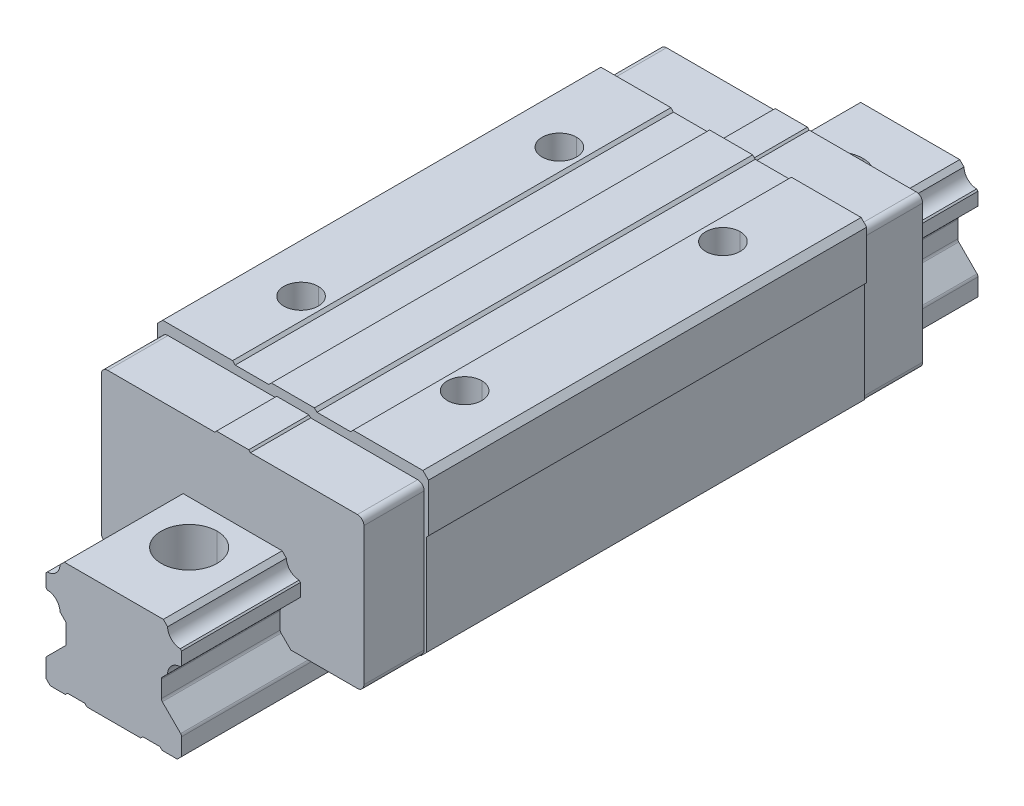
ISO-10303-21;
HEADER;
FILE_DESCRIPTION(('STEP AP214'),'2;1');
FILE_NAME('part.step','',(''),(''),'','','');
FILE_SCHEMA(('AUTOMOTIVE_DESIGN { 1 0 10303 214 1 1 1 1 }'));
ENDSEC;
DATA;
#1=APPLICATION_CONTEXT('core data for automotive mechanical design processes');
#2=APPLICATION_PROTOCOL_DEFINITION('international standard','automotive_design',2000,#1);
#3=PRODUCT_CONTEXT('',#1,'mechanical');
#4=PRODUCT('Part','Part','',(#3));
#5=PRODUCT_RELATED_PRODUCT_CATEGORY('part','',(#4));
#6=PRODUCT_DEFINITION_FORMATION('','',#4);
#7=PRODUCT_DEFINITION_CONTEXT('part definition',#1,'design');
#8=PRODUCT_DEFINITION('design','',#6,#7);
#9=PRODUCT_DEFINITION_SHAPE('','',#8);
#10=(LENGTH_UNIT() NAMED_UNIT(*) SI_UNIT(.MILLI.,.METRE.));
#11=(NAMED_UNIT(*) PLANE_ANGLE_UNIT() SI_UNIT($,.RADIAN.));
#12=(NAMED_UNIT(*) SI_UNIT($,.STERADIAN.) SOLID_ANGLE_UNIT());
#13=UNCERTAINTY_MEASURE_WITH_UNIT(LENGTH_MEASURE(1.E-05),#10,'distance_accuracy_value','');
#14=(GEOMETRIC_REPRESENTATION_CONTEXT(3) GLOBAL_UNCERTAINTY_ASSIGNED_CONTEXT((#13)) GLOBAL_UNIT_ASSIGNED_CONTEXT((#10,
#11,#12)) REPRESENTATION_CONTEXT('',''));
#15=CARTESIAN_POINT('',(0.,0.,0.));
#16=DIRECTION('',(0.,0.,1.));
#17=DIRECTION('',(1.,0.,0.));
#18=AXIS2_PLACEMENT_3D('',#15,#16,#17);
#19=CARTESIAN_POINT('',(-38.,37.,-60.));
#20=DIRECTION('',(0.,1.,0.));
#21=DIRECTION('',(0.,0.,1.));
#22=AXIS2_PLACEMENT_3D('',#19,#20,#21);
#23=CYLINDRICAL_SURFACE('',#22,8.);
#24=CARTESIAN_POINT('',(-38.,17.,-60.));
#25=DIRECTION('',(0.,1.,0.));
#26=DIRECTION('',(0.,0.,1.));
#27=AXIS2_PLACEMENT_3D('',#24,#25,#26);
#28=CIRCLE('',#27,8.);
#29=CARTESIAN_POINT('',(-38.,17.,-68.));
#30=VERTEX_POINT('',#29);
#31=CARTESIAN_POINT('',(-38.,17.,-52.));
#32=VERTEX_POINT('',#31);
#33=EDGE_CURVE('P0_E725',#30,#32,#28,.T.);
#34=ORIENTED_EDGE('',*,*,#33,.F.);
#35=DIRECTION('',(0.,1.,0.));
#36=VECTOR('',#35,1.);
#37=CARTESIAN_POINT('',(-38.,37.,-68.));
#38=LINE('',#37,#36);
#39=CARTESIAN_POINT('',(-38.,37.,-68.));
#40=VERTEX_POINT('',#39);
#41=EDGE_CURVE('P0_E887',#30,#40,#38,.T.);
#42=ORIENTED_EDGE('',*,*,#41,.T.);
#43=CARTESIAN_POINT('',(-38.,37.,-60.));
#44=DIRECTION('',(0.,-1.,0.));
#45=DIRECTION('',(0.,0.,1.));
#46=AXIS2_PLACEMENT_3D('',#43,#44,#45);
#47=CIRCLE('',#46,8.);
#48=CARTESIAN_POINT('',(-38.,37.,-52.));
#49=VERTEX_POINT('',#48);
#50=EDGE_CURVE('P0_E816',#49,#40,#47,.T.);
#51=ORIENTED_EDGE('',*,*,#50,.F.);
#52=DIRECTION('',(0.,1.,0.));
#53=VECTOR('',#52,1.);
#54=CARTESIAN_POINT('',(-38.,37.,-52.));
#55=LINE('',#54,#53);
#56=EDGE_CURVE('P0_E882',#32,#49,#55,.T.);
#57=ORIENTED_EDGE('',*,*,#56,.F.);
#58=EDGE_LOOP('',(#34,#42,#51,#57));
#59=FACE_BOUND('',#58,.T.);
#60=ADVANCED_FACE('P0_F17',(#59),#23,.F.);
#61=CARTESIAN_POINT('',(-38.,37.,60.));
#62=DIRECTION('',(0.,1.,0.));
#63=DIRECTION('',(0.,0.,1.));
#64=AXIS2_PLACEMENT_3D('',#61,#62,#63);
#65=CYLINDRICAL_SURFACE('',#64,8.);
#66=CARTESIAN_POINT('',(-38.,17.,60.));
#67=DIRECTION('',(0.,1.,0.));
#68=DIRECTION('',(0.,0.,1.));
#69=AXIS2_PLACEMENT_3D('',#66,#67,#68);
#70=CIRCLE('',#69,8.);
#71=CARTESIAN_POINT('',(-38.,17.,52.));
#72=VERTEX_POINT('',#71);
#73=CARTESIAN_POINT('',(-38.,17.,68.));
#74=VERTEX_POINT('',#73);
#75=EDGE_CURVE('P0_E2132',#72,#74,#70,.T.);
#76=ORIENTED_EDGE('',*,*,#75,.F.);
#77=DIRECTION('',(0.,1.,0.));
#78=VECTOR('',#77,1.);
#79=CARTESIAN_POINT('',(-38.,37.,52.));
#80=LINE('',#79,#78);
#81=CARTESIAN_POINT('',(-38.,37.,52.));
#82=VERTEX_POINT('',#81);
#83=EDGE_CURVE('P0_E935',#72,#82,#80,.T.);
#84=ORIENTED_EDGE('',*,*,#83,.T.);
#85=CARTESIAN_POINT('',(-38.,37.,60.));
#86=DIRECTION('',(0.,-1.,0.));
#87=DIRECTION('',(0.,0.,1.));
#88=AXIS2_PLACEMENT_3D('',#85,#86,#87);
#89=CIRCLE('',#88,8.);
#90=CARTESIAN_POINT('',(-38.,37.,68.));
#91=VERTEX_POINT('',#90);
#92=EDGE_CURVE('P0_E820',#91,#82,#89,.T.);
#93=ORIENTED_EDGE('',*,*,#92,.F.);
#94=DIRECTION('',(0.,1.,0.));
#95=VECTOR('',#94,1.);
#96=CARTESIAN_POINT('',(-38.,37.,68.));
#97=LINE('',#96,#95);
#98=EDGE_CURVE('P0_E946',#74,#91,#97,.T.);
#99=ORIENTED_EDGE('',*,*,#98,.F.);
#100=EDGE_LOOP('',(#76,#84,#93,#99));
#101=FACE_BOUND('',#100,.T.);
#102=ADVANCED_FACE('P0_F3125',(#101),#65,.F.);
#103=CARTESIAN_POINT('',(38.,37.,-60.));
#104=DIRECTION('',(0.,1.,0.));
#105=DIRECTION('',(0.,0.,1.));
#106=AXIS2_PLACEMENT_3D('',#103,#104,#105);
#107=CYLINDRICAL_SURFACE('',#106,8.);
#108=CARTESIAN_POINT('',(38.,17.,-60.));
#109=DIRECTION('',(0.,1.,0.));
#110=DIRECTION('',(0.,0.,1.));
#111=AXIS2_PLACEMENT_3D('',#108,#109,#110);
#112=CIRCLE('',#111,8.);
#113=CARTESIAN_POINT('',(38.,17.,-68.));
#114=VERTEX_POINT('',#113);
#115=CARTESIAN_POINT('',(38.,17.,-52.));
#116=VERTEX_POINT('',#115);
#117=EDGE_CURVE('P0_E2150',#114,#116,#112,.T.);
#118=ORIENTED_EDGE('',*,*,#117,.F.);
#119=DIRECTION('',(0.,1.,0.));
#120=VECTOR('',#119,1.);
#121=CARTESIAN_POINT('',(38.,37.,-68.));
#122=LINE('',#121,#120);
#123=CARTESIAN_POINT('',(38.,37.,-68.));
#124=VERTEX_POINT('',#123);
#125=EDGE_CURVE('P0_E761',#114,#124,#122,.T.);
#126=ORIENTED_EDGE('',*,*,#125,.T.);
#127=CARTESIAN_POINT('',(38.,37.,-60.));
#128=DIRECTION('',(0.,-1.,0.));
#129=DIRECTION('',(0.,0.,1.));
#130=AXIS2_PLACEMENT_3D('',#127,#128,#129);
#131=CIRCLE('',#130,8.);
#132=CARTESIAN_POINT('',(38.,37.,-52.));
#133=VERTEX_POINT('',#132);
#134=EDGE_CURVE('P0_E846',#133,#124,#131,.T.);
#135=ORIENTED_EDGE('',*,*,#134,.F.);
#136=DIRECTION('',(0.,1.,0.));
#137=VECTOR('',#136,1.);
#138=CARTESIAN_POINT('',(38.,37.,-52.));
#139=LINE('',#138,#137);
#140=EDGE_CURVE('P0_E765',#116,#133,#139,.T.);
#141=ORIENTED_EDGE('',*,*,#140,.F.);
#142=EDGE_LOOP('',(#118,#126,#135,#141));
#143=FACE_BOUND('',#142,.T.);
#144=ADVANCED_FACE('P0_F3129',(#143),#107,.F.);
#145=CARTESIAN_POINT('',(38.,37.,60.));
#146=DIRECTION('',(0.,1.,0.));
#147=DIRECTION('',(0.,0.,1.));
#148=AXIS2_PLACEMENT_3D('',#145,#146,#147);
#149=CYLINDRICAL_SURFACE('',#148,8.);
#150=CARTESIAN_POINT('',(38.,17.,60.));
#151=DIRECTION('',(0.,1.,0.));
#152=DIRECTION('',(0.,0.,1.));
#153=AXIS2_PLACEMENT_3D('',#150,#151,#152);
#154=CIRCLE('',#153,8.);
#155=CARTESIAN_POINT('',(38.,17.,52.));
#156=VERTEX_POINT('',#155);
#157=CARTESIAN_POINT('',(38.,17.,68.));
#158=VERTEX_POINT('',#157);
#159=EDGE_CURVE('P0_E2167',#156,#158,#154,.T.);
#160=ORIENTED_EDGE('',*,*,#159,.F.);
#161=DIRECTION('',(0.,1.,0.));
#162=VECTOR('',#161,1.);
#163=CARTESIAN_POINT('',(38.,37.,52.));
#164=LINE('',#163,#162);
#165=CARTESIAN_POINT('',(38.,37.,52.));
#166=VERTEX_POINT('',#165);
#167=EDGE_CURVE('P0_E738',#156,#166,#164,.T.);
#168=ORIENTED_EDGE('',*,*,#167,.T.);
#169=CARTESIAN_POINT('',(38.,37.,60.));
#170=DIRECTION('',(0.,-1.,0.));
#171=DIRECTION('',(0.,0.,1.));
#172=AXIS2_PLACEMENT_3D('',#169,#170,#171);
#173=CIRCLE('',#172,8.);
#174=CARTESIAN_POINT('',(38.,37.,68.));
#175=VERTEX_POINT('',#174);
#176=EDGE_CURVE('P0_E843',#175,#166,#173,.T.);
#177=ORIENTED_EDGE('',*,*,#176,.F.);
#178=DIRECTION('',(0.,1.,0.));
#179=VECTOR('',#178,1.);
#180=CARTESIAN_POINT('',(38.,37.,68.));
#181=LINE('',#180,#179);
#182=EDGE_CURVE('P0_E749',#158,#175,#181,.T.);
#183=ORIENTED_EDGE('',*,*,#182,.F.);
#184=EDGE_LOOP('',(#160,#168,#177,#183));
#185=FACE_BOUND('',#184,.T.);
#186=ADVANCED_FACE('P0_F4027',(#185),#149,.F.);
#187=CARTESIAN_POINT('',(0.,0.,129.8));
#188=DIRECTION('',(0.,0.,1.));
#189=DIRECTION('',(1.,0.,0.));
#190=AXIS2_PLACEMENT_3D('',#187,#188,#189);
#191=PLANE('',#190);
#192=DIRECTION('',(0.707106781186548,0.707106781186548,0.));
#193=VECTOR('',#192,1.);
#194=CARTESIAN_POINT('',(-7.516069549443,32.88061017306,129.8));
#195=LINE('',#194,#193);
#196=CARTESIAN_POINT('',(-8.316069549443,32.08061017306,129.8));
#197=VERTEX_POINT('',#196);
#198=CARTESIAN_POINT('',(-7.516069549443,32.88061017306,129.8));
#199=VERTEX_POINT('',#198);
#200=EDGE_CURVE('P0_E744',#197,#199,#195,.T.);
#201=ORIENTED_EDGE('',*,*,#200,.F.);
#202=DIRECTION('',(-1.,0.,0.));
#203=VECTOR('',#202,1.);
#204=CARTESIAN_POINT('',(0.,32.08061017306,129.8));
#205=LINE('',#204,#203);
#206=CARTESIAN_POINT('',(-58.01602084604,32.08061017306,129.8));
#207=VERTEX_POINT('',#206);
#208=EDGE_CURVE('P0_E1194',#197,#207,#205,.T.);
#209=ORIENTED_EDGE('',*,*,#208,.T.);
#210=CARTESIAN_POINT('',(-58.01602084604,29.08061017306,129.8));
#211=DIRECTION('',(0.,0.,1.));
#212=DIRECTION('',(1.,0.,0.));
#213=AXIS2_PLACEMENT_3D('',#210,#211,#212);
#214=CIRCLE('',#213,3.);
#215=CARTESIAN_POINT('',(-61.01602084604,29.08061017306,129.8));
#216=VERTEX_POINT('',#215);
#217=EDGE_CURVE('P0_E1342',#207,#216,#214,.T.);
#218=ORIENTED_EDGE('',*,*,#217,.T.);
#219=DIRECTION('',(0.,-1.,0.));
#220=VECTOR('',#219,1.);
#221=CARTESIAN_POINT('',(-61.01602084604,0.,129.8));
#222=LINE('',#221,#220);
#223=CARTESIAN_POINT('',(-61.01602084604,-34.91938982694,129.8));
#224=VERTEX_POINT('',#223);
#225=EDGE_CURVE('P0_E870',#216,#224,#222,.T.);
#226=ORIENTED_EDGE('',*,*,#225,.T.);
#227=CARTESIAN_POINT('',(-58.01602084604,-34.91938982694,129.8));
#228=DIRECTION('',(0.,0.,1.));
#229=DIRECTION('',(1.,0.,0.));
#230=AXIS2_PLACEMENT_3D('',#227,#228,#229);
#231=CIRCLE('',#230,3.);
#232=CARTESIAN_POINT('',(-58.01602084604,-37.91938982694,129.8));
#233=VERTEX_POINT('',#232);
#234=EDGE_CURVE('P0_E1355',#224,#233,#231,.T.);
#235=ORIENTED_EDGE('',*,*,#234,.T.);
#236=DIRECTION('',(0.999999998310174,5.81347815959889E-05,0.));
#237=VECTOR('',#236,1.);
#238=CARTESIAN_POINT('',(-58.01602084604,-37.91938982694,129.8));
#239=LINE('',#238,#237);
#240=CARTESIAN_POINT('',(-27.0590115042,-37.91759014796,129.8));
#241=VERTEX_POINT('',#240);
#242=EDGE_CURVE('P0_E1362',#233,#241,#239,.T.);
#243=ORIENTED_EDGE('',*,*,#242,.T.);
#244=DIRECTION('',(0.707106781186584,0.707106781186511,0.));
#245=VECTOR('',#244,1.);
#246=CARTESIAN_POINT('',(-27.0590115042,-37.91759014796,129.8));
#247=LINE('',#246,#245);
#248=CARTESIAN_POINT('',(-22.5393398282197,-33.3979184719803,129.8));
#249=VERTEX_POINT('',#248);
#250=EDGE_CURVE('P0_E1406',#241,#249,#247,.T.);
#251=ORIENTED_EDGE('',*,*,#250,.T.);
#252=CARTESIAN_POINT('',(-23.6,-32.3372583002,129.8));
#253=DIRECTION('',(0.,0.,-1.));
#254=DIRECTION('',(1.,0.,0.));
#255=AXIS2_PLACEMENT_3D('',#252,#253,#254);
#256=CIRCLE('',#255,1.5);
#257=CARTESIAN_POINT('',(-22.1,-32.3372583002,129.8));
#258=VERTEX_POINT('',#257);
#259=EDGE_CURVE('P0_E1215',#258,#249,#256,.T.);
#260=ORIENTED_EDGE('',*,*,#259,.F.);
#261=DIRECTION('',(0.,1.,0.));
#262=VECTOR('',#261,1.);
#263=CARTESIAN_POINT('',(-22.1,0.,129.8));
#264=LINE('',#263,#262);
#265=CARTESIAN_POINT('',(-22.0999999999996,-24.52132234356,129.8));
#266=VERTEX_POINT('',#265);
#267=EDGE_CURVE('P0_E1412',#258,#266,#264,.T.);
#268=ORIENTED_EDGE('',*,*,#267,.T.);
#269=CARTESIAN_POINT('',(-23.6,-24.52132234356,129.8));
#270=DIRECTION('',(0.,0.,-1.));
#271=DIRECTION('',(1.,0.,0.));
#272=AXIS2_PLACEMENT_3D('',#269,#270,#271);
#273=CIRCLE('',#272,1.5);
#274=CARTESIAN_POINT('',(-22.5393398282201,-23.46066217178,129.8));
#275=VERTEX_POINT('',#274);
#276=EDGE_CURVE('P0_E869',#275,#266,#273,.T.);
#277=ORIENTED_EDGE('',*,*,#276,.F.);
#278=DIRECTION('',(-0.707106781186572,0.707106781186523,0.));
#279=VECTOR('',#278,1.);
#280=CARTESIAN_POINT('',(-22.53933982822,-23.46066217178,129.8));
#281=LINE('',#280,#279);
#282=CARTESIAN_POINT('',(-24.9911078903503,-21.0088941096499,129.8));
#283=VERTEX_POINT('',#282);
#284=EDGE_CURVE('P0_E1423',#275,#283,#281,.T.);
#285=ORIENTED_EDGE('',*,*,#284,.T.);
#286=CARTESIAN_POINT('',(-30.99002214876,-21.12303314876,129.8));
#287=DIRECTION('',(0.,0.,1.));
#288=DIRECTION('',(1.,0.,0.));
#289=AXIS2_PLACEMENT_3D('',#286,#287,#288);
#290=CIRCLE('',#289,6.);
#291=CARTESIAN_POINT('',(-30.8758831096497,-15.1241188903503,129.8));
#292=VERTEX_POINT('',#291);
#293=EDGE_CURVE('P0_E1430',#283,#292,#290,.T.);
#294=ORIENTED_EDGE('',*,*,#293,.T.);
#295=DIRECTION('',(0.707106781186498,-0.707106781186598,0.));
#296=VECTOR('',#295,1.);
#297=CARTESIAN_POINT('',(-30.87588310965,-15.12411889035,129.8));
#298=LINE('',#297,#296);
#299=CARTESIAN_POINT('',(-31.5,-14.5000019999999,129.8));
#300=VERTEX_POINT('',#299);
#301=EDGE_CURVE('P0_E776',#300,#292,#298,.T.);
#302=ORIENTED_EDGE('',*,*,#301,.F.);
#303=DIRECTION('',(0.,1.,0.));
#304=VECTOR('',#303,1.);
#305=CARTESIAN_POINT('',(-31.5,0.,129.8));
#306=LINE('',#305,#304);
#307=CARTESIAN_POINT('',(-31.5,-8.49996941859,129.8));
#308=VERTEX_POINT('',#307);
#309=EDGE_CURVE('P0_E1436',#300,#308,#306,.T.);
#310=ORIENTED_EDGE('',*,*,#309,.T.);
#311=DIRECTION('',(-0.707106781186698,-0.707106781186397,0.));
#312=VECTOR('',#311,1.);
#313=CARTESIAN_POINT('',(-31.5,-8.49996941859,129.8));
#314=LINE('',#313,#312);
#315=CARTESIAN_POINT('',(-30.8749172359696,-7.87488665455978,129.8));
#316=VERTEX_POINT('',#315);
#317=EDGE_CURVE('P0_E1164',#316,#308,#314,.T.);
#318=ORIENTED_EDGE('',*,*,#317,.F.);
#319=CARTESIAN_POINT('',(-30.99002214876,-1.875990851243,129.8));
#320=DIRECTION('',(0.,0.,1.));
#321=DIRECTION('',(1.,0.,0.));
#322=AXIS2_PLACEMENT_3D('',#319,#320,#321);
#323=CIRCLE('',#322,6.);
#324=CARTESIAN_POINT('',(-24.9911263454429,-1.99109576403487,129.8));
#325=VERTEX_POINT('',#324);
#326=EDGE_CURVE('P0_E1447',#316,#325,#323,.T.);
#327=ORIENTED_EDGE('',*,*,#326,.T.);
#328=DIRECTION('',(-0.707106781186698,-0.707106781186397,0.));
#329=VECTOR('',#328,1.);
#330=CARTESIAN_POINT('',(-24.99112634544,-1.991095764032,129.8));
#331=LINE('',#330,#329);
#332=CARTESIAN_POINT('',(-23.0000305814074,1.1368109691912E-13,129.8));
#333=VERTEX_POINT('',#332);
#334=EDGE_CURVE('P0_E1458',#333,#325,#331,.T.);
#335=ORIENTED_EDGE('',*,*,#334,.F.);
#336=DIRECTION('',(-1.,0.,0.));
#337=VECTOR('',#336,1.);
#338=CARTESIAN_POINT('',(-23.00003058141,1.137E-13,129.8));
#339=LINE('',#338,#337);
#340=CARTESIAN_POINT('',(23.0000305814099,1.1476529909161E-13,129.8));
#341=VERTEX_POINT('',#340);
#342=EDGE_CURVE('P0_E10',#341,#333,#339,.T.);
#343=ORIENTED_EDGE('',*,*,#342,.F.);
#344=DIRECTION('',(-0.707106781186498,0.707106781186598,0.));
#345=VECTOR('',#344,1.);
#346=CARTESIAN_POINT('',(23.00003058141,-1.137E-13,129.8));
#347=LINE('',#346,#345);
#348=CARTESIAN_POINT('',(24.991126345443,-1.9910957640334,129.8));
#349=VERTEX_POINT('',#348);
#350=EDGE_CURVE('P0_E69',#349,#341,#347,.T.);
#351=ORIENTED_EDGE('',*,*,#350,.F.);
#352=CARTESIAN_POINT('',(30.99002214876,-1.875990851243,129.8));
#353=DIRECTION('',(0.,0.,1.));
#354=DIRECTION('',(1.,0.,0.));
#355=AXIS2_PLACEMENT_3D('',#352,#353,#354);
#356=CIRCLE('',#355,6.);
#357=CARTESIAN_POINT('',(30.8749172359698,-7.87488665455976,129.8));
#358=VERTEX_POINT('',#357);
#359=EDGE_CURVE('P0_E756',#349,#358,#356,.T.);
#360=ORIENTED_EDGE('',*,*,#359,.T.);
#361=DIRECTION('',(-0.707106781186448,0.707106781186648,0.));
#362=VECTOR('',#361,1.);
#363=CARTESIAN_POINT('',(30.87491723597,-7.87488665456,129.8));
#364=LINE('',#363,#362);
#365=CARTESIAN_POINT('',(31.5,-8.49996941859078,129.8));
#366=VERTEX_POINT('',#365);
#367=EDGE_CURVE('P0_E1026',#366,#358,#364,.T.);
#368=ORIENTED_EDGE('',*,*,#367,.F.);
#369=DIRECTION('',(0.,-1.,0.));
#370=VECTOR('',#369,1.);
#371=CARTESIAN_POINT('',(31.5,0.,129.8));
#372=LINE('',#371,#370);
#373=CARTESIAN_POINT('',(31.5,-14.50000199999,129.8));
#374=VERTEX_POINT('',#373);
#375=EDGE_CURVE('P0_E1134',#366,#374,#372,.T.);
#376=ORIENTED_EDGE('',*,*,#375,.T.);
#377=DIRECTION('',(0.707106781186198,0.707106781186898,0.));
#378=VECTOR('',#377,1.);
#379=CARTESIAN_POINT('',(31.5,-14.50000199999,129.8));
#380=LINE('',#379,#378);
#381=CARTESIAN_POINT('',(30.8758831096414,-15.1241188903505,129.8));
#382=VERTEX_POINT('',#381);
#383=EDGE_CURVE('P0_E804',#382,#374,#380,.T.);
#384=ORIENTED_EDGE('',*,*,#383,.F.);
#385=CARTESIAN_POINT('',(30.99002214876,-21.12303314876,129.8));
#386=DIRECTION('',(0.,0.,1.));
#387=DIRECTION('',(1.,0.,0.));
#388=AXIS2_PLACEMENT_3D('',#385,#386,#387);
#389=CIRCLE('',#388,6.);
#390=CARTESIAN_POINT('',(24.9911078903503,-21.0088941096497,129.8));
#391=VERTEX_POINT('',#390);
#392=EDGE_CURVE('P0_E1462',#382,#391,#389,.T.);
#393=ORIENTED_EDGE('',*,*,#392,.T.);
#394=DIRECTION('',(-0.707106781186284,-0.707106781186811,0.));
#395=VECTOR('',#394,1.);
#396=CARTESIAN_POINT('',(24.9911078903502,-21.0088941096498,129.8));
#397=LINE('',#396,#395);
#398=CARTESIAN_POINT('',(22.5393398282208,-23.4606621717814,129.8));
#399=VERTEX_POINT('',#398);
#400=EDGE_CURVE('P0_E1352',#391,#399,#397,.T.);
#401=ORIENTED_EDGE('',*,*,#400,.T.);
#402=CARTESIAN_POINT('',(23.6,-24.52132234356,129.8));
#403=DIRECTION('',(0.,0.,-1.));
#404=DIRECTION('',(1.,0.,0.));
#405=AXIS2_PLACEMENT_3D('',#402,#403,#404);
#406=CIRCLE('',#405,1.5);
#407=CARTESIAN_POINT('',(22.1,-24.52132234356,129.8));
#408=VERTEX_POINT('',#407);
#409=EDGE_CURVE('P0_E1238',#408,#399,#406,.T.);
#410=ORIENTED_EDGE('',*,*,#409,.F.);
#411=DIRECTION('',(0.,-1.,0.));
#412=VECTOR('',#411,1.);
#413=CARTESIAN_POINT('',(22.1,0.,129.8));
#414=LINE('',#413,#412);
#415=CARTESIAN_POINT('',(22.1,-32.3372583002,129.8));
#416=VERTEX_POINT('',#415);
#417=EDGE_CURVE('P0_E1351',#408,#416,#414,.T.);
#418=ORIENTED_EDGE('',*,*,#417,.T.);
#419=CARTESIAN_POINT('',(23.6,-32.3372583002,129.8));
#420=DIRECTION('',(0.,0.,-1.));
#421=DIRECTION('',(1.,0.,0.));
#422=AXIS2_PLACEMENT_3D('',#419,#420,#421);
#423=CIRCLE('',#422,1.5);
#424=CARTESIAN_POINT('',(22.53933982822,-33.39791847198,129.8));
#425=VERTEX_POINT('',#424);
#426=EDGE_CURVE('P0_E1254',#425,#416,#423,.T.);
#427=ORIENTED_EDGE('',*,*,#426,.F.);
#428=DIRECTION('',(0.707106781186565,-0.70710678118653,0.));
#429=VECTOR('',#428,1.);
#430=CARTESIAN_POINT('',(22.53933982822,-33.39791847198,129.8));
#431=LINE('',#430,#429);
#432=CARTESIAN_POINT('',(27.0590134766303,-37.9175921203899,129.8));
#433=VERTEX_POINT('',#432);
#434=EDGE_CURVE('P0_E1473',#425,#433,#431,.T.);
#435=ORIENTED_EDGE('',*,*,#434,.T.);
#436=DIRECTION('',(0.99999999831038,-5.81312382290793E-05,0.));
#437=VECTOR('',#436,1.);
#438=CARTESIAN_POINT('',(27.0590134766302,-37.9175921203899,129.8));
#439=LINE('',#438,#437);
#440=CARTESIAN_POINT('',(57.98397915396,-37.91938982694,129.8));
#441=VERTEX_POINT('',#440);
#442=EDGE_CURVE('P0_E735',#433,#441,#439,.T.);
#443=ORIENTED_EDGE('',*,*,#442,.T.);
#444=CARTESIAN_POINT('',(57.98397915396,-34.91938982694,129.8));
#445=DIRECTION('',(0.,0.,1.));
#446=DIRECTION('',(1.,0.,0.));
#447=AXIS2_PLACEMENT_3D('',#444,#445,#446);
#448=CIRCLE('',#447,3.);
#449=CARTESIAN_POINT('',(60.98397915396,-34.91938982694,129.8));
#450=VERTEX_POINT('',#449);
#451=EDGE_CURVE('P0_E1376',#441,#450,#448,.T.);
#452=ORIENTED_EDGE('',*,*,#451,.T.);
#453=DIRECTION('',(0.,1.,0.));
#454=VECTOR('',#453,1.);
#455=CARTESIAN_POINT('',(60.98397915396,0.,129.8));
#456=LINE('',#455,#454);
#457=CARTESIAN_POINT('',(60.98397915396,29.08061017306,129.8));
#458=VERTEX_POINT('',#457);
#459=EDGE_CURVE('P0_E1168',#450,#458,#456,.T.);
#460=ORIENTED_EDGE('',*,*,#459,.T.);
#461=CARTESIAN_POINT('',(57.98397915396,29.08061017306,129.8));
#462=DIRECTION('',(0.,0.,1.));
#463=DIRECTION('',(1.,0.,0.));
#464=AXIS2_PLACEMENT_3D('',#461,#462,#463);
#465=CIRCLE('',#464,3.);
#466=CARTESIAN_POINT('',(57.98397915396,32.08061017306,129.8));
#467=VERTEX_POINT('',#466);
#468=EDGE_CURVE('P0_E1047',#458,#467,#465,.T.);
#469=ORIENTED_EDGE('',*,*,#468,.T.);
#470=DIRECTION('',(-1.,0.,0.));
#471=VECTOR('',#470,1.);
#472=CARTESIAN_POINT('',(0.,32.08061017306,129.8));
#473=LINE('',#472,#471);
#474=CARTESIAN_POINT('',(8.283930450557,32.08061017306,129.8));
#475=VERTEX_POINT('',#474);
#476=EDGE_CURVE('P0_E1043',#467,#475,#473,.T.);
#477=ORIENTED_EDGE('',*,*,#476,.T.);
#478=DIRECTION('',(0.707106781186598,-0.707106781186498,0.));
#479=VECTOR('',#478,1.);
#480=CARTESIAN_POINT('',(8.283930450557,32.08061017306,129.8));
#481=LINE('',#480,#479);
#482=CARTESIAN_POINT('',(7.48393045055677,32.88061017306,129.8));
#483=VERTEX_POINT('',#482);
#484=EDGE_CURVE('P0_E982',#483,#475,#481,.T.);
#485=ORIENTED_EDGE('',*,*,#484,.F.);
#486=DIRECTION('',(-1.,0.,0.));
#487=VECTOR('',#486,1.);
#488=CARTESIAN_POINT('',(0.,32.88061017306,129.8));
#489=LINE('',#488,#487);
#490=EDGE_CURVE('P0_E1046',#483,#199,#489,.T.);
#491=ORIENTED_EDGE('',*,*,#490,.T.);
#492=EDGE_LOOP('',(#201,#209,#218,#226,#235,#243,#251,#260,#268,#277,#285,#294,#302,#310,#318,
#327,#335,#343,#351,#360,#368,#376,#384,#393,#401,#410,#418,#427,#435,#443,#452,#460,#469,#477,
#485,#491));
#493=FACE_BOUND('',#492,.T.);
#494=ADVANCED_FACE('P0_F1551',(#493),#191,.T.);
#495=CARTESIAN_POINT('',(-23.00003058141,1.137E-13,-101.8));
#496=DIRECTION('',(0.,-1.,0.));
#497=DIRECTION('',(0.,0.,-1.));
#498=AXIS2_PLACEMENT_3D('',#495,#496,#497);
#499=PLANE('',#498);
#500=DIRECTION('',(1.,0.,0.));
#501=VECTOR('',#500,1.);
#502=CARTESIAN_POINT('',(-23.00003058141,1.137E-13,-129.8));
#503=LINE('',#502,#501);
#504=CARTESIAN_POINT('',(-23.000030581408,0.,-129.8));
#505=VERTEX_POINT('',#504);
#506=CARTESIAN_POINT('',(23.00003058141,0.,-129.8));
#507=VERTEX_POINT('',#506);
#508=EDGE_CURVE('P0_E62',#505,#507,#503,.T.);
#509=ORIENTED_EDGE('',*,*,#508,.T.);
#510=DIRECTION('',(0.,0.,1.));
#511=VECTOR('',#510,1.);
#512=CARTESIAN_POINT('',(23.0000305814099,1.137E-13,-101.8));
#513=LINE('',#512,#511);
#514=EDGE_CURVE('P0_E20',#507,#341,#513,.T.);
#515=ORIENTED_EDGE('',*,*,#514,.T.);
#516=ORIENTED_EDGE('',*,*,#342,.T.);
#517=DIRECTION('',(0.,0.,-1.));
#518=VECTOR('',#517,1.);
#519=CARTESIAN_POINT('',(-23.0000305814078,1.137E-13,-101.8));
#520=LINE('',#519,#518);
#521=EDGE_CURVE('P0_E1528',#333,#505,#520,.T.);
#522=ORIENTED_EDGE('',*,*,#521,.T.);
#523=EDGE_LOOP('',(#509,#515,#516,#522));
#524=FACE_BOUND('',#523,.T.);
#525=ADVANCED_FACE('P0_F1537',(#524),#499,.T.);
#526=CARTESIAN_POINT('',(23.00003058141,-1.137E-13,-101.8));
#527=DIRECTION('',(-0.707106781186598,-0.707106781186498,0.));
#528=DIRECTION('',(-0.707106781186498,0.707106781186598,0.));
#529=AXIS2_PLACEMENT_3D('',#526,#527,#528);
#530=PLANE('',#529);
#531=DIRECTION('',(0.707106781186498,-0.707106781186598,0.));
#532=VECTOR('',#531,1.);
#533=CARTESIAN_POINT('',(23.00003058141,-1.137E-13,-129.8));
#534=LINE('',#533,#532);
#535=CARTESIAN_POINT('',(24.991126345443,-1.9910957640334,-129.8));
#536=VERTEX_POINT('',#535);
#537=EDGE_CURVE('P0_E75',#507,#536,#534,.T.);
#538=ORIENTED_EDGE('',*,*,#537,.T.);
#539=DIRECTION('',(0.,0.,1.));
#540=VECTOR('',#539,1.);
#541=CARTESIAN_POINT('',(24.9911263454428,-1.99109576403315,-101.8));
#542=LINE('',#541,#540);
#543=EDGE_CURVE('P0_E759',#536,#349,#542,.T.);
#544=ORIENTED_EDGE('',*,*,#543,.T.);
#545=ORIENTED_EDGE('',*,*,#350,.T.);
#546=ORIENTED_EDGE('',*,*,#514,.F.);
#547=EDGE_LOOP('',(#538,#544,#545,#546));
#548=FACE_BOUND('',#547,.T.);
#549=ADVANCED_FACE('P0_F3996',(#548),#530,.T.);
#550=CARTESIAN_POINT('',(0.,0.,-129.8));
#551=DIRECTION('',(0.,0.,1.));
#552=DIRECTION('',(1.,0.,0.));
#553=AXIS2_PLACEMENT_3D('',#550,#551,#552);
#554=PLANE('',#553);
#555=DIRECTION('',(-1.,0.,0.));
#556=VECTOR('',#555,1.);
#557=CARTESIAN_POINT('',(0.,32.08061017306,-129.8));
#558=LINE('',#557,#556);
#559=CARTESIAN_POINT('',(-8.316069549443,32.08061017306,-129.8));
#560=VERTEX_POINT('',#559);
#561=CARTESIAN_POINT('',(-58.01602084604,32.08061017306,-129.8));
#562=VERTEX_POINT('',#561);
#563=EDGE_CURVE('P0_E785',#560,#562,#558,.T.);
#564=ORIENTED_EDGE('',*,*,#563,.F.);
#565=DIRECTION('',(0.707106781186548,0.707106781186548,0.));
#566=VECTOR('',#565,1.);
#567=CARTESIAN_POINT('',(-7.516069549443,32.88061017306,-129.8));
#568=LINE('',#567,#566);
#569=CARTESIAN_POINT('',(-7.516069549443,32.88061017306,-129.8));
#570=VERTEX_POINT('',#569);
#571=EDGE_CURVE('P0_E831',#560,#570,#568,.T.);
#572=ORIENTED_EDGE('',*,*,#571,.T.);
#573=DIRECTION('',(-1.,0.,0.));
#574=VECTOR('',#573,1.);
#575=CARTESIAN_POINT('',(0.,32.8806101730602,-129.8));
#576=LINE('',#575,#574);
#577=CARTESIAN_POINT('',(7.48393045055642,32.8806101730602,-129.8));
#578=VERTEX_POINT('',#577);
#579=EDGE_CURVE('P0_E782',#578,#570,#576,.T.);
#580=ORIENTED_EDGE('',*,*,#579,.F.);
#581=DIRECTION('',(0.707106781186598,-0.707106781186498,0.));
#582=VECTOR('',#581,1.);
#583=CARTESIAN_POINT('',(8.283930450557,32.08061017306,-129.8));
#584=LINE('',#583,#582);
#585=CARTESIAN_POINT('',(8.283930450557,32.08061017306,-129.8));
#586=VERTEX_POINT('',#585);
#587=EDGE_CURVE('P0_E1276',#578,#586,#584,.T.);
#588=ORIENTED_EDGE('',*,*,#587,.T.);
#589=DIRECTION('',(-1.,0.,0.));
#590=VECTOR('',#589,1.);
#591=CARTESIAN_POINT('',(0.,32.08061017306,-129.8));
#592=LINE('',#591,#590);
#593=CARTESIAN_POINT('',(57.98397915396,32.08061017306,-129.8));
#594=VERTEX_POINT('',#593);
#595=EDGE_CURVE('P0_E786',#594,#586,#592,.T.);
#596=ORIENTED_EDGE('',*,*,#595,.F.);
#597=CARTESIAN_POINT('',(57.98397915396,29.08061017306,-129.8));
#598=DIRECTION('',(0.,0.,1.));
#599=DIRECTION('',(1.,0.,0.));
#600=AXIS2_PLACEMENT_3D('',#597,#598,#599);
#601=CIRCLE('',#600,3.);
#602=CARTESIAN_POINT('',(60.98397915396,29.08061017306,-129.8));
#603=VERTEX_POINT('',#602);
#604=EDGE_CURVE('P0_E1509',#603,#594,#601,.T.);
#605=ORIENTED_EDGE('',*,*,#604,.F.);
#606=DIRECTION('',(0.,1.,0.));
#607=VECTOR('',#606,1.);
#608=CARTESIAN_POINT('',(60.98397915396,0.,-129.8));
#609=LINE('',#608,#607);
#610=CARTESIAN_POINT('',(60.98397915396,-34.91938982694,-129.8));
#611=VERTEX_POINT('',#610);
#612=EDGE_CURVE('P0_E1498',#611,#603,#609,.T.);
#613=ORIENTED_EDGE('',*,*,#612,.F.);
#614=CARTESIAN_POINT('',(57.98397915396,-34.91938982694,-129.8));
#615=DIRECTION('',(0.,0.,1.));
#616=DIRECTION('',(1.,0.,0.));
#617=AXIS2_PLACEMENT_3D('',#614,#615,#616);
#618=CIRCLE('',#617,3.);
#619=CARTESIAN_POINT('',(57.98397915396,-37.91938982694,-129.8));
#620=VERTEX_POINT('',#619);
#621=EDGE_CURVE('P0_E1494',#620,#611,#618,.T.);
#622=ORIENTED_EDGE('',*,*,#621,.F.);
#623=DIRECTION('',(0.99999999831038,-5.81312382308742E-05,0.));
#624=VECTOR('',#623,1.);
#625=CARTESIAN_POINT('',(27.0590134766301,-37.9175921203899,-129.8));
#626=LINE('',#625,#624);
#627=CARTESIAN_POINT('',(27.0590134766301,-37.9175921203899,-129.8));
#628=VERTEX_POINT('',#627);
#629=EDGE_CURVE('P0_E1483',#628,#620,#626,.T.);
#630=ORIENTED_EDGE('',*,*,#629,.F.);
#631=DIRECTION('',(0.707106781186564,-0.707106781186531,0.));
#632=VECTOR('',#631,1.);
#633=CARTESIAN_POINT('',(22.53933982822,-33.39791847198,-129.8));
#634=LINE('',#633,#632);
#635=CARTESIAN_POINT('',(22.53933982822,-33.39791847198,-129.8));
#636=VERTEX_POINT('',#635);
#637=EDGE_CURVE('P0_E1476',#636,#628,#634,.T.);
#638=ORIENTED_EDGE('',*,*,#637,.F.);
#639=CARTESIAN_POINT('',(23.6,-32.3372583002,-129.8));
#640=DIRECTION('',(0.,0.,1.));
#641=DIRECTION('',(1.,0.,0.));
#642=AXIS2_PLACEMENT_3D('',#639,#640,#641);
#643=CIRCLE('',#642,1.5);
#644=CARTESIAN_POINT('',(22.1,-32.3372583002,-129.8));
#645=VERTEX_POINT('',#644);
#646=EDGE_CURVE('P0_E1246',#645,#636,#643,.T.);
#647=ORIENTED_EDGE('',*,*,#646,.F.);
#648=DIRECTION('',(0.,-1.,0.));
#649=VECTOR('',#648,1.);
#650=CARTESIAN_POINT('',(22.1,0.,-129.8));
#651=LINE('',#650,#649);
#652=CARTESIAN_POINT('',(22.1,-24.52132234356,-129.8));
#653=VERTEX_POINT('',#652);
#654=EDGE_CURVE('P0_E1348',#653,#645,#651,.T.);
#655=ORIENTED_EDGE('',*,*,#654,.F.);
#656=CARTESIAN_POINT('',(23.6,-24.52132234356,-129.8));
#657=DIRECTION('',(0.,0.,1.));
#658=DIRECTION('',(1.,0.,0.));
#659=AXIS2_PLACEMENT_3D('',#656,#657,#658);
#660=CIRCLE('',#659,1.5);
#661=CARTESIAN_POINT('',(22.5393398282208,-23.4606621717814,-129.8));
#662=VERTEX_POINT('',#661);
#663=EDGE_CURVE('P0_E1155',#662,#653,#660,.T.);
#664=ORIENTED_EDGE('',*,*,#663,.F.);
#665=DIRECTION('',(-0.707106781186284,-0.707106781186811,0.));
#666=VECTOR('',#665,1.);
#667=CARTESIAN_POINT('',(24.9911078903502,-21.0088941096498,-129.8));
#668=LINE('',#667,#666);
#669=CARTESIAN_POINT('',(24.9911078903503,-21.0088941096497,-129.8));
#670=VERTEX_POINT('',#669);
#671=EDGE_CURVE('P0_E1466',#670,#662,#668,.T.);
#672=ORIENTED_EDGE('',*,*,#671,.F.);
#673=CARTESIAN_POINT('',(30.99002214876,-21.12303314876,-129.8));
#674=DIRECTION('',(0.,0.,1.));
#675=DIRECTION('',(1.,0.,0.));
#676=AXIS2_PLACEMENT_3D('',#673,#674,#675);
#677=CIRCLE('',#676,6.);
#678=CARTESIAN_POINT('',(30.8758831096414,-15.1241188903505,-129.8));
#679=VERTEX_POINT('',#678);
#680=EDGE_CURVE('P0_E1129',#679,#670,#677,.T.);
#681=ORIENTED_EDGE('',*,*,#680,.F.);
#682=DIRECTION('',(-0.707106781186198,-0.707106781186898,0.));
#683=VECTOR('',#682,1.);
#684=CARTESIAN_POINT('',(31.5,-14.50000199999,-129.8));
#685=LINE('',#684,#683);
#686=CARTESIAN_POINT('',(31.5,-14.5000019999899,-129.8));
#687=VERTEX_POINT('',#686);
#688=EDGE_CURVE('P0_E805',#687,#679,#685,.T.);
#689=ORIENTED_EDGE('',*,*,#688,.F.);
#690=DIRECTION('',(0.,-1.,0.));
#691=VECTOR('',#690,1.);
#692=CARTESIAN_POINT('',(31.5000000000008,0.,-129.8));
#693=LINE('',#692,#691);
#694=CARTESIAN_POINT('',(31.5000000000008,-8.49996941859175,-129.8));
#695=VERTEX_POINT('',#694);
#696=EDGE_CURVE('P0_E1451',#695,#687,#693,.T.);
#697=ORIENTED_EDGE('',*,*,#696,.F.);
#698=DIRECTION('',(0.707106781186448,-0.707106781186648,0.));
#699=VECTOR('',#698,1.);
#700=CARTESIAN_POINT('',(30.87491723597,-7.87488665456,-129.8));
#701=LINE('',#700,#699);
#702=CARTESIAN_POINT('',(30.8749172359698,-7.87488665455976,-129.8));
#703=VERTEX_POINT('',#702);
#704=EDGE_CURVE('P0_E1027',#703,#695,#701,.T.);
#705=ORIENTED_EDGE('',*,*,#704,.F.);
#706=CARTESIAN_POINT('',(30.99002214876,-1.875990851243,-129.8));
#707=DIRECTION('',(0.,0.,1.));
#708=DIRECTION('',(1.,0.,0.));
#709=AXIS2_PLACEMENT_3D('',#706,#707,#708);
#710=CIRCLE('',#709,6.);
#711=EDGE_CURVE('P0_E760',#536,#703,#710,.T.);
#712=ORIENTED_EDGE('',*,*,#711,.F.);
#713=ORIENTED_EDGE('',*,*,#537,.F.);
#714=ORIENTED_EDGE('',*,*,#508,.F.);
#715=DIRECTION('',(0.707106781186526,0.707106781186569,0.));
#716=VECTOR('',#715,1.);
#717=CARTESIAN_POINT('',(-24.9911263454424,-1.99109576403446,-129.8));
#718=LINE('',#717,#716);
#719=CARTESIAN_POINT('',(-24.9911263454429,-1.99109576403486,-129.8));
#720=VERTEX_POINT('',#719);
#721=EDGE_CURVE('P0_E1524',#720,#505,#718,.T.);
#722=ORIENTED_EDGE('',*,*,#721,.F.);
#723=CARTESIAN_POINT('',(-30.99002214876,-1.875990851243,-129.8));
#724=DIRECTION('',(0.,0.,1.));
#725=DIRECTION('',(1.,0.,0.));
#726=AXIS2_PLACEMENT_3D('',#723,#724,#725);
#727=CIRCLE('',#726,6.);
#728=CARTESIAN_POINT('',(-30.8749172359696,-7.87488665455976,-129.8));
#729=VERTEX_POINT('',#728);
#730=EDGE_CURVE('P0_E1439',#729,#720,#727,.T.);
#731=ORIENTED_EDGE('',*,*,#730,.F.);
#732=DIRECTION('',(0.707106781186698,0.707106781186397,0.));
#733=VECTOR('',#732,1.);
#734=CARTESIAN_POINT('',(-31.5,-8.49996941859,-129.8));
#735=LINE('',#734,#733);
#736=CARTESIAN_POINT('',(-31.5,-8.49996941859,-129.8));
#737=VERTEX_POINT('',#736);
#738=EDGE_CURVE('P0_E1088',#737,#729,#735,.T.);
#739=ORIENTED_EDGE('',*,*,#738,.F.);
#740=DIRECTION('',(0.,1.,0.));
#741=VECTOR('',#740,1.);
#742=CARTESIAN_POINT('',(-31.5,0.,-129.8));
#743=LINE('',#742,#741);
#744=CARTESIAN_POINT('',(-31.5,-14.5000019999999,-129.8));
#745=VERTEX_POINT('',#744);
#746=EDGE_CURVE('P0_E1433',#745,#737,#743,.T.);
#747=ORIENTED_EDGE('',*,*,#746,.F.);
#748=DIRECTION('',(-0.707106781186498,0.707106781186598,0.));
#749=VECTOR('',#748,1.);
#750=CARTESIAN_POINT('',(-30.87588310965,-15.12411889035,-129.8));
#751=LINE('',#750,#749);
#752=CARTESIAN_POINT('',(-30.8758831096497,-15.1241188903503,-129.8));
#753=VERTEX_POINT('',#752);
#754=EDGE_CURVE('P0_E868',#753,#745,#751,.T.);
#755=ORIENTED_EDGE('',*,*,#754,.F.);
#756=CARTESIAN_POINT('',(-30.99002214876,-21.12303314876,-129.8));
#757=DIRECTION('',(0.,0.,1.));
#758=DIRECTION('',(1.,0.,0.));
#759=AXIS2_PLACEMENT_3D('',#756,#757,#758);
#760=CIRCLE('',#759,6.);
#761=CARTESIAN_POINT('',(-24.9911078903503,-21.0088941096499,-129.8));
#762=VERTEX_POINT('',#761);
#763=EDGE_CURVE('P0_E1427',#762,#753,#760,.T.);
#764=ORIENTED_EDGE('',*,*,#763,.F.);
#765=DIRECTION('',(-0.707106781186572,0.707106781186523,0.));
#766=VECTOR('',#765,1.);
#767=CARTESIAN_POINT('',(-22.53933982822,-23.46066217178,-129.8));
#768=LINE('',#767,#766);
#769=CARTESIAN_POINT('',(-22.5393398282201,-23.46066217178,-129.8));
#770=VERTEX_POINT('',#769);
#771=EDGE_CURVE('P0_E1415',#770,#762,#768,.T.);
#772=ORIENTED_EDGE('',*,*,#771,.F.);
#773=CARTESIAN_POINT('',(-23.6,-24.52132234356,-129.8));
#774=DIRECTION('',(0.,0.,1.));
#775=DIRECTION('',(1.,0.,0.));
#776=AXIS2_PLACEMENT_3D('',#773,#774,#775);
#777=CIRCLE('',#776,1.5);
#778=CARTESIAN_POINT('',(-22.0999999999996,-24.52132234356,-129.8));
#779=VERTEX_POINT('',#778);
#780=EDGE_CURVE('P0_E1013',#779,#770,#777,.T.);
#781=ORIENTED_EDGE('',*,*,#780,.F.);
#782=DIRECTION('',(0.,1.,0.));
#783=VECTOR('',#782,1.);
#784=CARTESIAN_POINT('',(-22.1,0.,-129.8));
#785=LINE('',#784,#783);
#786=CARTESIAN_POINT('',(-22.1,-32.3372583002,-129.8));
#787=VERTEX_POINT('',#786);
#788=EDGE_CURVE('P0_E1409',#787,#779,#785,.T.);
#789=ORIENTED_EDGE('',*,*,#788,.F.);
#790=CARTESIAN_POINT('',(-23.6,-32.3372583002,-129.8));
#791=DIRECTION('',(0.,0.,1.));
#792=DIRECTION('',(1.,0.,0.));
#793=AXIS2_PLACEMENT_3D('',#790,#791,#792);
#794=CIRCLE('',#793,1.5);
#795=CARTESIAN_POINT('',(-22.5393398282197,-33.3979184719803,-129.8));
#796=VERTEX_POINT('',#795);
#797=EDGE_CURVE('P0_E1144',#796,#787,#794,.T.);
#798=ORIENTED_EDGE('',*,*,#797,.F.);
#799=DIRECTION('',(0.707106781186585,0.70710678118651,0.));
#800=VECTOR('',#799,1.);
#801=CARTESIAN_POINT('',(-27.0590115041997,-37.9175901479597,-129.8));
#802=LINE('',#801,#800);
#803=CARTESIAN_POINT('',(-27.0590115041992,-37.9175901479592,-129.8));
#804=VERTEX_POINT('',#803);
#805=EDGE_CURVE('P0_E1403',#804,#796,#802,.T.);
#806=ORIENTED_EDGE('',*,*,#805,.F.);
#807=DIRECTION('',(0.999999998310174,5.81347816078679E-05,0.));
#808=VECTOR('',#807,1.);
#809=CARTESIAN_POINT('',(-58.01602084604,-37.91938982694,-129.8));
#810=LINE('',#809,#808);
#811=CARTESIAN_POINT('',(-58.01602084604,-37.91938982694,-129.8));
#812=VERTEX_POINT('',#811);
#813=EDGE_CURVE('P0_E825',#812,#804,#810,.T.);
#814=ORIENTED_EDGE('',*,*,#813,.F.);
#815=CARTESIAN_POINT('',(-58.01602084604,-34.91938982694,-129.8));
#816=DIRECTION('',(0.,0.,1.));
#817=DIRECTION('',(1.,0.,0.));
#818=AXIS2_PLACEMENT_3D('',#815,#816,#817);
#819=CIRCLE('',#818,3.);
#820=CARTESIAN_POINT('',(-61.01602084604,-34.91938982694,-129.8));
#821=VERTEX_POINT('',#820);
#822=EDGE_CURVE('P0_E821',#821,#812,#819,.T.);
#823=ORIENTED_EDGE('',*,*,#822,.F.);
#824=DIRECTION('',(0.,-1.,0.));
#825=VECTOR('',#824,1.);
#826=CARTESIAN_POINT('',(-61.01602084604,0.,-129.8));
#827=LINE('',#826,#825);
#828=CARTESIAN_POINT('',(-61.01602084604,29.08061017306,-129.8));
#829=VERTEX_POINT('',#828);
#830=EDGE_CURVE('P0_E1193',#829,#821,#827,.T.);
#831=ORIENTED_EDGE('',*,*,#830,.F.);
#832=CARTESIAN_POINT('',(-58.01602084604,29.08061017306,-129.8));
#833=DIRECTION('',(0.,0.,1.));
#834=DIRECTION('',(1.,0.,0.));
#835=AXIS2_PLACEMENT_3D('',#832,#833,#834);
#836=CIRCLE('',#835,3.);
#837=EDGE_CURVE('P0_E1060',#562,#829,#836,.T.);
#838=ORIENTED_EDGE('',*,*,#837,.F.);
#839=EDGE_LOOP('',(#564,#572,#580,#588,#596,#605,#613,#622,#630,#638,#647,#655,#664,#672,#681,
#689,#697,#705,#712,#713,#714,#722,#731,#739,#747,#755,#764,#772,#781,#789,#798,#806,#814,#823,
#831,#838));
#840=FACE_BOUND('',#839,.T.);
#841=ADVANCED_FACE('P0_F1540',(#840),#554,.F.);
#842=CARTESIAN_POINT('',(-24.99112634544,-1.991095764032,-101.8));
#843=DIRECTION('',(0.707106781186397,-0.707106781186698,0.));
#844=DIRECTION('',(0.,0.,-1.));
#845=AXIS2_PLACEMENT_3D('',#842,#843,#844);
#846=PLANE('',#845);
#847=ORIENTED_EDGE('',*,*,#721,.T.);
#848=ORIENTED_EDGE('',*,*,#521,.F.);
#849=ORIENTED_EDGE('',*,*,#334,.T.);
#850=DIRECTION('',(0.,0.,-1.));
#851=VECTOR('',#850,1.);
#852=CARTESIAN_POINT('',(-24.9911263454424,-1.99109576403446,-101.8));
#853=LINE('',#852,#851);
#854=EDGE_CURVE('P0_E1443',#325,#720,#853,.T.);
#855=ORIENTED_EDGE('',*,*,#854,.T.);
#856=EDGE_LOOP('',(#847,#848,#849,#855));
#857=FACE_BOUND('',#856,.T.);
#858=ADVANCED_FACE('P0_F3940',(#857),#846,.T.);
#859=CARTESIAN_POINT('',(30.99002214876,-1.875990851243,-101.8));
#860=DIRECTION('',(0.,0.,1.));
#861=DIRECTION('',(1.,0.,0.));
#862=AXIS2_PLACEMENT_3D('',#859,#860,#861);
#863=CYLINDRICAL_SURFACE('',#862,6.);
#864=ORIENTED_EDGE('',*,*,#711,.T.);
#865=DIRECTION('',(0.,0.,1.));
#866=VECTOR('',#865,1.);
#867=CARTESIAN_POINT('',(30.8749172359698,-7.87488665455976,-101.8));
#868=LINE('',#867,#866);
#869=EDGE_CURVE('P0_E1083',#703,#358,#868,.T.);
#870=ORIENTED_EDGE('',*,*,#869,.T.);
#871=ORIENTED_EDGE('',*,*,#359,.F.);
#872=ORIENTED_EDGE('',*,*,#543,.F.);
#873=EDGE_LOOP('',(#864,#870,#871,#872));
#874=FACE_BOUND('',#873,.T.);
#875=ADVANCED_FACE('P0_F1544',(#874),#863,.T.);
#876=CARTESIAN_POINT('',(-58.01602084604,29.08061017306,-101.8));
#877=DIRECTION('',(0.,0.,1.));
#878=DIRECTION('',(1.,0.,0.));
#879=AXIS2_PLACEMENT_3D('',#876,#877,#878);
#880=CYLINDRICAL_SURFACE('',#879,3.);
#881=DIRECTION('',(0.,0.,1.));
#882=VECTOR('',#881,1.);
#883=CARTESIAN_POINT('',(-61.01602084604,29.08061017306,-101.8));
#884=LINE('',#883,#882);
#885=CARTESIAN_POINT('',(-61.01602084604,29.08061017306,-101.8));
#886=VERTEX_POINT('',#885);
#887=EDGE_CURVE('P0_E1190',#829,#886,#884,.T.);
#888=ORIENTED_EDGE('',*,*,#887,.T.);
#889=CARTESIAN_POINT('',(-58.01602084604,29.08061017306,-101.8));
#890=DIRECTION('',(0.,0.,-1.));
#891=DIRECTION('',(1.,0.,0.));
#892=AXIS2_PLACEMENT_3D('',#889,#890,#891);
#893=CIRCLE('',#892,3.);
#894=CARTESIAN_POINT('',(-58.01602084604,32.08061017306,-101.8));
#895=VERTEX_POINT('',#894);
#896=EDGE_CURVE('P0_E1320',#886,#895,#893,.T.);
#897=ORIENTED_EDGE('',*,*,#896,.T.);
#898=DIRECTION('',(0.,0.,-1.));
#899=VECTOR('',#898,1.);
#900=CARTESIAN_POINT('',(-58.01602084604,32.08061017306,-101.8));
#901=LINE('',#900,#899);
#902=EDGE_CURVE('P0_E1056',#895,#562,#901,.T.);
#903=ORIENTED_EDGE('',*,*,#902,.T.);
#904=ORIENTED_EDGE('',*,*,#837,.T.);
#905=EDGE_LOOP('',(#888,#897,#903,#904));
#906=FACE_BOUND('',#905,.T.);
#907=ADVANCED_FACE('P0_F3939',(#906),#880,.T.);
#908=CARTESIAN_POINT('',(-8.316069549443,32.08061017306,-101.8));
#909=DIRECTION('',(0.,-1.,0.));
#910=DIRECTION('',(0.,0.,-1.));
#911=AXIS2_PLACEMENT_3D('',#908,#909,#910);
#912=PLANE('',#911);
#913=DIRECTION('',(-1.,0.,0.));
#914=VECTOR('',#913,1.);
#915=CARTESIAN_POINT('',(-8.316069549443,32.08061017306,-101.8));
#916=LINE('',#915,#914);
#917=CARTESIAN_POINT('',(-8.316069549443,32.08061017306,-101.8));
#918=VERTEX_POINT('',#917);
#919=EDGE_CURVE('P0_E1316',#918,#895,#916,.T.);
#920=ORIENTED_EDGE('',*,*,#919,.F.);
#921=DIRECTION('',(0.,0.,1.));
#922=VECTOR('',#921,1.);
#923=CARTESIAN_POINT('',(-8.316069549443,32.08061017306,-101.8));
#924=LINE('',#923,#922);
#925=EDGE_CURVE('P0_E835',#560,#918,#924,.T.);
#926=ORIENTED_EDGE('',*,*,#925,.F.);
#927=ORIENTED_EDGE('',*,*,#563,.T.);
#928=ORIENTED_EDGE('',*,*,#902,.F.);
#929=EDGE_LOOP('',(#920,#926,#927,#928));
#930=FACE_BOUND('',#929,.T.);
#931=ADVANCED_FACE('P0_F3951',(#930),#912,.F.);
#932=CARTESIAN_POINT('',(7.483930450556,32.88061017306,-101.8));
#933=DIRECTION('',(0.,-1.,0.));
#934=DIRECTION('',(0.,0.,-1.));
#935=AXIS2_PLACEMENT_3D('',#932,#933,#934);
#936=PLANE('',#935);
#937=DIRECTION('',(-1.,0.,0.));
#938=VECTOR('',#937,1.);
#939=CARTESIAN_POINT('',(7.483930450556,32.88061017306,-101.8));
#940=LINE('',#939,#938);
#941=CARTESIAN_POINT('',(7.48393045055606,32.8806101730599,-101.8));
#942=VERTEX_POINT('',#941);
#943=CARTESIAN_POINT('',(-7.516069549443,32.88061017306,-101.8));
#944=VERTEX_POINT('',#943);
#945=EDGE_CURVE('P0_E1313',#942,#944,#940,.T.);
#946=ORIENTED_EDGE('',*,*,#945,.F.);
#947=DIRECTION('',(0.,0.,1.));
#948=VECTOR('',#947,1.);
#949=CARTESIAN_POINT('',(7.48393045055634,32.88061017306,-101.8));
#950=LINE('',#949,#948);
#951=EDGE_CURVE('P0_E1280',#578,#942,#950,.T.);
#952=ORIENTED_EDGE('',*,*,#951,.F.);
#953=ORIENTED_EDGE('',*,*,#579,.T.);
#954=DIRECTION('',(0.,0.,-1.));
#955=VECTOR('',#954,1.);
#956=CARTESIAN_POINT('',(-7.516069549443,32.88061017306,-101.8));
#957=LINE('',#956,#955);
#958=EDGE_CURVE('P0_E836',#944,#570,#957,.T.);
#959=ORIENTED_EDGE('',*,*,#958,.F.);
#960=EDGE_LOOP('',(#946,#952,#953,#959));
#961=FACE_BOUND('',#960,.T.);
#962=ADVANCED_FACE('P0_F3258',(#961),#936,.F.);
#963=CARTESIAN_POINT('',(57.98397915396,32.08061017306,-101.8));
#964=DIRECTION('',(0.,-1.,0.));
#965=DIRECTION('',(0.,0.,-1.));
#966=AXIS2_PLACEMENT_3D('',#963,#964,#965);
#967=PLANE('',#966);
#968=DIRECTION('',(-1.,0.,0.));
#969=VECTOR('',#968,1.);
#970=CARTESIAN_POINT('',(57.98397915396,32.08061017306,-101.8));
#971=LINE('',#970,#969);
#972=CARTESIAN_POINT('',(57.98397915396,32.08061017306,-101.8));
#973=VERTEX_POINT('',#972);
#974=CARTESIAN_POINT('',(8.283930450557,32.08061017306,-101.8));
#975=VERTEX_POINT('',#974);
#976=EDGE_CURVE('P0_E1310',#973,#975,#971,.T.);
#977=ORIENTED_EDGE('',*,*,#976,.F.);
#978=DIRECTION('',(0.,0.,1.));
#979=VECTOR('',#978,1.);
#980=CARTESIAN_POINT('',(57.98397915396,32.08061017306,-101.8));
#981=LINE('',#980,#979);
#982=EDGE_CURVE('P0_E1506',#594,#973,#981,.T.);
#983=ORIENTED_EDGE('',*,*,#982,.F.);
#984=ORIENTED_EDGE('',*,*,#595,.T.);
#985=DIRECTION('',(0.,0.,-1.));
#986=VECTOR('',#985,1.);
#987=CARTESIAN_POINT('',(8.283930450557,32.08061017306,-101.8));
#988=LINE('',#987,#986);
#989=EDGE_CURVE('P0_E1272',#975,#586,#988,.T.);
#990=ORIENTED_EDGE('',*,*,#989,.F.);
#991=EDGE_LOOP('',(#977,#983,#984,#990));
#992=FACE_BOUND('',#991,.T.);
#993=ADVANCED_FACE('P0_F3253',(#992),#967,.F.);
#994=CARTESIAN_POINT('',(57.98397915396,29.08061017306,-101.8));
#995=DIRECTION('',(0.,0.,1.));
#996=DIRECTION('',(1.,0.,0.));
#997=AXIS2_PLACEMENT_3D('',#994,#995,#996);
#998=CYLINDRICAL_SURFACE('',#997,3.);
#999=ORIENTED_EDGE('',*,*,#982,.T.);
#1000=CARTESIAN_POINT('',(57.98397915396,29.08061017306,-101.8));
#1001=DIRECTION('',(0.,0.,-1.));
#1002=DIRECTION('',(1.,0.,0.));
#1003=AXIS2_PLACEMENT_3D('',#1000,#1001,#1002);
#1004=CIRCLE('',#1003,3.);
#1005=CARTESIAN_POINT('',(60.98397915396,29.08061017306,-101.8));
#1006=VERTEX_POINT('',#1005);
#1007=EDGE_CURVE('P0_E1306',#973,#1006,#1004,.T.);
#1008=ORIENTED_EDGE('',*,*,#1007,.T.);
#1009=DIRECTION('',(0.,0.,-1.));
#1010=VECTOR('',#1009,1.);
#1011=CARTESIAN_POINT('',(60.98397915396,29.08061017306,-101.8));
#1012=LINE('',#1011,#1010);
#1013=EDGE_CURVE('P0_E1502',#1006,#603,#1012,.T.);
#1014=ORIENTED_EDGE('',*,*,#1013,.T.);
#1015=ORIENTED_EDGE('',*,*,#604,.T.);
#1016=EDGE_LOOP('',(#999,#1008,#1014,#1015));
#1017=FACE_BOUND('',#1016,.T.);
#1018=ADVANCED_FACE('P0_F3257',(#1017),#998,.T.);
#1019=CARTESIAN_POINT('',(60.98397915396,-34.91938982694,-101.8));
#1020=DIRECTION('',(-1.,0.,0.));
#1021=DIRECTION('',(0.,0.,1.));
#1022=AXIS2_PLACEMENT_3D('',#1019,#1020,#1021);
#1023=PLANE('',#1022);
#1024=DIRECTION('',(0.,1.,0.));
#1025=VECTOR('',#1024,1.);
#1026=CARTESIAN_POINT('',(60.98397915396,-34.91938982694,-101.8));
#1027=LINE('',#1026,#1025);
#1028=CARTESIAN_POINT('',(60.98397915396,-34.91938982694,-101.8));
#1029=VERTEX_POINT('',#1028);
#1030=EDGE_CURVE('P0_E1305',#1029,#1006,#1027,.T.);
#1031=ORIENTED_EDGE('',*,*,#1030,.F.);
#1032=DIRECTION('',(0.,0.,1.));
#1033=VECTOR('',#1032,1.);
#1034=CARTESIAN_POINT('',(60.98397915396,-34.91938982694,-101.8));
#1035=LINE('',#1034,#1033);
#1036=EDGE_CURVE('P0_E1491',#611,#1029,#1035,.T.);
#1037=ORIENTED_EDGE('',*,*,#1036,.F.);
#1038=ORIENTED_EDGE('',*,*,#612,.T.);
#1039=ORIENTED_EDGE('',*,*,#1013,.F.);
#1040=EDGE_LOOP('',(#1031,#1037,#1038,#1039));
#1041=FACE_BOUND('',#1040,.T.);
#1042=ADVANCED_FACE('P0_F3318',(#1041),#1023,.F.);
#1043=CARTESIAN_POINT('',(57.98397915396,-34.91938982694,-101.8));
#1044=DIRECTION('',(0.,0.,1.));
#1045=DIRECTION('',(1.,0.,0.));
#1046=AXIS2_PLACEMENT_3D('',#1043,#1044,#1045);
#1047=CYLINDRICAL_SURFACE('',#1046,3.);
#1048=ORIENTED_EDGE('',*,*,#1036,.T.);
#1049=CARTESIAN_POINT('',(57.98397915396,-34.91938982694,-101.8));
#1050=DIRECTION('',(0.,0.,-1.));
#1051=DIRECTION('',(1.,0.,0.));
#1052=AXIS2_PLACEMENT_3D('',#1049,#1050,#1051);
#1053=CIRCLE('',#1052,3.);
#1054=CARTESIAN_POINT('',(57.98397915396,-37.9193898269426,-101.8));
#1055=VERTEX_POINT('',#1054);
#1056=EDGE_CURVE('P0_E1301',#1029,#1055,#1053,.T.);
#1057=ORIENTED_EDGE('',*,*,#1056,.T.);
#1058=DIRECTION('',(0.,0.,-1.));
#1059=VECTOR('',#1058,1.);
#1060=CARTESIAN_POINT('',(57.98397915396,-37.91938982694,-101.8));
#1061=LINE('',#1060,#1059);
#1062=EDGE_CURVE('P0_E1487',#1055,#620,#1061,.T.);
#1063=ORIENTED_EDGE('',*,*,#1062,.T.);
#1064=ORIENTED_EDGE('',*,*,#621,.T.);
#1065=EDGE_LOOP('',(#1048,#1057,#1063,#1064));
#1066=FACE_BOUND('',#1065,.T.);
#1067=ADVANCED_FACE('P0_F3313',(#1066),#1047,.T.);
#1068=CARTESIAN_POINT('',(27.05901347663,-37.91759212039,-101.8));
#1069=DIRECTION('',(5.81312383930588E-05,0.99999999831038,0.));
#1070=DIRECTION('',(0.,0.,-1.));
#1071=AXIS2_PLACEMENT_3D('',#1068,#1069,#1070);
#1072=PLANE('',#1071);
#1073=DIRECTION('',(0.99999999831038,-5.81312383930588E-05,0.));
#1074=VECTOR('',#1073,1.);
#1075=CARTESIAN_POINT('',(27.05901347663,-37.91759212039,-101.8));
#1076=LINE('',#1075,#1074);
#1077=CARTESIAN_POINT('',(27.0590134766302,-37.9175921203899,-101.8));
#1078=VERTEX_POINT('',#1077);
#1079=EDGE_CURVE('P0_E1297',#1078,#1055,#1076,.T.);
#1080=ORIENTED_EDGE('',*,*,#1079,.F.);
#1081=DIRECTION('',(0.,0.,1.));
#1082=VECTOR('',#1081,1.);
#1083=CARTESIAN_POINT('',(27.0590134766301,-37.91759212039,-101.8));
#1084=LINE('',#1083,#1082);
#1085=EDGE_CURVE('P0_E1480',#628,#1078,#1084,.T.);
#1086=ORIENTED_EDGE('',*,*,#1085,.F.);
#1087=ORIENTED_EDGE('',*,*,#629,.T.);
#1088=ORIENTED_EDGE('',*,*,#1062,.F.);
#1089=EDGE_LOOP('',(#1080,#1086,#1087,#1088));
#1090=FACE_BOUND('',#1089,.T.);
#1091=ADVANCED_FACE('P0_F3317',(#1090),#1072,.F.);
#1092=CARTESIAN_POINT('',(22.53933982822,-33.39791847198,-101.8));
#1093=DIRECTION('',(-0.707106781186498,-0.707106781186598,0.));
#1094=DIRECTION('',(-0.707106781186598,0.707106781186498,0.));
#1095=AXIS2_PLACEMENT_3D('',#1092,#1093,#1094);
#1096=PLANE('',#1095);
#1097=DIRECTION('',(0.,0.,1.));
#1098=VECTOR('',#1097,1.);
#1099=CARTESIAN_POINT('',(27.0590134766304,-37.9175921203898,-101.8));
#1100=LINE('',#1099,#1098);
#1101=CARTESIAN_POINT('',(27.0590134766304,-37.9175921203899,101.8));
#1102=VERTEX_POINT('',#1101);
#1103=EDGE_CURVE('P0_E1366',#1102,#433,#1100,.T.);
#1104=ORIENTED_EDGE('',*,*,#1103,.T.);
#1105=ORIENTED_EDGE('',*,*,#434,.F.);
#1106=DIRECTION('',(0.,0.,-1.));
#1107=VECTOR('',#1106,1.);
#1108=CARTESIAN_POINT('',(22.53933982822,-33.39791847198,-101.8));
#1109=LINE('',#1108,#1107);
#1110=EDGE_CURVE('P0_E1250',#425,#636,#1109,.T.);
#1111=ORIENTED_EDGE('',*,*,#1110,.T.);
#1112=ORIENTED_EDGE('',*,*,#637,.T.);
#1113=ORIENTED_EDGE('',*,*,#1085,.T.);
#1114=DIRECTION('',(0.707106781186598,-0.707106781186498,0.));
#1115=VECTOR('',#1114,1.);
#1116=CARTESIAN_POINT('',(22.53933982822,-33.39791847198,-101.8));
#1117=LINE('',#1116,#1115);
#1118=CARTESIAN_POINT('',(27.1404702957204,-37.9990489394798,-101.8));
#1119=VERTEX_POINT('',#1118);
#1120=EDGE_CURVE('P0_E1294',#1078,#1119,#1117,.T.);
#1121=ORIENTED_EDGE('',*,*,#1120,.T.);
#1122=DIRECTION('',(0.,0.,1.));
#1123=VECTOR('',#1122,1.);
#1124=CARTESIAN_POINT('',(27.1404702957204,-37.9990489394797,-101.8));
#1125=LINE('',#1124,#1123);
#1126=CARTESIAN_POINT('',(27.1404702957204,-37.9990489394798,101.8));
#1127=VERTEX_POINT('',#1126);
#1128=EDGE_CURVE('P0_E1262',#1119,#1127,#1125,.T.);
#1129=ORIENTED_EDGE('',*,*,#1128,.T.);
#1130=DIRECTION('',(0.707106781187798,-0.707106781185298,0.));
#1131=VECTOR('',#1130,1.);
#1132=CARTESIAN_POINT('',(27.0590134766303,-37.9175921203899,101.8));
#1133=LINE('',#1132,#1131);
#1134=EDGE_CURVE('P0_E837',#1102,#1127,#1133,.T.);
#1135=ORIENTED_EDGE('',*,*,#1134,.F.);
#1136=EDGE_LOOP('',(#1104,#1105,#1111,#1112,#1113,#1121,#1129,#1135));
#1137=FACE_BOUND('',#1136,.T.);
#1138=ADVANCED_FACE('P0_F1582',(#1137),#1096,.T.);
#1139=CARTESIAN_POINT('',(22.1,-24.52132234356,-101.8));
#1140=DIRECTION('',(-1.,0.,0.));
#1141=DIRECTION('',(0.,0.,1.));
#1142=AXIS2_PLACEMENT_3D('',#1139,#1140,#1141);
#1143=PLANE('',#1142);
#1144=ORIENTED_EDGE('',*,*,#654,.T.);
#1145=DIRECTION('',(0.,0.,1.));
#1146=VECTOR('',#1145,1.);
#1147=CARTESIAN_POINT('',(22.0999999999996,-32.3372583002,-101.8));
#1148=LINE('',#1147,#1146);
#1149=EDGE_CURVE('P0_E1258',#645,#416,#1148,.T.);
#1150=ORIENTED_EDGE('',*,*,#1149,.T.);
#1151=ORIENTED_EDGE('',*,*,#417,.F.);
#1152=DIRECTION('',(0.,0.,-1.));
#1153=VECTOR('',#1152,1.);
#1154=CARTESIAN_POINT('',(22.1,-24.52132234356,-101.8));
#1155=LINE('',#1154,#1153);
#1156=EDGE_CURVE('P0_E1234',#408,#653,#1155,.T.);
#1157=ORIENTED_EDGE('',*,*,#1156,.T.);
#1158=EDGE_LOOP('',(#1144,#1150,#1151,#1157));
#1159=FACE_BOUND('',#1158,.T.);
#1160=ADVANCED_FACE('P0_F1572',(#1159),#1143,.T.);
#1161=CARTESIAN_POINT('',(24.99110789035,-21.00889410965,-101.8));
#1162=DIRECTION('',(-0.707106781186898,0.707106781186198,0.));
#1163=DIRECTION('',(0.,0.,1.));
#1164=AXIS2_PLACEMENT_3D('',#1161,#1162,#1163);
#1165=PLANE('',#1164);
#1166=ORIENTED_EDGE('',*,*,#671,.T.);
#1167=DIRECTION('',(0.,0.,1.));
#1168=VECTOR('',#1167,1.);
#1169=CARTESIAN_POINT('',(22.5393398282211,-23.4606621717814,-101.8));
#1170=LINE('',#1169,#1168);
#1171=EDGE_CURVE('P0_E1242',#662,#399,#1170,.T.);
#1172=ORIENTED_EDGE('',*,*,#1171,.T.);
#1173=ORIENTED_EDGE('',*,*,#400,.F.);
#1174=DIRECTION('',(0.,0.,-1.));
#1175=VECTOR('',#1174,1.);
#1176=CARTESIAN_POINT('',(24.9911078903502,-21.0088941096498,-101.8));
#1177=LINE('',#1176,#1175);
#1178=EDGE_CURVE('P0_E1133',#391,#670,#1177,.T.);
#1179=ORIENTED_EDGE('',*,*,#1178,.T.);
#1180=EDGE_LOOP('',(#1166,#1172,#1173,#1179));
#1181=FACE_BOUND('',#1180,.T.);
#1182=ADVANCED_FACE('P0_F1567',(#1181),#1165,.T.);
#1183=CARTESIAN_POINT('',(30.99002214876,-21.12303314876,-101.8));
#1184=DIRECTION('',(0.,0.,1.));
#1185=DIRECTION('',(1.,0.,0.));
#1186=AXIS2_PLACEMENT_3D('',#1183,#1184,#1185);
#1187=CYLINDRICAL_SURFACE('',#1186,6.);
#1188=ORIENTED_EDGE('',*,*,#680,.T.);
#1189=ORIENTED_EDGE('',*,*,#1178,.F.);
#1190=ORIENTED_EDGE('',*,*,#392,.F.);
#1191=DIRECTION('',(0.,0.,-1.));
#1192=VECTOR('',#1191,1.);
#1193=CARTESIAN_POINT('',(30.8758831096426,-15.1241188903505,-101.8));
#1194=LINE('',#1193,#1192);
#1195=EDGE_CURVE('P0_E800',#382,#679,#1194,.T.);
#1196=ORIENTED_EDGE('',*,*,#1195,.T.);
#1197=EDGE_LOOP('',(#1188,#1189,#1190,#1196));
#1198=FACE_BOUND('',#1197,.T.);
#1199=ADVANCED_FACE('P0_F1561',(#1198),#1187,.T.);
#1200=CARTESIAN_POINT('',(31.5,-8.499969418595,-101.8));
#1201=DIRECTION('',(-1.,0.,0.));
#1202=DIRECTION('',(0.,0.,1.));
#1203=AXIS2_PLACEMENT_3D('',#1200,#1201,#1202);
#1204=PLANE('',#1203);
#1205=ORIENTED_EDGE('',*,*,#696,.T.);
#1206=DIRECTION('',(0.,0.,1.));
#1207=VECTOR('',#1206,1.);
#1208=CARTESIAN_POINT('',(31.4999999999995,-14.5000019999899,-101.8));
#1209=LINE('',#1208,#1207);
#1210=EDGE_CURVE('P0_E1051',#687,#374,#1209,.T.);
#1211=ORIENTED_EDGE('',*,*,#1210,.T.);
#1212=ORIENTED_EDGE('',*,*,#375,.F.);
#1213=DIRECTION('',(0.,0.,-1.));
#1214=VECTOR('',#1213,1.);
#1215=CARTESIAN_POINT('',(31.5,-8.49996941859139,-101.8));
#1216=LINE('',#1215,#1214);
#1217=EDGE_CURVE('P0_E1022',#366,#695,#1216,.T.);
#1218=ORIENTED_EDGE('',*,*,#1217,.T.);
#1219=EDGE_LOOP('',(#1205,#1211,#1212,#1218));
#1220=FACE_BOUND('',#1219,.T.);
#1221=ADVANCED_FACE('P0_F1556',(#1220),#1204,.T.);
#1222=CARTESIAN_POINT('',(-30.99002214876,-1.875990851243,-101.8));
#1223=DIRECTION('',(0.,0.,1.));
#1224=DIRECTION('',(1.,0.,0.));
#1225=AXIS2_PLACEMENT_3D('',#1222,#1223,#1224);
#1226=CYLINDRICAL_SURFACE('',#1225,6.);
#1227=ORIENTED_EDGE('',*,*,#730,.T.);
#1228=ORIENTED_EDGE('',*,*,#854,.F.);
#1229=ORIENTED_EDGE('',*,*,#326,.F.);
#1230=DIRECTION('',(0.,0.,-1.));
#1231=VECTOR('',#1230,1.);
#1232=CARTESIAN_POINT('',(-30.8749172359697,-7.87488665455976,-101.8));
#1233=LINE('',#1232,#1231);
#1234=EDGE_CURVE('P0_E1092',#316,#729,#1233,.T.);
#1235=ORIENTED_EDGE('',*,*,#1234,.T.);
#1236=EDGE_LOOP('',(#1227,#1228,#1229,#1235));
#1237=FACE_BOUND('',#1236,.T.);
#1238=ADVANCED_FACE('P0_F3806',(#1237),#1226,.T.);
#1239=CARTESIAN_POINT('',(-31.5,-14.500002,-101.8));
#1240=DIRECTION('',(1.,0.,0.));
#1241=DIRECTION('',(0.,1.,0.));
#1242=AXIS2_PLACEMENT_3D('',#1239,#1240,#1241);
#1243=PLANE('',#1242);
#1244=ORIENTED_EDGE('',*,*,#746,.T.);
#1245=DIRECTION('',(0.,0.,1.));
#1246=VECTOR('',#1245,1.);
#1247=CARTESIAN_POINT('',(-31.5,-8.49996941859,-101.8));
#1248=LINE('',#1247,#1246);
#1249=EDGE_CURVE('P0_E939',#737,#308,#1248,.T.);
#1250=ORIENTED_EDGE('',*,*,#1249,.T.);
#1251=ORIENTED_EDGE('',*,*,#309,.F.);
#1252=DIRECTION('',(0.,0.,-1.));
#1253=VECTOR('',#1252,1.);
#1254=CARTESIAN_POINT('',(-31.5,-14.5000019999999,-101.8));
#1255=LINE('',#1254,#1253);
#1256=EDGE_CURVE('P0_E781',#300,#745,#1255,.T.);
#1257=ORIENTED_EDGE('',*,*,#1256,.T.);
#1258=EDGE_LOOP('',(#1244,#1250,#1251,#1257));
#1259=FACE_BOUND('',#1258,.T.);
#1260=ADVANCED_FACE('P0_F3143',(#1259),#1243,.T.);
#1261=CARTESIAN_POINT('',(-30.99002214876,-21.12303314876,-101.8));
#1262=DIRECTION('',(0.,0.,1.));
#1263=DIRECTION('',(1.,0.,0.));
#1264=AXIS2_PLACEMENT_3D('',#1261,#1262,#1263);
#1265=CYLINDRICAL_SURFACE('',#1264,6.);
#1266=ORIENTED_EDGE('',*,*,#763,.T.);
#1267=DIRECTION('',(0.,0.,1.));
#1268=VECTOR('',#1267,1.);
#1269=CARTESIAN_POINT('',(-30.8758831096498,-15.1241188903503,-101.8));
#1270=LINE('',#1269,#1268);
#1271=EDGE_CURVE('P0_E780',#753,#292,#1270,.T.);
#1272=ORIENTED_EDGE('',*,*,#1271,.T.);
#1273=ORIENTED_EDGE('',*,*,#293,.F.);
#1274=DIRECTION('',(0.,0.,-1.));
#1275=VECTOR('',#1274,1.);
#1276=CARTESIAN_POINT('',(-24.9911078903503,-21.0088941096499,-101.8));
#1277=LINE('',#1276,#1275);
#1278=EDGE_CURVE('P0_E1419',#283,#762,#1277,.T.);
#1279=ORIENTED_EDGE('',*,*,#1278,.T.);
#1280=EDGE_LOOP('',(#1266,#1272,#1273,#1279));
#1281=FACE_BOUND('',#1280,.T.);
#1282=ADVANCED_FACE('P0_F3138',(#1281),#1265,.T.);
#1283=CARTESIAN_POINT('',(-22.53933982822,-23.46066217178,-101.8));
#1284=DIRECTION('',(0.707106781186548,0.707106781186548,0.));
#1285=DIRECTION('',(0.,0.,-1.));
#1286=AXIS2_PLACEMENT_3D('',#1283,#1284,#1285);
#1287=PLANE('',#1286);
#1288=ORIENTED_EDGE('',*,*,#771,.T.);
#1289=ORIENTED_EDGE('',*,*,#1278,.F.);
#1290=ORIENTED_EDGE('',*,*,#284,.F.);
#1291=DIRECTION('',(0.,0.,-1.));
#1292=VECTOR('',#1291,1.);
#1293=CARTESIAN_POINT('',(-22.53933982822,-23.46066217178,-101.8));
#1294=LINE('',#1293,#1292);
#1295=EDGE_CURVE('P0_E1009',#275,#770,#1294,.T.);
#1296=ORIENTED_EDGE('',*,*,#1295,.T.);
#1297=EDGE_LOOP('',(#1288,#1289,#1290,#1296));
#1298=FACE_BOUND('',#1297,.T.);
#1299=ADVANCED_FACE('P0_F3142',(#1298),#1287,.T.);
#1300=CARTESIAN_POINT('',(-22.1,-32.3372583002,-101.8));
#1301=DIRECTION('',(1.,-1.16364144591E-13,0.));
#1302=DIRECTION('',(-1.16364144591E-13,-1.,0.));
#1303=AXIS2_PLACEMENT_3D('',#1300,#1301,#1302);
#1304=PLANE('',#1303);
#1305=ORIENTED_EDGE('',*,*,#788,.T.);
#1306=DIRECTION('',(0.,0.,1.));
#1307=VECTOR('',#1306,1.);
#1308=CARTESIAN_POINT('',(-22.0999999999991,-24.52132234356,-101.8));
#1309=LINE('',#1308,#1307);
#1310=EDGE_CURVE('P0_E864',#779,#266,#1309,.T.);
#1311=ORIENTED_EDGE('',*,*,#1310,.T.);
#1312=ORIENTED_EDGE('',*,*,#267,.F.);
#1313=DIRECTION('',(0.,0.,-1.));
#1314=VECTOR('',#1313,1.);
#1315=CARTESIAN_POINT('',(-22.1,-32.3372583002,-101.8));
#1316=LINE('',#1315,#1314);
#1317=EDGE_CURVE('P0_E1211',#258,#787,#1316,.T.);
#1318=ORIENTED_EDGE('',*,*,#1317,.T.);
#1319=EDGE_LOOP('',(#1305,#1311,#1312,#1318));
#1320=FACE_BOUND('',#1319,.T.);
#1321=ADVANCED_FACE('P0_F3843',(#1320),#1304,.T.);
#1322=CARTESIAN_POINT('',(-27.14047029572,-37.99904893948,-101.8));
#1323=DIRECTION('',(0.707106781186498,-0.707106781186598,0.));
#1324=DIRECTION('',(0.,0.,-1.));
#1325=AXIS2_PLACEMENT_3D('',#1322,#1323,#1324);
#1326=PLANE('',#1325);
#1327=DIRECTION('',(0.707106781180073,0.707106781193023,0.));
#1328=VECTOR('',#1327,1.);
#1329=CARTESIAN_POINT('',(-27.14047029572,-37.99904893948,101.8));
#1330=LINE('',#1329,#1328);
#1331=CARTESIAN_POINT('',(-27.14047029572,-37.99904893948,101.8));
#1332=VERTEX_POINT('',#1331);
#1333=CARTESIAN_POINT('',(-27.0590115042,-37.917590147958,101.8));
#1334=VERTEX_POINT('',#1333);
#1335=EDGE_CURVE('P0_E977',#1332,#1334,#1330,.T.);
#1336=ORIENTED_EDGE('',*,*,#1335,.F.);
#1337=DIRECTION('',(0.,0.,-1.));
#1338=VECTOR('',#1337,1.);
#1339=CARTESIAN_POINT('',(-27.14047029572,-37.99904893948,-101.8));
#1340=LINE('',#1339,#1338);
#1341=CARTESIAN_POINT('',(-27.14047029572,-37.99904893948,-101.8));
#1342=VERTEX_POINT('',#1341);
#1343=EDGE_CURVE('P0_E965',#1332,#1342,#1340,.T.);
#1344=ORIENTED_EDGE('',*,*,#1343,.T.);
#1345=DIRECTION('',(0.707106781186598,0.707106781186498,0.));
#1346=VECTOR('',#1345,1.);
#1347=CARTESIAN_POINT('',(-27.14047029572,-37.99904893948,-101.8));
#1348=LINE('',#1347,#1346);
#1349=CARTESIAN_POINT('',(-27.0590115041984,-37.9175901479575,-101.8));
#1350=VERTEX_POINT('',#1349);
#1351=EDGE_CURVE('P0_E896',#1342,#1350,#1348,.T.);
#1352=ORIENTED_EDGE('',*,*,#1351,.T.);
#1353=DIRECTION('',(0.,0.,-1.));
#1354=VECTOR('',#1353,1.);
#1355=CARTESIAN_POINT('',(-27.0590115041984,-37.9175901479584,-101.8));
#1356=LINE('',#1355,#1354);
#1357=EDGE_CURVE('P0_E1107',#1350,#804,#1356,.T.);
#1358=ORIENTED_EDGE('',*,*,#1357,.T.);
#1359=ORIENTED_EDGE('',*,*,#805,.T.);
#1360=DIRECTION('',(0.,0.,1.));
#1361=VECTOR('',#1360,1.);
#1362=CARTESIAN_POINT('',(-22.5393398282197,-33.3979184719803,-101.8));
#1363=LINE('',#1362,#1361);
#1364=EDGE_CURVE('P0_E1118',#796,#249,#1363,.T.);
#1365=ORIENTED_EDGE('',*,*,#1364,.T.);
#1366=ORIENTED_EDGE('',*,*,#250,.F.);
#1367=DIRECTION('',(0.,0.,-1.));
#1368=VECTOR('',#1367,1.);
#1369=CARTESIAN_POINT('',(-27.0590115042,-37.91759014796,-101.8));
#1370=LINE('',#1369,#1368);
#1371=EDGE_CURVE('P0_E1359',#241,#1334,#1370,.T.);
#1372=ORIENTED_EDGE('',*,*,#1371,.T.);
#1373=EDGE_LOOP('',(#1336,#1344,#1352,#1358,#1359,#1365,#1366,#1372));
#1374=FACE_BOUND('',#1373,.T.);
#1375=ADVANCED_FACE('P0_F3103',(#1374),#1326,.T.);
#1376=CARTESIAN_POINT('',(-58.01602084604,-37.91938982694,-101.8));
#1377=DIRECTION('',(-5.81347817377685E-05,0.999999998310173,0.));
#1378=DIRECTION('',(0.,0.,1.));
#1379=AXIS2_PLACEMENT_3D('',#1376,#1377,#1378);
#1380=PLANE('',#1379);
#1381=DIRECTION('',(0.999999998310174,5.81347817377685E-05,0.));
#1382=VECTOR('',#1381,1.);
#1383=CARTESIAN_POINT('',(-58.01602084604,-37.91938982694,-101.8));
#1384=LINE('',#1383,#1382);
#1385=CARTESIAN_POINT('',(-58.01602084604,-37.91938982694,-101.8));
#1386=VERTEX_POINT('',#1385);
#1387=EDGE_CURVE('P0_E892',#1386,#1350,#1384,.T.);
#1388=ORIENTED_EDGE('',*,*,#1387,.F.);
#1389=DIRECTION('',(0.,0.,1.));
#1390=VECTOR('',#1389,1.);
#1391=CARTESIAN_POINT('',(-58.01602084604,-37.91938982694,-101.8));
#1392=LINE('',#1391,#1390);
#1393=EDGE_CURVE('P0_E826',#812,#1386,#1392,.T.);
#1394=ORIENTED_EDGE('',*,*,#1393,.F.);
#1395=ORIENTED_EDGE('',*,*,#813,.T.);
#1396=ORIENTED_EDGE('',*,*,#1357,.F.);
#1397=EDGE_LOOP('',(#1388,#1394,#1395,#1396));
#1398=FACE_BOUND('',#1397,.T.);
#1399=ADVANCED_FACE('P0_F3098',(#1398),#1380,.F.);
#1400=CARTESIAN_POINT('',(-58.01602084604,-34.91938982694,-101.8));
#1401=DIRECTION('',(0.,0.,1.));
#1402=DIRECTION('',(1.,0.,0.));
#1403=AXIS2_PLACEMENT_3D('',#1400,#1401,#1402);
#1404=CYLINDRICAL_SURFACE('',#1403,3.);
#1405=ORIENTED_EDGE('',*,*,#1393,.T.);
#1406=CARTESIAN_POINT('',(-58.01602084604,-34.91938982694,-101.8));
#1407=DIRECTION('',(0.,0.,-1.));
#1408=DIRECTION('',(1.,0.,0.));
#1409=AXIS2_PLACEMENT_3D('',#1406,#1407,#1408);
#1410=CIRCLE('',#1409,3.);
#1411=CARTESIAN_POINT('',(-61.01602084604,-34.91938982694,-101.8));
#1412=VERTEX_POINT('',#1411);
#1413=EDGE_CURVE('P0_E897',#1386,#1412,#1410,.T.);
#1414=ORIENTED_EDGE('',*,*,#1413,.T.);
#1415=DIRECTION('',(0.,0.,-1.));
#1416=VECTOR('',#1415,1.);
#1417=CARTESIAN_POINT('',(-61.01602084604,-34.91938982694,-101.8));
#1418=LINE('',#1417,#1416);
#1419=EDGE_CURVE('P0_E1394',#1412,#821,#1418,.T.);
#1420=ORIENTED_EDGE('',*,*,#1419,.T.);
#1421=ORIENTED_EDGE('',*,*,#822,.T.);
#1422=EDGE_LOOP('',(#1405,#1414,#1420,#1421));
#1423=FACE_BOUND('',#1422,.T.);
#1424=ADVANCED_FACE('P0_F3102',(#1423),#1404,.T.);
#1425=CARTESIAN_POINT('',(-61.01602084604,29.08061017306,-101.8));
#1426=DIRECTION('',(1.,0.,0.));
#1427=DIRECTION('',(0.,1.,0.));
#1428=AXIS2_PLACEMENT_3D('',#1425,#1426,#1427);
#1429=PLANE('',#1428);
#1430=DIRECTION('',(0.,-1.,0.));
#1431=VECTOR('',#1430,1.);
#1432=CARTESIAN_POINT('',(-61.01602084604,29.08061017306,-101.8));
#1433=LINE('',#1432,#1431);
#1434=EDGE_CURVE('P0_E1074',#886,#1412,#1433,.T.);
#1435=ORIENTED_EDGE('',*,*,#1434,.F.);
#1436=ORIENTED_EDGE('',*,*,#887,.F.);
#1437=ORIENTED_EDGE('',*,*,#830,.T.);
#1438=ORIENTED_EDGE('',*,*,#1419,.F.);
#1439=EDGE_LOOP('',(#1435,#1436,#1437,#1438));
#1440=FACE_BOUND('',#1439,.T.);
#1441=ADVANCED_FACE('P0_F3797',(#1440),#1429,.F.);
#1442=CARTESIAN_POINT('',(-8.316069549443,32.08061017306,101.8));
#1443=DIRECTION('',(0.,1.,0.));
#1444=DIRECTION('',(1.,0.,0.));
#1445=AXIS2_PLACEMENT_3D('',#1442,#1443,#1444);
#1446=PLANE('',#1445);
#1447=DIRECTION('',(0.,0.,-1.));
#1448=VECTOR('',#1447,1.);
#1449=CARTESIAN_POINT('',(-8.316069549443,32.08061017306,101.8));
#1450=LINE('',#1449,#1448);
#1451=CARTESIAN_POINT('',(-8.316069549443,32.08061017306,101.8));
#1452=VERTEX_POINT('',#1451);
#1453=EDGE_CURVE('P0_E740',#197,#1452,#1450,.T.);
#1454=ORIENTED_EDGE('',*,*,#1453,.T.);
#1455=DIRECTION('',(-1.,0.,0.));
#1456=VECTOR('',#1455,1.);
#1457=CARTESIAN_POINT('',(-8.316069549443,32.08061017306,101.8));
#1458=LINE('',#1457,#1456);
#1459=CARTESIAN_POINT('',(-58.01602084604,32.08061017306,101.8));
#1460=VERTEX_POINT('',#1459);
#1461=EDGE_CURVE('P0_E1075',#1452,#1460,#1458,.T.);
#1462=ORIENTED_EDGE('',*,*,#1461,.T.);
#1463=DIRECTION('',(0.,0.,1.));
#1464=VECTOR('',#1463,1.);
#1465=CARTESIAN_POINT('',(-58.01602084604,32.08061017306,101.8));
#1466=LINE('',#1465,#1464);
#1467=EDGE_CURVE('P0_E1087',#1460,#207,#1466,.T.);
#1468=ORIENTED_EDGE('',*,*,#1467,.T.);
#1469=ORIENTED_EDGE('',*,*,#208,.F.);
#1470=EDGE_LOOP('',(#1454,#1462,#1468,#1469));
#1471=FACE_BOUND('',#1470,.T.);
#1472=ADVANCED_FACE('P0_F3355',(#1471),#1446,.T.);
#1473=CARTESIAN_POINT('',(7.483930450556,32.88061017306,101.8));
#1474=DIRECTION('',(0.,1.,0.));
#1475=DIRECTION('',(1.,0.,0.));
#1476=AXIS2_PLACEMENT_3D('',#1473,#1474,#1475);
#1477=PLANE('',#1476);
#1478=DIRECTION('',(0.,0.,-1.));
#1479=VECTOR('',#1478,1.);
#1480=CARTESIAN_POINT('',(7.48393045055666,32.88061017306,101.8));
#1481=LINE('',#1480,#1479);
#1482=CARTESIAN_POINT('',(7.4839304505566,32.8806101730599,101.8));
#1483=VERTEX_POINT('',#1482);
#1484=EDGE_CURVE('P0_E987',#483,#1483,#1481,.T.);
#1485=ORIENTED_EDGE('',*,*,#1484,.T.);
#1486=DIRECTION('',(-1.,0.,0.));
#1487=VECTOR('',#1486,1.);
#1488=CARTESIAN_POINT('',(7.483930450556,32.88061017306,101.8));
#1489=LINE('',#1488,#1487);
#1490=CARTESIAN_POINT('',(-7.516069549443,32.88061017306,101.8));
#1491=VERTEX_POINT('',#1490);
#1492=EDGE_CURVE('P0_E1079',#1483,#1491,#1489,.T.);
#1493=ORIENTED_EDGE('',*,*,#1492,.T.);
#1494=DIRECTION('',(0.,0.,1.));
#1495=VECTOR('',#1494,1.);
#1496=CARTESIAN_POINT('',(-7.516069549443,32.88061017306,101.8));
#1497=LINE('',#1496,#1495);
#1498=EDGE_CURVE('P0_E986',#1491,#199,#1497,.T.);
#1499=ORIENTED_EDGE('',*,*,#1498,.T.);
#1500=ORIENTED_EDGE('',*,*,#490,.F.);
#1501=EDGE_LOOP('',(#1485,#1493,#1499,#1500));
#1502=FACE_BOUND('',#1501,.T.);
#1503=ADVANCED_FACE('P0_F3350',(#1502),#1477,.T.);
#1504=CARTESIAN_POINT('',(57.98397915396,32.08061017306,101.8));
#1505=DIRECTION('',(0.,1.,0.));
#1506=DIRECTION('',(1.,0.,0.));
#1507=AXIS2_PLACEMENT_3D('',#1504,#1505,#1506);
#1508=PLANE('',#1507);
#1509=DIRECTION('',(0.,0.,-1.));
#1510=VECTOR('',#1509,1.);
#1511=CARTESIAN_POINT('',(57.98397915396,32.08061017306,101.8));
#1512=LINE('',#1511,#1510);
#1513=CARTESIAN_POINT('',(57.98397915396,32.08061017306,101.8));
#1514=VERTEX_POINT('',#1513);
#1515=EDGE_CURVE('P0_E1172',#467,#1514,#1512,.T.);
#1516=ORIENTED_EDGE('',*,*,#1515,.T.);
#1517=DIRECTION('',(-1.,0.,0.));
#1518=VECTOR('',#1517,1.);
#1519=CARTESIAN_POINT('',(57.98397915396,32.08061017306,101.8));
#1520=LINE('',#1519,#1518);
#1521=CARTESIAN_POINT('',(8.283930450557,32.08061017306,101.8));
#1522=VERTEX_POINT('',#1521);
#1523=EDGE_CURVE('P0_E1100',#1514,#1522,#1520,.T.);
#1524=ORIENTED_EDGE('',*,*,#1523,.T.);
#1525=DIRECTION('',(0.,0.,1.));
#1526=VECTOR('',#1525,1.);
#1527=CARTESIAN_POINT('',(8.283930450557,32.08061017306,101.8));
#1528=LINE('',#1527,#1526);
#1529=EDGE_CURVE('P0_E970',#1522,#475,#1528,.T.);
#1530=ORIENTED_EDGE('',*,*,#1529,.T.);
#1531=ORIENTED_EDGE('',*,*,#476,.F.);
#1532=EDGE_LOOP('',(#1516,#1524,#1530,#1531));
#1533=FACE_BOUND('',#1532,.T.);
#1534=ADVANCED_FACE('P0_F3354',(#1533),#1508,.T.);
#1535=CARTESIAN_POINT('',(57.98397915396,29.08061017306,101.8));
#1536=DIRECTION('',(0.,0.,1.));
#1537=DIRECTION('',(1.,0.,0.));
#1538=AXIS2_PLACEMENT_3D('',#1535,#1536,#1537);
#1539=CYLINDRICAL_SURFACE('',#1538,3.);
#1540=DIRECTION('',(0.,0.,-1.));
#1541=VECTOR('',#1540,1.);
#1542=CARTESIAN_POINT('',(60.98397915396,29.08061017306,101.8));
#1543=LINE('',#1542,#1541);
#1544=CARTESIAN_POINT('',(60.98397915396,29.08061017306,101.8));
#1545=VERTEX_POINT('',#1544);
#1546=EDGE_CURVE('P0_E1173',#458,#1545,#1543,.T.);
#1547=ORIENTED_EDGE('',*,*,#1546,.T.);
#1548=CARTESIAN_POINT('',(57.98397915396,29.08061017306,101.8));
#1549=DIRECTION('',(0.,0.,1.));
#1550=DIRECTION('',(1.,0.,0.));
#1551=AXIS2_PLACEMENT_3D('',#1548,#1549,#1550);
#1552=CIRCLE('',#1551,3.);
#1553=EDGE_CURVE('P0_E1103',#1545,#1514,#1552,.T.);
#1554=ORIENTED_EDGE('',*,*,#1553,.T.);
#1555=ORIENTED_EDGE('',*,*,#1515,.F.);
#1556=ORIENTED_EDGE('',*,*,#468,.F.);
#1557=EDGE_LOOP('',(#1547,#1554,#1555,#1556));
#1558=FACE_BOUND('',#1557,.T.);
#1559=ADVANCED_FACE('P0_F3763',(#1558),#1539,.T.);
#1560=CARTESIAN_POINT('',(60.98397915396,-34.91938982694,101.8));
#1561=DIRECTION('',(1.,0.,0.));
#1562=DIRECTION('',(0.,1.,0.));
#1563=AXIS2_PLACEMENT_3D('',#1560,#1561,#1562);
#1564=PLANE('',#1563);
#1565=DIRECTION('',(0.,0.,-1.));
#1566=VECTOR('',#1565,1.);
#1567=CARTESIAN_POINT('',(60.98397915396,-34.91938982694,101.8));
#1568=LINE('',#1567,#1566);
#1569=CARTESIAN_POINT('',(60.98397915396,-34.91938982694,101.8));
#1570=VERTEX_POINT('',#1569);
#1571=EDGE_CURVE('P0_E1373',#450,#1570,#1568,.T.);
#1572=ORIENTED_EDGE('',*,*,#1571,.T.);
#1573=DIRECTION('',(0.,1.,0.));
#1574=VECTOR('',#1573,1.);
#1575=CARTESIAN_POINT('',(60.98397915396,-34.91938982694,101.8));
#1576=LINE('',#1575,#1574);
#1577=EDGE_CURVE('P0_E1189',#1570,#1545,#1576,.T.);
#1578=ORIENTED_EDGE('',*,*,#1577,.T.);
#1579=ORIENTED_EDGE('',*,*,#1546,.F.);
#1580=ORIENTED_EDGE('',*,*,#459,.F.);
#1581=EDGE_LOOP('',(#1572,#1578,#1579,#1580));
#1582=FACE_BOUND('',#1581,.T.);
#1583=ADVANCED_FACE('P0_F3751',(#1582),#1564,.T.);
#1584=CARTESIAN_POINT('',(57.98397915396,-34.91938982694,101.8));
#1585=DIRECTION('',(0.,0.,1.));
#1586=DIRECTION('',(1.,0.,0.));
#1587=AXIS2_PLACEMENT_3D('',#1584,#1585,#1586);
#1588=CYLINDRICAL_SURFACE('',#1587,3.);
#1589=DIRECTION('',(0.,0.,-1.));
#1590=VECTOR('',#1589,1.);
#1591=CARTESIAN_POINT('',(57.98397915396,-37.91938982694,101.8));
#1592=LINE('',#1591,#1590);
#1593=CARTESIAN_POINT('',(57.98397915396,-37.9193898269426,101.8));
#1594=VERTEX_POINT('',#1593);
#1595=EDGE_CURVE('P0_E1370',#441,#1594,#1592,.T.);
#1596=ORIENTED_EDGE('',*,*,#1595,.T.);
#1597=CARTESIAN_POINT('',(57.98397915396,-34.91938982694,101.8));
#1598=DIRECTION('',(0.,0.,1.));
#1599=DIRECTION('',(1.,0.,0.));
#1600=AXIS2_PLACEMENT_3D('',#1597,#1598,#1599);
#1601=CIRCLE('',#1600,3.);
#1602=EDGE_CURVE('P0_E1198',#1594,#1570,#1601,.T.);
#1603=ORIENTED_EDGE('',*,*,#1602,.T.);
#1604=ORIENTED_EDGE('',*,*,#1571,.F.);
#1605=ORIENTED_EDGE('',*,*,#451,.F.);
#1606=EDGE_LOOP('',(#1596,#1603,#1604,#1605));
#1607=FACE_BOUND('',#1606,.T.);
#1608=ADVANCED_FACE('P0_F3740',(#1607),#1588,.T.);
#1609=CARTESIAN_POINT('',(27.05901347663,-37.91759212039,101.8));
#1610=DIRECTION('',(-5.81312383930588E-05,-0.99999999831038,0.));
#1611=DIRECTION('',(-0.99999999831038,5.81312383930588E-05,0.));
#1612=AXIS2_PLACEMENT_3D('',#1609,#1610,#1611);
#1613=PLANE('',#1612);
#1614=ORIENTED_EDGE('',*,*,#1103,.F.);
#1615=DIRECTION('',(0.99999999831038,-5.81312383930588E-05,0.));
#1616=VECTOR('',#1615,1.);
#1617=CARTESIAN_POINT('',(27.05901347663,-37.91759212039,101.8));
#1618=LINE('',#1617,#1616);
#1619=EDGE_CURVE('P0_E842',#1102,#1594,#1618,.T.);
#1620=ORIENTED_EDGE('',*,*,#1619,.T.);
#1621=ORIENTED_EDGE('',*,*,#1595,.F.);
#1622=ORIENTED_EDGE('',*,*,#442,.F.);
#1623=EDGE_LOOP('',(#1614,#1620,#1621,#1622));
#1624=FACE_BOUND('',#1623,.T.);
#1625=ADVANCED_FACE('P0_F1586',(#1624),#1613,.T.);
#1626=CARTESIAN_POINT('',(-58.01602084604,-37.91938982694,101.8));
#1627=DIRECTION('',(5.81347817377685E-05,-0.999999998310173,0.));
#1628=DIRECTION('',(0.,0.,-1.));
#1629=AXIS2_PLACEMENT_3D('',#1626,#1627,#1628);
#1630=PLANE('',#1629);
#1631=DIRECTION('',(0.,0.,-1.));
#1632=VECTOR('',#1631,1.);
#1633=CARTESIAN_POINT('',(-58.01602084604,-37.91938982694,101.8));
#1634=LINE('',#1633,#1632);
#1635=CARTESIAN_POINT('',(-58.01602084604,-37.91938982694,101.8));
#1636=VERTEX_POINT('',#1635);
#1637=EDGE_CURVE('P0_E874',#233,#1636,#1634,.T.);
#1638=ORIENTED_EDGE('',*,*,#1637,.T.);
#1639=DIRECTION('',(0.999999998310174,5.81347817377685E-05,0.));
#1640=VECTOR('',#1639,1.);
#1641=CARTESIAN_POINT('',(-58.01602084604,-37.91938982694,101.8));
#1642=LINE('',#1641,#1640);
#1643=EDGE_CURVE('P0_E972',#1636,#1334,#1642,.T.);
#1644=ORIENTED_EDGE('',*,*,#1643,.T.);
#1645=ORIENTED_EDGE('',*,*,#1371,.F.);
#1646=ORIENTED_EDGE('',*,*,#242,.F.);
#1647=EDGE_LOOP('',(#1638,#1644,#1645,#1646));
#1648=FACE_BOUND('',#1647,.T.);
#1649=ADVANCED_FACE('P0_F3168',(#1648),#1630,.T.);
#1650=CARTESIAN_POINT('',(-58.01602084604,-34.91938982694,101.8));
#1651=DIRECTION('',(0.,0.,1.));
#1652=DIRECTION('',(1.,0.,0.));
#1653=AXIS2_PLACEMENT_3D('',#1650,#1651,#1652);
#1654=CYLINDRICAL_SURFACE('',#1653,3.);
#1655=DIRECTION('',(0.,0.,-1.));
#1656=VECTOR('',#1655,1.);
#1657=CARTESIAN_POINT('',(-61.01602084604,-34.91938982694,101.8));
#1658=LINE('',#1657,#1656);
#1659=CARTESIAN_POINT('',(-61.01602084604,-34.91938982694,101.8));
#1660=VERTEX_POINT('',#1659);
#1661=EDGE_CURVE('P0_E875',#224,#1660,#1658,.T.);
#1662=ORIENTED_EDGE('',*,*,#1661,.T.);
#1663=CARTESIAN_POINT('',(-58.01602084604,-34.91938982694,101.8));
#1664=DIRECTION('',(0.,0.,1.));
#1665=DIRECTION('',(1.,0.,0.));
#1666=AXIS2_PLACEMENT_3D('',#1663,#1664,#1665);
#1667=CIRCLE('',#1666,3.);
#1668=EDGE_CURVE('P0_E976',#1660,#1636,#1667,.T.);
#1669=ORIENTED_EDGE('',*,*,#1668,.T.);
#1670=ORIENTED_EDGE('',*,*,#1637,.F.);
#1671=ORIENTED_EDGE('',*,*,#234,.F.);
#1672=EDGE_LOOP('',(#1662,#1669,#1670,#1671));
#1673=FACE_BOUND('',#1672,.T.);
#1674=ADVANCED_FACE('P0_F3163',(#1673),#1654,.T.);
#1675=CARTESIAN_POINT('',(-61.01602084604,29.08061017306,101.8));
#1676=DIRECTION('',(-1.,0.,0.));
#1677=DIRECTION('',(0.,0.,1.));
#1678=AXIS2_PLACEMENT_3D('',#1675,#1676,#1677);
#1679=PLANE('',#1678);
#1680=DIRECTION('',(0.,0.,-1.));
#1681=VECTOR('',#1680,1.);
#1682=CARTESIAN_POINT('',(-61.01602084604,29.08061017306,101.8));
#1683=LINE('',#1682,#1681);
#1684=CARTESIAN_POINT('',(-61.01602084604,29.08061017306,101.8));
#1685=VERTEX_POINT('',#1684);
#1686=EDGE_CURVE('P0_E1339',#216,#1685,#1683,.T.);
#1687=ORIENTED_EDGE('',*,*,#1686,.T.);
#1688=DIRECTION('',(0.,-1.,0.));
#1689=VECTOR('',#1688,1.);
#1690=CARTESIAN_POINT('',(-61.01602084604,29.08061017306,101.8));
#1691=LINE('',#1690,#1689);
#1692=EDGE_CURVE('P0_E1177',#1685,#1660,#1691,.T.);
#1693=ORIENTED_EDGE('',*,*,#1692,.T.);
#1694=ORIENTED_EDGE('',*,*,#1661,.F.);
#1695=ORIENTED_EDGE('',*,*,#225,.F.);
#1696=EDGE_LOOP('',(#1687,#1693,#1694,#1695));
#1697=FACE_BOUND('',#1696,.T.);
#1698=ADVANCED_FACE('P0_F3167',(#1697),#1679,.T.);
#1699=CARTESIAN_POINT('',(-58.01602084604,29.08061017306,101.8));
#1700=DIRECTION('',(0.,0.,1.));
#1701=DIRECTION('',(1.,0.,0.));
#1702=AXIS2_PLACEMENT_3D('',#1699,#1700,#1701);
#1703=CYLINDRICAL_SURFACE('',#1702,3.);
#1704=ORIENTED_EDGE('',*,*,#1467,.F.);
#1705=CARTESIAN_POINT('',(-58.01602084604,29.08061017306,101.8));
#1706=DIRECTION('',(0.,0.,1.));
#1707=DIRECTION('',(1.,0.,0.));
#1708=AXIS2_PLACEMENT_3D('',#1705,#1706,#1707);
#1709=CIRCLE('',#1708,3.);
#1710=EDGE_CURVE('P0_E1080',#1460,#1685,#1709,.T.);
#1711=ORIENTED_EDGE('',*,*,#1710,.T.);
#1712=ORIENTED_EDGE('',*,*,#1686,.F.);
#1713=ORIENTED_EDGE('',*,*,#217,.F.);
#1714=EDGE_LOOP('',(#1704,#1711,#1712,#1713));
#1715=FACE_BOUND('',#1714,.T.);
#1716=ADVANCED_FACE('P0_F3424',(#1715),#1703,.T.);
#1717=CARTESIAN_POINT('',(30.87491723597,-7.87488665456,-101.8));
#1718=DIRECTION('',(-0.707106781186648,-0.707106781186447,0.));
#1719=DIRECTION('',(-0.707106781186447,0.707106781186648,0.));
#1720=AXIS2_PLACEMENT_3D('',#1717,#1718,#1719);
#1721=PLANE('',#1720);
#1722=ORIENTED_EDGE('',*,*,#704,.T.);
#1723=ORIENTED_EDGE('',*,*,#1217,.F.);
#1724=ORIENTED_EDGE('',*,*,#367,.T.);
#1725=ORIENTED_EDGE('',*,*,#869,.F.);
#1726=EDGE_LOOP('',(#1722,#1723,#1724,#1725));
#1727=FACE_BOUND('',#1726,.T.);
#1728=ADVANCED_FACE('P0_F1547',(#1727),#1721,.T.);
#1729=CARTESIAN_POINT('',(0.,0.,-101.8));
#1730=DIRECTION('',(0.,0.,1.));
#1731=DIRECTION('',(1.,0.,0.));
#1732=AXIS2_PLACEMENT_3D('',#1729,#1730,#1731);
#1733=PLANE('',#1732);
#1734=DIRECTION('',(0.,-1.,0.));
#1735=VECTOR('',#1734,1.);
#1736=CARTESIAN_POINT('',(-62.,0.,-101.8));
#1737=LINE('',#1736,#1735);
#1738=CARTESIAN_POINT('',(-62.,-3.,-101.8));
#1739=VERTEX_POINT('',#1738);
#1740=CARTESIAN_POINT('',(-62.,-35.50107549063,-101.8));
#1741=VERTEX_POINT('',#1740);
#1742=EDGE_CURVE('P0_E905',#1739,#1741,#1737,.T.);
#1743=ORIENTED_EDGE('',*,*,#1742,.F.);
#1744=DIRECTION('',(0.707106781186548,-0.707106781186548,0.));
#1745=VECTOR('',#1744,1.);
#1746=CARTESIAN_POINT('',(-63.,-2.,-101.8));
#1747=LINE('',#1746,#1745);
#1748=CARTESIAN_POINT('',(-63.,-2.,-101.8));
#1749=VERTEX_POINT('',#1748);
#1750=EDGE_CURVE('P0_E991',#1749,#1739,#1747,.T.);
#1751=ORIENTED_EDGE('',*,*,#1750,.F.);
#1752=DIRECTION('',(0.,-1.,0.));
#1753=VECTOR('',#1752,1.);
#1754=CARTESIAN_POINT('',(-63.,0.,-101.8));
#1755=LINE('',#1754,#1753);
#1756=CARTESIAN_POINT('',(-63.,34.5,-101.8));
#1757=VERTEX_POINT('',#1756);
#1758=EDGE_CURVE('P0_E754',#1757,#1749,#1755,.T.);
#1759=ORIENTED_EDGE('',*,*,#1758,.F.);
#1760=DIRECTION('',(-0.707106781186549,-0.707106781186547,0.));
#1761=VECTOR('',#1760,1.);
#1762=CARTESIAN_POINT('',(-60.5,37.,-101.8));
#1763=LINE('',#1762,#1761);
#1764=CARTESIAN_POINT('',(-60.5,37.,-101.8));
#1765=VERTEX_POINT('',#1764);
#1766=EDGE_CURVE('P0_E819',#1765,#1757,#1763,.T.);
#1767=ORIENTED_EDGE('',*,*,#1766,.F.);
#1768=DIRECTION('',(-1.,0.,0.));
#1769=VECTOR('',#1768,1.);
#1770=CARTESIAN_POINT('',(0.,36.9999999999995,-101.8));
#1771=LINE('',#1770,#1769);
#1772=CARTESIAN_POINT('',(-27.999964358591,36.9999999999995,-101.8));
#1773=VERTEX_POINT('',#1772);
#1774=EDGE_CURVE('P0_E1016',#1773,#1765,#1771,.T.);
#1775=ORIENTED_EDGE('',*,*,#1774,.F.);
#1776=DIRECTION('',(-0.707108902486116,0.707104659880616,0.));
#1777=VECTOR('',#1776,1.);
#1778=CARTESIAN_POINT('',(-26.79995715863,35.8,-101.8));
#1779=LINE('',#1778,#1777);
#1780=CARTESIAN_POINT('',(-26.7999571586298,35.8,-101.8));
#1781=VERTEX_POINT('',#1780);
#1782=EDGE_CURVE('P0_E923',#1781,#1773,#1779,.T.);
#1783=ORIENTED_EDGE('',*,*,#1782,.F.);
#1784=DIRECTION('',(-1.,0.,0.));
#1785=VECTOR('',#1784,1.);
#1786=CARTESIAN_POINT('',(0.,35.8,-101.8));
#1787=LINE('',#1786,#1785);
#1788=CARTESIAN_POINT('',(-11.200007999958,35.8,-101.8));
#1789=VERTEX_POINT('',#1788);
#1790=EDGE_CURVE('P0_E1068',#1789,#1781,#1787,.T.);
#1791=ORIENTED_EDGE('',*,*,#1790,.F.);
#1792=DIRECTION('',(-0.707109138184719,-0.707104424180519,0.));
#1793=VECTOR('',#1792,1.);
#1794=CARTESIAN_POINT('',(-10.,37.,-101.8));
#1795=LINE('',#1794,#1793);
#1796=CARTESIAN_POINT('',(-9.99999999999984,37.,-101.8));
#1797=VERTEX_POINT('',#1796);
#1798=EDGE_CURVE('P0_E904',#1797,#1789,#1795,.T.);
#1799=ORIENTED_EDGE('',*,*,#1798,.F.);
#1800=DIRECTION('',(-1.,0.,0.));
#1801=VECTOR('',#1800,1.);
#1802=CARTESIAN_POINT('',(0.,37.0000000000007,-101.8));
#1803=LINE('',#1802,#1801);
#1804=CARTESIAN_POINT('',(10.0000000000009,37.0000000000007,-101.8));
#1805=VERTEX_POINT('',#1804);
#1806=EDGE_CURVE('P0_E794',#1805,#1797,#1803,.T.);
#1807=ORIENTED_EDGE('',*,*,#1806,.F.);
#1808=DIRECTION('',(-0.707109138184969,0.707104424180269,0.));
#1809=VECTOR('',#1808,1.);
#1810=CARTESIAN_POINT('',(11.20000799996,35.8,-101.8));
#1811=LINE('',#1810,#1809);
#1812=CARTESIAN_POINT('',(11.2000079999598,35.8,-101.8));
#1813=VERTEX_POINT('',#1812);
#1814=EDGE_CURVE('P0_E814',#1813,#1805,#1811,.T.);
#1815=ORIENTED_EDGE('',*,*,#1814,.F.);
#1816=DIRECTION('',(-1.,0.,0.));
#1817=VECTOR('',#1816,1.);
#1818=CARTESIAN_POINT('',(0.,35.8000000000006,-101.8));
#1819=LINE('',#1818,#1817);
#1820=CARTESIAN_POINT('',(26.7999571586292,35.8000000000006,-101.8));
#1821=VERTEX_POINT('',#1820);
#1822=EDGE_CURVE('P0_E795',#1821,#1813,#1819,.T.);
#1823=ORIENTED_EDGE('',*,*,#1822,.F.);
#1824=DIRECTION('',(-0.707108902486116,-0.707104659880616,0.));
#1825=VECTOR('',#1824,1.);
#1826=CARTESIAN_POINT('',(27.99996435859,37.,-101.8));
#1827=LINE('',#1826,#1825);
#1828=CARTESIAN_POINT('',(27.99996435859,37.,-101.8));
#1829=VERTEX_POINT('',#1828);
#1830=EDGE_CURVE('P0_E809',#1829,#1821,#1827,.T.);
#1831=ORIENTED_EDGE('',*,*,#1830,.F.);
#1832=DIRECTION('',(-1.,0.,0.));
#1833=VECTOR('',#1832,1.);
#1834=CARTESIAN_POINT('',(0.,37.,-101.8));
#1835=LINE('',#1834,#1833);
#1836=CARTESIAN_POINT('',(60.4,37.,-101.8));
#1837=VERTEX_POINT('',#1836);
#1838=EDGE_CURVE('P0_E1038',#1837,#1829,#1835,.T.);
#1839=ORIENTED_EDGE('',*,*,#1838,.F.);
#1840=DIRECTION('',(-0.707106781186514,0.707106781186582,0.));
#1841=VECTOR('',#1840,1.);
#1842=CARTESIAN_POINT('',(63.,34.4,-101.8));
#1843=LINE('',#1842,#1841);
#1844=CARTESIAN_POINT('',(63.,34.4,-101.8));
#1845=VERTEX_POINT('',#1844);
#1846=EDGE_CURVE('P0_E880',#1845,#1837,#1843,.T.);
#1847=ORIENTED_EDGE('',*,*,#1846,.F.);
#1848=DIRECTION('',(0.,1.,0.));
#1849=VECTOR('',#1848,1.);
#1850=CARTESIAN_POINT('',(63.,0.,-101.8));
#1851=LINE('',#1850,#1849);
#1852=CARTESIAN_POINT('',(63.,12.,-101.8));
#1853=VERTEX_POINT('',#1852);
#1854=EDGE_CURVE('P0_E713',#1853,#1845,#1851,.T.);
#1855=ORIENTED_EDGE('',*,*,#1854,.F.);
#1856=DIRECTION('',(0.707106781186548,0.707106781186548,0.));
#1857=VECTOR('',#1856,1.);
#1858=CARTESIAN_POINT('',(62.,11.,-101.8));
#1859=LINE('',#1858,#1857);
#1860=CARTESIAN_POINT('',(62.000000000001,11.0000000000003,-101.8));
#1861=VERTEX_POINT('',#1860);
#1862=EDGE_CURVE('P0_E710',#1861,#1853,#1859,.T.);
#1863=ORIENTED_EDGE('',*,*,#1862,.F.);
#1864=DIRECTION('',(4.74557886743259E-06,0.99999999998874,0.));
#1865=VECTOR('',#1864,1.);
#1866=CARTESIAN_POINT('',(61.99977932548,-35.5010754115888,-101.8));
#1867=LINE('',#1866,#1865);
#1868=CARTESIAN_POINT('',(61.99977932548,-35.5010754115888,-101.8));
#1869=VERTEX_POINT('',#1868);
#1870=EDGE_CURVE('P0_E695',#1869,#1861,#1867,.T.);
#1871=ORIENTED_EDGE('',*,*,#1870,.F.);
#1872=DIRECTION('',(0.707129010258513,0.707084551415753,0.));
#1873=VECTOR('',#1872,1.);
#1874=CARTESIAN_POINT('',(59.4997674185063,-38.0009301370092,-101.8));
#1875=LINE('',#1874,#1873);
#1876=CARTESIAN_POINT('',(59.4997674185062,-38.000930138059,-101.8));
#1877=VERTEX_POINT('',#1876);
#1878=EDGE_CURVE('P0_E916',#1877,#1869,#1875,.T.);
#1879=ORIENTED_EDGE('',*,*,#1878,.F.);
#1880=DIRECTION('',(0.999999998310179,-5.8134684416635E-05,0.));
#1881=VECTOR('',#1880,1.);
#1882=CARTESIAN_POINT('',(27.1404702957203,-37.9990489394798,-101.8));
#1883=LINE('',#1882,#1881);
#1884=EDGE_CURVE('P0_E1265',#1119,#1877,#1883,.T.);
#1885=ORIENTED_EDGE('',*,*,#1884,.F.);
#1886=ORIENTED_EDGE('',*,*,#1120,.F.);
#1887=ORIENTED_EDGE('',*,*,#1079,.T.);
#1888=ORIENTED_EDGE('',*,*,#1056,.F.);
#1889=ORIENTED_EDGE('',*,*,#1030,.T.);
#1890=ORIENTED_EDGE('',*,*,#1007,.F.);
#1891=ORIENTED_EDGE('',*,*,#976,.T.);
#1892=DIRECTION('',(0.707106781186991,-0.707106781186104,0.));
#1893=VECTOR('',#1892,1.);
#1894=CARTESIAN_POINT('',(7.48393045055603,32.88061017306,-101.8));
#1895=LINE('',#1894,#1893);
#1896=EDGE_CURVE('P0_E1268',#942,#975,#1895,.T.);
#1897=ORIENTED_EDGE('',*,*,#1896,.F.);
#1898=ORIENTED_EDGE('',*,*,#945,.T.);
#1899=DIRECTION('',(0.707106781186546,0.707106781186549,0.));
#1900=VECTOR('',#1899,1.);
#1901=CARTESIAN_POINT('',(-8.316069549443,32.08061017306,-101.8));
#1902=LINE('',#1901,#1900);
#1903=EDGE_CURVE('P0_E1284',#918,#944,#1902,.T.);
#1904=ORIENTED_EDGE('',*,*,#1903,.F.);
#1905=ORIENTED_EDGE('',*,*,#919,.T.);
#1906=ORIENTED_EDGE('',*,*,#896,.F.);
#1907=ORIENTED_EDGE('',*,*,#1434,.T.);
#1908=ORIENTED_EDGE('',*,*,#1413,.F.);
#1909=ORIENTED_EDGE('',*,*,#1387,.T.);
#1910=ORIENTED_EDGE('',*,*,#1351,.F.);
#1911=DIRECTION('',(0.999999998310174,5.81347817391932E-05,0.));
#1912=VECTOR('',#1911,1.);
#1913=CARTESIAN_POINT('',(-59.50000000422,-38.0009301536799,-101.8));
#1914=LINE('',#1913,#1912);
#1915=CARTESIAN_POINT('',(-59.50000000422,-38.00093015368,-101.8));
#1916=VERTEX_POINT('',#1915);
#1917=EDGE_CURVE('P0_E961',#1916,#1342,#1914,.T.);
#1918=ORIENTED_EDGE('',*,*,#1917,.F.);
#1919=DIRECTION('',(0.707127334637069,-0.707086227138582,0.));
#1920=VECTOR('',#1919,1.);
#1921=CARTESIAN_POINT('',(-62.,-35.50107549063,-101.8));
#1922=LINE('',#1921,#1920);
#1923=EDGE_CURVE('P0_E1064',#1741,#1916,#1922,.T.);
#1924=ORIENTED_EDGE('',*,*,#1923,.F.);
#1925=EDGE_LOOP('',(#1743,#1751,#1759,#1767,#1775,#1783,#1791,#1799,#1807,#1815,#1823,#1831,
#1839,#1847,#1855,#1863,#1871,#1879,#1885,#1886,#1887,#1888,#1889,#1890,#1891,#1897,#1898,#1904,
#1905,#1906,#1907,#1908,#1909,#1910,#1918,#1924));
#1926=FACE_BOUND('',#1925,.T.);
#1927=ADVANCED_FACE('P0_F711',(#1926),#1733,.F.);
#1928=CARTESIAN_POINT('',(-7.516069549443,32.88061017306,-101.8));
#1929=DIRECTION('',(0.707106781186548,-0.707106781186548,0.));
#1930=DIRECTION('',(0.,0.,-1.));
#1931=AXIS2_PLACEMENT_3D('',#1928,#1929,#1930);
#1932=PLANE('',#1931);
#1933=ORIENTED_EDGE('',*,*,#1903,.T.);
#1934=ORIENTED_EDGE('',*,*,#958,.T.);
#1935=ORIENTED_EDGE('',*,*,#571,.F.);
#1936=ORIENTED_EDGE('',*,*,#925,.T.);
#1937=EDGE_LOOP('',(#1933,#1934,#1935,#1936));
#1938=FACE_BOUND('',#1937,.T.);
#1939=ADVANCED_FACE('P0_F3686',(#1938),#1932,.F.);
#1940=CARTESIAN_POINT('',(8.283930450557,32.08061017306,-101.8));
#1941=DIRECTION('',(-0.707106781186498,-0.707106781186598,0.));
#1942=DIRECTION('',(-0.707106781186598,0.707106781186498,0.));
#1943=AXIS2_PLACEMENT_3D('',#1940,#1941,#1942);
#1944=PLANE('',#1943);
#1945=ORIENTED_EDGE('',*,*,#1896,.T.);
#1946=ORIENTED_EDGE('',*,*,#989,.T.);
#1947=ORIENTED_EDGE('',*,*,#587,.F.);
#1948=ORIENTED_EDGE('',*,*,#951,.T.);
#1949=EDGE_LOOP('',(#1945,#1946,#1947,#1948));
#1950=FACE_BOUND('',#1949,.T.);
#1951=ADVANCED_FACE('P0_F3663',(#1950),#1944,.F.);
#1952=CARTESIAN_POINT('',(27.14047029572,-37.99904893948,-101.8));
#1953=DIRECTION('',(-5.81347817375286E-05,-0.999999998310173,0.));
#1954=DIRECTION('',(-0.999999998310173,5.81347817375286E-05,0.));
#1955=AXIS2_PLACEMENT_3D('',#1952,#1953,#1954);
#1956=PLANE('',#1955);
#1957=ORIENTED_EDGE('',*,*,#1128,.F.);
#1958=ORIENTED_EDGE('',*,*,#1884,.T.);
#1959=DIRECTION('',(0.,0.,1.));
#1960=VECTOR('',#1959,1.);
#1961=CARTESIAN_POINT('',(59.4997674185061,-38.0009301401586,-101.8));
#1962=LINE('',#1961,#1960);
#1963=CARTESIAN_POINT('',(59.4997674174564,-38.0009301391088,101.8));
#1964=VERTEX_POINT('',#1963);
#1965=EDGE_CURVE('P0_E774',#1877,#1964,#1962,.T.);
#1966=ORIENTED_EDGE('',*,*,#1965,.T.);
#1967=DIRECTION('',(-0.999999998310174,5.81347817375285E-05,0.));
#1968=VECTOR('',#1967,1.);
#1969=CARTESIAN_POINT('',(27.14047029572,-37.99904893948,101.8));
#1970=LINE('',#1969,#1968);
#1971=EDGE_CURVE('P0_E841',#1964,#1127,#1970,.T.);
#1972=ORIENTED_EDGE('',*,*,#1971,.T.);
#1973=EDGE_LOOP('',(#1957,#1958,#1966,#1972));
#1974=FACE_BOUND('',#1973,.T.);
#1975=ADVANCED_FACE('P0_F3652',(#1974),#1956,.T.);
#1976=CARTESIAN_POINT('',(23.6,-32.3372583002,-101.8));
#1977=DIRECTION('',(0.,0.,1.));
#1978=DIRECTION('',(1.,0.,0.));
#1979=AXIS2_PLACEMENT_3D('',#1976,#1977,#1978);
#1980=CYLINDRICAL_SURFACE('',#1979,1.5);
#1981=ORIENTED_EDGE('',*,*,#646,.T.);
#1982=ORIENTED_EDGE('',*,*,#1110,.F.);
#1983=ORIENTED_EDGE('',*,*,#426,.T.);
#1984=ORIENTED_EDGE('',*,*,#1149,.F.);
#1985=EDGE_LOOP('',(#1981,#1982,#1983,#1984));
#1986=FACE_BOUND('',#1985,.T.);
#1987=ADVANCED_FACE('P0_F1579',(#1986),#1980,.T.);
#1988=CARTESIAN_POINT('',(23.6,-24.52132234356,-101.8));
#1989=DIRECTION('',(0.,0.,1.));
#1990=DIRECTION('',(1.,0.,0.));
#1991=AXIS2_PLACEMENT_3D('',#1988,#1989,#1990);
#1992=CYLINDRICAL_SURFACE('',#1991,1.5);
#1993=ORIENTED_EDGE('',*,*,#663,.T.);
#1994=ORIENTED_EDGE('',*,*,#1156,.F.);
#1995=ORIENTED_EDGE('',*,*,#409,.T.);
#1996=ORIENTED_EDGE('',*,*,#1171,.F.);
#1997=EDGE_LOOP('',(#1993,#1994,#1995,#1996));
#1998=FACE_BOUND('',#1997,.T.);
#1999=ADVANCED_FACE('P0_F1570',(#1998),#1992,.T.);
#2000=CARTESIAN_POINT('',(31.5,-14.50000199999,-101.8));
#2001=DIRECTION('',(-0.707106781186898,0.707106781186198,0.));
#2002=DIRECTION('',(0.,0.,1.));
#2003=AXIS2_PLACEMENT_3D('',#2000,#2001,#2002);
#2004=PLANE('',#2003);
#2005=ORIENTED_EDGE('',*,*,#688,.T.);
#2006=ORIENTED_EDGE('',*,*,#1195,.F.);
#2007=ORIENTED_EDGE('',*,*,#383,.T.);
#2008=ORIENTED_EDGE('',*,*,#1210,.F.);
#2009=EDGE_LOOP('',(#2005,#2006,#2007,#2008));
#2010=FACE_BOUND('',#2009,.T.);
#2011=ADVANCED_FACE('P0_F1559',(#2010),#2004,.T.);
#2012=CARTESIAN_POINT('',(-31.5,-8.49996941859,-101.8));
#2013=DIRECTION('',(0.707106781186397,-0.707106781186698,0.));
#2014=DIRECTION('',(0.,0.,-1.));
#2015=AXIS2_PLACEMENT_3D('',#2012,#2013,#2014);
#2016=PLANE('',#2015);
#2017=ORIENTED_EDGE('',*,*,#738,.T.);
#2018=ORIENTED_EDGE('',*,*,#1234,.F.);
#2019=ORIENTED_EDGE('',*,*,#317,.T.);
#2020=ORIENTED_EDGE('',*,*,#1249,.F.);
#2021=EDGE_LOOP('',(#2017,#2018,#2019,#2020));
#2022=FACE_BOUND('',#2021,.T.);
#2023=ADVANCED_FACE('P0_F3191',(#2022),#2016,.T.);
#2024=CARTESIAN_POINT('',(-30.87588310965,-15.12411889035,-101.8));
#2025=DIRECTION('',(0.707106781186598,0.707106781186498,0.));
#2026=DIRECTION('',(0.,0.,-1.));
#2027=AXIS2_PLACEMENT_3D('',#2024,#2025,#2026);
#2028=PLANE('',#2027);
#2029=ORIENTED_EDGE('',*,*,#754,.T.);
#2030=ORIENTED_EDGE('',*,*,#1256,.F.);
#2031=ORIENTED_EDGE('',*,*,#301,.T.);
#2032=ORIENTED_EDGE('',*,*,#1271,.F.);
#2033=EDGE_LOOP('',(#2029,#2030,#2031,#2032));
#2034=FACE_BOUND('',#2033,.T.);
#2035=ADVANCED_FACE('P0_F3195',(#2034),#2028,.T.);
#2036=CARTESIAN_POINT('',(-23.6,-24.52132234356,-101.8));
#2037=DIRECTION('',(0.,0.,1.));
#2038=DIRECTION('',(1.,0.,0.));
#2039=AXIS2_PLACEMENT_3D('',#2036,#2037,#2038);
#2040=CYLINDRICAL_SURFACE('',#2039,1.5);
#2041=ORIENTED_EDGE('',*,*,#780,.T.);
#2042=ORIENTED_EDGE('',*,*,#1295,.F.);
#2043=ORIENTED_EDGE('',*,*,#276,.T.);
#2044=ORIENTED_EDGE('',*,*,#1310,.F.);
#2045=EDGE_LOOP('',(#2041,#2042,#2043,#2044));
#2046=FACE_BOUND('',#2045,.T.);
#2047=ADVANCED_FACE('P0_F3293',(#2046),#2040,.T.);
#2048=CARTESIAN_POINT('',(-23.6,-32.3372583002,-101.8));
#2049=DIRECTION('',(0.,0.,1.));
#2050=DIRECTION('',(1.,0.,0.));
#2051=AXIS2_PLACEMENT_3D('',#2048,#2049,#2050);
#2052=CYLINDRICAL_SURFACE('',#2051,1.5);
#2053=ORIENTED_EDGE('',*,*,#797,.T.);
#2054=ORIENTED_EDGE('',*,*,#1317,.F.);
#2055=ORIENTED_EDGE('',*,*,#259,.T.);
#2056=ORIENTED_EDGE('',*,*,#1364,.F.);
#2057=EDGE_LOOP('',(#2053,#2054,#2055,#2056));
#2058=FACE_BOUND('',#2057,.T.);
#2059=ADVANCED_FACE('P0_F3598',(#2058),#2052,.T.);
#2060=CARTESIAN_POINT('',(-59.50000000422,-38.00093015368,-101.8));
#2061=DIRECTION('',(5.81347817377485E-05,-0.999999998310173,0.));
#2062=DIRECTION('',(0.,0.,-1.));
#2063=AXIS2_PLACEMENT_3D('',#2060,#2061,#2062);
#2064=PLANE('',#2063);
#2065=DIRECTION('',(0.,0.,-1.));
#2066=VECTOR('',#2065,1.);
#2067=CARTESIAN_POINT('',(-59.50000000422,-38.00093015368,-101.8));
#2068=LINE('',#2067,#2066);
#2069=CARTESIAN_POINT('',(-59.50000000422,-38.00093015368,101.8));
#2070=VERTEX_POINT('',#2069);
#2071=EDGE_CURVE('P0_E971',#2070,#1916,#2068,.T.);
#2072=ORIENTED_EDGE('',*,*,#2071,.T.);
#2073=ORIENTED_EDGE('',*,*,#1917,.T.);
#2074=ORIENTED_EDGE('',*,*,#1343,.F.);
#2075=DIRECTION('',(-0.999999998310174,-5.81347817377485E-05,0.));
#2076=VECTOR('',#2075,1.);
#2077=CARTESIAN_POINT('',(-59.50000000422,-38.00093015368,101.8));
#2078=LINE('',#2077,#2076);
#2079=EDGE_CURVE('P0_E1151',#1332,#2070,#2078,.T.);
#2080=ORIENTED_EDGE('',*,*,#2079,.T.);
#2081=EDGE_LOOP('',(#2072,#2073,#2074,#2080));
#2082=FACE_BOUND('',#2081,.T.);
#2083=ADVANCED_FACE('P0_F3586',(#2082),#2064,.T.);
#2084=CARTESIAN_POINT('',(0.,0.,101.8));
#2085=DIRECTION('',(0.,0.,1.));
#2086=DIRECTION('',(1.,0.,0.));
#2087=AXIS2_PLACEMENT_3D('',#2084,#2085,#2086);
#2088=PLANE('',#2087);
#2089=DIRECTION('',(-0.707106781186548,0.707106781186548,0.));
#2090=VECTOR('',#2089,1.);
#2091=CARTESIAN_POINT('',(-63.,-2.,101.8));
#2092=LINE('',#2091,#2090);
#2093=CARTESIAN_POINT('',(-62.,-3.,101.8));
#2094=VERTEX_POINT('',#2093);
#2095=CARTESIAN_POINT('',(-63.,-2.,101.8));
#2096=VERTEX_POINT('',#2095);
#2097=EDGE_CURVE('P0_E770',#2094,#2096,#2092,.T.);
#2098=ORIENTED_EDGE('',*,*,#2097,.F.);
#2099=DIRECTION('',(0.,-1.,0.));
#2100=VECTOR('',#2099,1.);
#2101=CARTESIAN_POINT('',(-62.,0.,101.8));
#2102=LINE('',#2101,#2100);
#2103=CARTESIAN_POINT('',(-62.,-35.50107549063,101.8));
#2104=VERTEX_POINT('',#2103);
#2105=EDGE_CURVE('P0_E954',#2094,#2104,#2102,.T.);
#2106=ORIENTED_EDGE('',*,*,#2105,.T.);
#2107=DIRECTION('',(0.707127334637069,-0.707086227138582,0.));
#2108=VECTOR('',#2107,1.);
#2109=CARTESIAN_POINT('',(-62.,-35.50107549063,101.8));
#2110=LINE('',#2109,#2108);
#2111=EDGE_CURVE('P0_E966',#2104,#2070,#2110,.T.);
#2112=ORIENTED_EDGE('',*,*,#2111,.T.);
#2113=ORIENTED_EDGE('',*,*,#2079,.F.);
#2114=ORIENTED_EDGE('',*,*,#1335,.T.);
#2115=ORIENTED_EDGE('',*,*,#1643,.F.);
#2116=ORIENTED_EDGE('',*,*,#1668,.F.);
#2117=ORIENTED_EDGE('',*,*,#1692,.F.);
#2118=ORIENTED_EDGE('',*,*,#1710,.F.);
#2119=ORIENTED_EDGE('',*,*,#1461,.F.);
#2120=DIRECTION('',(0.707106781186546,0.707106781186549,0.));
#2121=VECTOR('',#2120,1.);
#2122=CARTESIAN_POINT('',(-8.316069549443,32.08061017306,101.8));
#2123=LINE('',#2122,#2121);
#2124=EDGE_CURVE('P0_E745',#1452,#1491,#2123,.T.);
#2125=ORIENTED_EDGE('',*,*,#2124,.T.);
#2126=ORIENTED_EDGE('',*,*,#1492,.F.);
#2127=DIRECTION('',(0.707106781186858,-0.707106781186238,0.));
#2128=VECTOR('',#2127,1.);
#2129=CARTESIAN_POINT('',(7.48393045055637,32.8806101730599,101.8));
#2130=LINE('',#2129,#2128);
#2131=EDGE_CURVE('P0_E1128',#1483,#1522,#2130,.T.);
#2132=ORIENTED_EDGE('',*,*,#2131,.T.);
#2133=ORIENTED_EDGE('',*,*,#1523,.F.);
#2134=ORIENTED_EDGE('',*,*,#1553,.F.);
#2135=ORIENTED_EDGE('',*,*,#1577,.F.);
#2136=ORIENTED_EDGE('',*,*,#1602,.F.);
#2137=ORIENTED_EDGE('',*,*,#1619,.F.);
#2138=ORIENTED_EDGE('',*,*,#1134,.T.);
#2139=ORIENTED_EDGE('',*,*,#1971,.F.);
#2140=DIRECTION('',(0.707129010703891,0.707084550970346,0.));
#2141=VECTOR('',#2140,1.);
#2142=CARTESIAN_POINT('',(59.4997674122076,-38.0009301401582,101.8));
#2143=LINE('',#2142,#2141);
#2144=CARTESIAN_POINT('',(61.99977932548,-35.5010754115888,101.8));
#2145=VERTEX_POINT('',#2144);
#2146=EDGE_CURVE('P0_E707',#1964,#2145,#2143,.T.);
#2147=ORIENTED_EDGE('',*,*,#2146,.T.);
#2148=DIRECTION('',(4.74557886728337E-06,0.99999999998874,0.));
#2149=VECTOR('',#2148,1.);
#2150=CARTESIAN_POINT('',(61.99977932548,-35.5010754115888,101.8));
#2151=LINE('',#2150,#2149);
#2152=CARTESIAN_POINT('',(62.000000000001,11.0000000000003,101.8));
#2153=VERTEX_POINT('',#2152);
#2154=EDGE_CURVE('P0_E706',#2145,#2153,#2151,.T.);
#2155=ORIENTED_EDGE('',*,*,#2154,.T.);
#2156=DIRECTION('',(-0.707106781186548,-0.707106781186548,0.));
#2157=VECTOR('',#2156,1.);
#2158=CARTESIAN_POINT('',(62.,11.,101.8));
#2159=LINE('',#2158,#2157);
#2160=CARTESIAN_POINT('',(63.,12.,101.8));
#2161=VERTEX_POINT('',#2160);
#2162=EDGE_CURVE('P0_E723',#2161,#2153,#2159,.T.);
#2163=ORIENTED_EDGE('',*,*,#2162,.F.);
#2164=DIRECTION('',(0.,1.,0.));
#2165=VECTOR('',#2164,1.);
#2166=CARTESIAN_POINT('',(63.,0.,101.8));
#2167=LINE('',#2166,#2165);
#2168=CARTESIAN_POINT('',(63.,34.4,101.8));
#2169=VERTEX_POINT('',#2168);
#2170=EDGE_CURVE('P0_E876',#2161,#2169,#2167,.T.);
#2171=ORIENTED_EDGE('',*,*,#2170,.T.);
#2172=DIRECTION('',(-0.707106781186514,0.707106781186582,0.));
#2173=VECTOR('',#2172,1.);
#2174=CARTESIAN_POINT('',(63.,34.4,101.8));
#2175=LINE('',#2174,#2173);
#2176=CARTESIAN_POINT('',(60.4,37.,101.8));
#2177=VERTEX_POINT('',#2176);
#2178=EDGE_CURVE('P0_E1034',#2169,#2177,#2175,.T.);
#2179=ORIENTED_EDGE('',*,*,#2178,.T.);
#2180=DIRECTION('',(-1.,0.,0.));
#2181=VECTOR('',#2180,1.);
#2182=CARTESIAN_POINT('',(0.,37.,101.8));
#2183=LINE('',#2182,#2181);
#2184=CARTESIAN_POINT('',(27.99996435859,37.,101.8));
#2185=VERTEX_POINT('',#2184);
#2186=EDGE_CURVE('P0_E847',#2177,#2185,#2183,.T.);
#2187=ORIENTED_EDGE('',*,*,#2186,.T.);
#2188=DIRECTION('',(0.707108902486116,0.707104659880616,0.));
#2189=VECTOR('',#2188,1.);
#2190=CARTESIAN_POINT('',(27.99996435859,37.,101.8));
#2191=LINE('',#2190,#2189);
#2192=CARTESIAN_POINT('',(26.7999571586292,35.8000000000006,101.8));
#2193=VERTEX_POINT('',#2192);
#2194=EDGE_CURVE('P0_E815',#2193,#2185,#2191,.T.);
#2195=ORIENTED_EDGE('',*,*,#2194,.F.);
#2196=DIRECTION('',(-1.,0.,0.));
#2197=VECTOR('',#2196,1.);
#2198=CARTESIAN_POINT('',(0.,35.8000000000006,101.8));
#2199=LINE('',#2198,#2197);
#2200=CARTESIAN_POINT('',(11.2000079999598,35.8,101.8));
#2201=VERTEX_POINT('',#2200);
#2202=EDGE_CURVE('P0_E791',#2193,#2201,#2199,.T.);
#2203=ORIENTED_EDGE('',*,*,#2202,.T.);
#2204=DIRECTION('',(0.707109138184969,-0.707104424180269,0.));
#2205=VECTOR('',#2204,1.);
#2206=CARTESIAN_POINT('',(11.20000799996,35.8,101.8));
#2207=LINE('',#2206,#2205);
#2208=CARTESIAN_POINT('',(10.0000000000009,37.0000000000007,101.8));
#2209=VERTEX_POINT('',#2208);
#2210=EDGE_CURVE('P0_E863',#2209,#2201,#2207,.T.);
#2211=ORIENTED_EDGE('',*,*,#2210,.F.);
#2212=DIRECTION('',(-1.,0.,0.));
#2213=VECTOR('',#2212,1.);
#2214=CARTESIAN_POINT('',(0.,37.0000000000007,101.8));
#2215=LINE('',#2214,#2213);
#2216=CARTESIAN_POINT('',(-9.99999999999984,37.,101.8));
#2217=VERTEX_POINT('',#2216);
#2218=EDGE_CURVE('P0_E1065',#2209,#2217,#2215,.T.);
#2219=ORIENTED_EDGE('',*,*,#2218,.T.);
#2220=DIRECTION('',(0.707109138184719,0.707104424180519,0.));
#2221=VECTOR('',#2220,1.);
#2222=CARTESIAN_POINT('',(-10.,37.,101.8));
#2223=LINE('',#2222,#2221);
#2224=CARTESIAN_POINT('',(-11.2000079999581,35.8,101.8));
#2225=VERTEX_POINT('',#2224);
#2226=EDGE_CURVE('P0_E915',#2225,#2217,#2223,.T.);
#2227=ORIENTED_EDGE('',*,*,#2226,.F.);
#2228=DIRECTION('',(-1.,0.,0.));
#2229=VECTOR('',#2228,1.);
#2230=CARTESIAN_POINT('',(0.,35.7999999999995,101.8));
#2231=LINE('',#2230,#2229);
#2232=CARTESIAN_POINT('',(-26.7999571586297,35.8,101.8));
#2233=VERTEX_POINT('',#2232);
#2234=EDGE_CURVE('P0_E1021',#2225,#2233,#2231,.T.);
#2235=ORIENTED_EDGE('',*,*,#2234,.T.);
#2236=DIRECTION('',(0.707108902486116,-0.707104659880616,0.));
#2237=VECTOR('',#2236,1.);
#2238=CARTESIAN_POINT('',(-26.79995715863,35.8,101.8));
#2239=LINE('',#2238,#2237);
#2240=CARTESIAN_POINT('',(-27.999964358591,36.9999999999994,101.8));
#2241=VERTEX_POINT('',#2240);
#2242=EDGE_CURVE('P0_E931',#2241,#2233,#2239,.T.);
#2243=ORIENTED_EDGE('',*,*,#2242,.F.);
#2244=DIRECTION('',(-1.,0.,0.));
#2245=VECTOR('',#2244,1.);
#2246=CARTESIAN_POINT('',(0.,36.9999999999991,101.8));
#2247=LINE('',#2246,#2245);
#2248=CARTESIAN_POINT('',(-60.5,37.,101.8));
#2249=VERTEX_POINT('',#2248);
#2250=EDGE_CURVE('P0_E1096',#2241,#2249,#2247,.T.);
#2251=ORIENTED_EDGE('',*,*,#2250,.T.);
#2252=DIRECTION('',(-0.707106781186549,-0.707106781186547,0.));
#2253=VECTOR('',#2252,1.);
#2254=CARTESIAN_POINT('',(-60.5,37.,101.8));
#2255=LINE('',#2254,#2253);
#2256=CARTESIAN_POINT('',(-63.,34.5,101.8));
#2257=VERTEX_POINT('',#2256);
#2258=EDGE_CURVE('P0_E750',#2249,#2257,#2255,.T.);
#2259=ORIENTED_EDGE('',*,*,#2258,.T.);
#2260=DIRECTION('',(0.,-1.,0.));
#2261=VECTOR('',#2260,1.);
#2262=CARTESIAN_POINT('',(-63.,0.,101.8));
#2263=LINE('',#2262,#2261);
#2264=EDGE_CURVE('P0_E910',#2257,#2096,#2263,.T.);
#2265=ORIENTED_EDGE('',*,*,#2264,.T.);
#2266=EDGE_LOOP('',(#2098,#2106,#2112,#2113,#2114,#2115,#2116,#2117,#2118,#2119,#2125,#2126,
#2132,#2133,#2134,#2135,#2136,#2137,#2138,#2139,#2147,#2155,#2163,#2171,#2179,#2187,#2195,#2203,
#2211,#2219,#2227,#2235,#2243,#2251,#2259,#2265));
#2267=FACE_BOUND('',#2266,.T.);
#2268=ADVANCED_FACE('P0_F3574',(#2267),#2088,.T.);
#2269=CARTESIAN_POINT('',(-7.516069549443,32.88061017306,101.8));
#2270=DIRECTION('',(-0.707106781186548,0.707106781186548,0.));
#2271=DIRECTION('',(0.,0.,1.));
#2272=AXIS2_PLACEMENT_3D('',#2269,#2270,#2271);
#2273=PLANE('',#2272);
#2274=ORIENTED_EDGE('',*,*,#1498,.F.);
#2275=ORIENTED_EDGE('',*,*,#2124,.F.);
#2276=ORIENTED_EDGE('',*,*,#1453,.F.);
#2277=ORIENTED_EDGE('',*,*,#200,.T.);
#2278=EDGE_LOOP('',(#2274,#2275,#2276,#2277));
#2279=FACE_BOUND('',#2278,.T.);
#2280=ADVANCED_FACE('P0_F3562',(#2279),#2273,.T.);
#2281=CARTESIAN_POINT('',(8.283930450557,32.08061017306,101.8));
#2282=DIRECTION('',(0.707106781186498,0.707106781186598,0.));
#2283=DIRECTION('',(0.,0.,-1.));
#2284=AXIS2_PLACEMENT_3D('',#2281,#2282,#2283);
#2285=PLANE('',#2284);
#2286=ORIENTED_EDGE('',*,*,#1529,.F.);
#2287=ORIENTED_EDGE('',*,*,#2131,.F.);
#2288=ORIENTED_EDGE('',*,*,#1484,.F.);
#2289=ORIENTED_EDGE('',*,*,#484,.T.);
#2290=EDGE_LOOP('',(#2286,#2287,#2288,#2289));
#2291=FACE_BOUND('',#2290,.T.);
#2292=ADVANCED_FACE('P0_F3234',(#2291),#2285,.T.);
#2293=CARTESIAN_POINT('',(-62.,-35.50107549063,-101.8));
#2294=DIRECTION('',(-0.707086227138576,-0.707127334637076,0.));
#2295=DIRECTION('',(-0.707127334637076,0.707086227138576,0.));
#2296=AXIS2_PLACEMENT_3D('',#2293,#2294,#2295);
#2297=PLANE('',#2296);
#2298=DIRECTION('',(0.,0.,-1.));
#2299=VECTOR('',#2298,1.);
#2300=CARTESIAN_POINT('',(-62.,-35.50107549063,-101.8));
#2301=LINE('',#2300,#2299);
#2302=EDGE_CURVE('P0_E909',#2104,#1741,#2301,.T.);
#2303=ORIENTED_EDGE('',*,*,#2302,.T.);
#2304=ORIENTED_EDGE('',*,*,#1923,.T.);
#2305=ORIENTED_EDGE('',*,*,#2071,.F.);
#2306=ORIENTED_EDGE('',*,*,#2111,.F.);
#2307=EDGE_LOOP('',(#2303,#2304,#2305,#2306));
#2308=FACE_BOUND('',#2307,.T.);
#2309=ADVANCED_FACE('P0_F3229',(#2308),#2297,.T.);
#2310=CARTESIAN_POINT('',(-62.,-3.,-101.8));
#2311=DIRECTION('',(-1.,0.,0.));
#2312=DIRECTION('',(0.,0.,1.));
#2313=AXIS2_PLACEMENT_3D('',#2310,#2311,#2312);
#2314=PLANE('',#2313);
#2315=DIRECTION('',(0.,0.,-1.));
#2316=VECTOR('',#2315,1.);
#2317=CARTESIAN_POINT('',(-62.,-3.,-101.8));
#2318=LINE('',#2317,#2316);
#2319=EDGE_CURVE('P0_E775',#2094,#1739,#2318,.T.);
#2320=ORIENTED_EDGE('',*,*,#2319,.T.);
#2321=ORIENTED_EDGE('',*,*,#1742,.T.);
#2322=ORIENTED_EDGE('',*,*,#2302,.F.);
#2323=ORIENTED_EDGE('',*,*,#2105,.F.);
#2324=EDGE_LOOP('',(#2320,#2321,#2322,#2323));
#2325=FACE_BOUND('',#2324,.T.);
#2326=ADVANCED_FACE('P0_F3233',(#2325),#2314,.T.);
#2327=CARTESIAN_POINT('',(-63.,34.5,-101.8));
#2328=DIRECTION('',(-1.,0.,0.));
#2329=DIRECTION('',(0.,0.,1.));
#2330=AXIS2_PLACEMENT_3D('',#2327,#2328,#2329);
#2331=PLANE('',#2330);
#2332=DIRECTION('',(0.,0.,-1.));
#2333=VECTOR('',#2332,1.);
#2334=CARTESIAN_POINT('',(-63.,34.5,-101.8));
#2335=LINE('',#2334,#2333);
#2336=EDGE_CURVE('P0_E755',#2257,#1757,#2335,.T.);
#2337=ORIENTED_EDGE('',*,*,#2336,.T.);
#2338=ORIENTED_EDGE('',*,*,#1758,.T.);
#2339=DIRECTION('',(0.,0.,1.));
#2340=VECTOR('',#2339,1.);
#2341=CARTESIAN_POINT('',(-63.,-2.,-101.8));
#2342=LINE('',#2341,#2340);
#2343=EDGE_CURVE('P0_E981',#1749,#2096,#2342,.T.);
#2344=ORIENTED_EDGE('',*,*,#2343,.T.);
#2345=ORIENTED_EDGE('',*,*,#2264,.F.);
#2346=EDGE_LOOP('',(#2337,#2338,#2344,#2345));
#2347=FACE_BOUND('',#2346,.T.);
#2348=ADVANCED_FACE('P0_F3518',(#2347),#2331,.T.);
#2349=CARTESIAN_POINT('',(-60.5,37.,-101.8));
#2350=DIRECTION('',(-0.707106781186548,0.707106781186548,0.));
#2351=DIRECTION('',(0.,0.,1.));
#2352=AXIS2_PLACEMENT_3D('',#2349,#2350,#2351);
#2353=PLANE('',#2352);
#2354=DIRECTION('',(0.,0.,-1.));
#2355=VECTOR('',#2354,1.);
#2356=CARTESIAN_POINT('',(-60.5,37.,-101.8));
#2357=LINE('',#2356,#2355);
#2358=EDGE_CURVE('P0_E1020',#2249,#1765,#2357,.T.);
#2359=ORIENTED_EDGE('',*,*,#2358,.T.);
#2360=ORIENTED_EDGE('',*,*,#1766,.T.);
#2361=ORIENTED_EDGE('',*,*,#2336,.F.);
#2362=ORIENTED_EDGE('',*,*,#2258,.F.);
#2363=EDGE_LOOP('',(#2359,#2360,#2361,#2362));
#2364=FACE_BOUND('',#2363,.T.);
#2365=ADVANCED_FACE('P0_F3506',(#2364),#2353,.T.);
#2366=CARTESIAN_POINT('',(-27.99996435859,37.,-101.8));
#2367=DIRECTION('',(0.,1.,0.));
#2368=DIRECTION('',(1.,0.,0.));
#2369=AXIS2_PLACEMENT_3D('',#2366,#2367,#2368);
#2370=PLANE('',#2369);
#2371=ORIENTED_EDGE('',*,*,#50,.T.);
#2372=CARTESIAN_POINT('',(-38.,37.,-60.));
#2373=DIRECTION('',(0.,-1.,0.));
#2374=DIRECTION('',(0.,0.,1.));
#2375=AXIS2_PLACEMENT_3D('',#2372,#2373,#2374);
#2376=CIRCLE('',#2375,8.);
#2377=EDGE_CURVE('P0_E886',#40,#49,#2376,.T.);
#2378=ORIENTED_EDGE('',*,*,#2377,.T.);
#2379=EDGE_LOOP('',(#2371,#2378));
#2380=FACE_BOUND('',#2379,.T.);
#2381=ORIENTED_EDGE('',*,*,#92,.T.);
#2382=CARTESIAN_POINT('',(-38.,37.,60.));
#2383=DIRECTION('',(0.,-1.,0.));
#2384=DIRECTION('',(0.,0.,1.));
#2385=AXIS2_PLACEMENT_3D('',#2382,#2383,#2384);
#2386=CIRCLE('',#2385,8.);
#2387=EDGE_CURVE('P0_E950',#82,#91,#2386,.T.);
#2388=ORIENTED_EDGE('',*,*,#2387,.T.);
#2389=EDGE_LOOP('',(#2381,#2388));
#2390=FACE_BOUND('',#2389,.T.);
#2391=DIRECTION('',(0.,0.,-1.));
#2392=VECTOR('',#2391,1.);
#2393=CARTESIAN_POINT('',(-27.999964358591,37.,-101.8));
#2394=LINE('',#2393,#2392);
#2395=EDGE_CURVE('P0_E927',#2241,#1773,#2394,.T.);
#2396=ORIENTED_EDGE('',*,*,#2395,.T.);
#2397=ORIENTED_EDGE('',*,*,#1774,.T.);
#2398=ORIENTED_EDGE('',*,*,#2358,.F.);
#2399=ORIENTED_EDGE('',*,*,#2250,.F.);
#2400=EDGE_LOOP('',(#2396,#2397,#2398,#2399));
#2401=FACE_BOUND('',#2400,.T.);
#2402=ADVANCED_FACE('P0_F3494',(#2380,#2390,#2401),#2370,.T.);
#2403=CARTESIAN_POINT('',(-11.20000799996,35.8,-101.8));
#2404=DIRECTION('',(0.,1.,0.));
#2405=DIRECTION('',(1.,0.,0.));
#2406=AXIS2_PLACEMENT_3D('',#2403,#2404,#2405);
#2407=PLANE('',#2406);
#2408=DIRECTION('',(0.,0.,-1.));
#2409=VECTOR('',#2408,1.);
#2410=CARTESIAN_POINT('',(-11.2000079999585,35.8,-101.8));
#2411=LINE('',#2410,#2409);
#2412=EDGE_CURVE('P0_E911',#2225,#1789,#2411,.T.);
#2413=ORIENTED_EDGE('',*,*,#2412,.T.);
#2414=ORIENTED_EDGE('',*,*,#1790,.T.);
#2415=DIRECTION('',(0.,0.,1.));
#2416=VECTOR('',#2415,1.);
#2417=CARTESIAN_POINT('',(-26.79995715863,35.8,-101.8));
#2418=LINE('',#2417,#2416);
#2419=EDGE_CURVE('P0_E922',#1781,#2233,#2418,.T.);
#2420=ORIENTED_EDGE('',*,*,#2419,.T.);
#2421=ORIENTED_EDGE('',*,*,#2234,.F.);
#2422=EDGE_LOOP('',(#2413,#2414,#2420,#2421));
#2423=FACE_BOUND('',#2422,.T.);
#2424=ADVANCED_FACE('P0_F3471',(#2423),#2407,.T.);
#2425=CARTESIAN_POINT('',(10.,37.,-101.8));
#2426=DIRECTION('',(0.,1.,0.));
#2427=DIRECTION('',(1.,0.,0.));
#2428=AXIS2_PLACEMENT_3D('',#2425,#2426,#2427);
#2429=PLANE('',#2428);
#2430=DIRECTION('',(0.,0.,-1.));
#2431=VECTOR('',#2430,1.);
#2432=CARTESIAN_POINT('',(10.0000000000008,37.,-101.8));
#2433=LINE('',#2432,#2431);
#2434=EDGE_CURVE('P0_E857',#2209,#1805,#2433,.T.);
#2435=ORIENTED_EDGE('',*,*,#2434,.T.);
#2436=ORIENTED_EDGE('',*,*,#1806,.T.);
#2437=DIRECTION('',(0.,0.,1.));
#2438=VECTOR('',#2437,1.);
#2439=CARTESIAN_POINT('',(-10.,37.,-101.8));
#2440=LINE('',#2439,#2438);
#2441=EDGE_CURVE('P0_E891',#1797,#2217,#2440,.T.);
#2442=ORIENTED_EDGE('',*,*,#2441,.T.);
#2443=ORIENTED_EDGE('',*,*,#2218,.F.);
#2444=EDGE_LOOP('',(#2435,#2436,#2442,#2443));
#2445=FACE_BOUND('',#2444,.T.);
#2446=ADVANCED_FACE('P0_F3448',(#2445),#2429,.T.);
#2447=CARTESIAN_POINT('',(26.79995715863,35.8,-101.8));
#2448=DIRECTION('',(0.,1.,0.));
#2449=DIRECTION('',(1.,0.,0.));
#2450=AXIS2_PLACEMENT_3D('',#2447,#2448,#2449);
#2451=PLANE('',#2450);
#2452=DIRECTION('',(0.,0.,-1.));
#2453=VECTOR('',#2452,1.);
#2454=CARTESIAN_POINT('',(26.7999571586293,35.8,-101.8));
#2455=LINE('',#2454,#2453);
#2456=EDGE_CURVE('P0_E830',#2193,#1821,#2455,.T.);
#2457=ORIENTED_EDGE('',*,*,#2456,.T.);
#2458=ORIENTED_EDGE('',*,*,#1822,.T.);
#2459=DIRECTION('',(0.,0.,1.));
#2460=VECTOR('',#2459,1.);
#2461=CARTESIAN_POINT('',(11.2000079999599,35.8,-101.8));
#2462=LINE('',#2461,#2460);
#2463=EDGE_CURVE('P0_E810',#1813,#2201,#2462,.T.);
#2464=ORIENTED_EDGE('',*,*,#2463,.T.);
#2465=ORIENTED_EDGE('',*,*,#2202,.F.);
#2466=EDGE_LOOP('',(#2457,#2458,#2464,#2465));
#2467=FACE_BOUND('',#2466,.T.);
#2468=ADVANCED_FACE('P0_F3436',(#2467),#2451,.T.);
#2469=CARTESIAN_POINT('',(60.4,37.,-101.8));
#2470=DIRECTION('',(0.,1.,0.));
#2471=DIRECTION('',(1.,0.,0.));
#2472=AXIS2_PLACEMENT_3D('',#2469,#2470,#2471);
#2473=PLANE('',#2472);
#2474=ORIENTED_EDGE('',*,*,#134,.T.);
#2475=CARTESIAN_POINT('',(38.,37.,-60.));
#2476=DIRECTION('',(0.,-1.,0.));
#2477=DIRECTION('',(0.,0.,1.));
#2478=AXIS2_PLACEMENT_3D('',#2475,#2476,#2477);
#2479=CIRCLE('',#2478,8.);
#2480=EDGE_CURVE('P0_E790',#124,#133,#2479,.T.);
#2481=ORIENTED_EDGE('',*,*,#2480,.T.);
#2482=EDGE_LOOP('',(#2474,#2481));
#2483=FACE_BOUND('',#2482,.T.);
#2484=ORIENTED_EDGE('',*,*,#176,.T.);
#2485=CARTESIAN_POINT('',(38.,37.,60.));
#2486=DIRECTION('',(0.,-1.,0.));
#2487=DIRECTION('',(0.,0.,1.));
#2488=AXIS2_PLACEMENT_3D('',#2485,#2486,#2487);
#2489=CIRCLE('',#2488,8.);
#2490=EDGE_CURVE('P0_E766',#166,#175,#2489,.T.);
#2491=ORIENTED_EDGE('',*,*,#2490,.T.);
#2492=EDGE_LOOP('',(#2484,#2491));
#2493=FACE_BOUND('',#2492,.T.);
#2494=DIRECTION('',(0.,0.,-1.));
#2495=VECTOR('',#2494,1.);
#2496=CARTESIAN_POINT('',(60.4,37.,-101.8));
#2497=LINE('',#2496,#2495);
#2498=EDGE_CURVE('P0_E1007',#2177,#1837,#2497,.T.);
#2499=ORIENTED_EDGE('',*,*,#2498,.T.);
#2500=ORIENTED_EDGE('',*,*,#1838,.T.);
#2501=DIRECTION('',(0.,0.,1.));
#2502=VECTOR('',#2501,1.);
#2503=CARTESIAN_POINT('',(27.99996435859,37.,-101.8));
#2504=LINE('',#2503,#2502);
#2505=EDGE_CURVE('P0_E799',#1829,#2185,#2504,.T.);
#2506=ORIENTED_EDGE('',*,*,#2505,.T.);
#2507=ORIENTED_EDGE('',*,*,#2186,.F.);
#2508=EDGE_LOOP('',(#2499,#2500,#2506,#2507));
#2509=FACE_BOUND('',#2508,.T.);
#2510=ADVANCED_FACE('P0_F3412',(#2483,#2493,#2509),#2473,.T.);
#2511=CARTESIAN_POINT('',(63.,34.4,-101.8));
#2512=DIRECTION('',(0.707106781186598,0.707106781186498,0.));
#2513=DIRECTION('',(0.,0.,-1.));
#2514=AXIS2_PLACEMENT_3D('',#2511,#2512,#2513);
#2515=PLANE('',#2514);
#2516=DIRECTION('',(0.,0.,-1.));
#2517=VECTOR('',#2516,1.);
#2518=CARTESIAN_POINT('',(63.,34.4,-101.8));
#2519=LINE('',#2518,#2517);
#2520=EDGE_CURVE('P0_E881',#2169,#1845,#2519,.T.);
#2521=ORIENTED_EDGE('',*,*,#2520,.T.);
#2522=ORIENTED_EDGE('',*,*,#1846,.T.);
#2523=ORIENTED_EDGE('',*,*,#2498,.F.);
#2524=ORIENTED_EDGE('',*,*,#2178,.F.);
#2525=EDGE_LOOP('',(#2521,#2522,#2523,#2524));
#2526=FACE_BOUND('',#2525,.T.);
#2527=ADVANCED_FACE('P0_F3400',(#2526),#2515,.T.);
#2528=CARTESIAN_POINT('',(63.,12.,-101.8));
#2529=DIRECTION('',(1.,0.,0.));
#2530=DIRECTION('',(0.,1.,0.));
#2531=AXIS2_PLACEMENT_3D('',#2528,#2529,#2530);
#2532=PLANE('',#2531);
#2533=DIRECTION('',(0.,0.,-1.));
#2534=VECTOR('',#2533,1.);
#2535=CARTESIAN_POINT('',(63.,12.,-101.8));
#2536=LINE('',#2535,#2534);
#2537=EDGE_CURVE('P0_E718',#2161,#1853,#2536,.T.);
#2538=ORIENTED_EDGE('',*,*,#2537,.T.);
#2539=ORIENTED_EDGE('',*,*,#1854,.T.);
#2540=ORIENTED_EDGE('',*,*,#2520,.F.);
#2541=ORIENTED_EDGE('',*,*,#2170,.F.);
#2542=EDGE_LOOP('',(#2538,#2539,#2540,#2541));
#2543=FACE_BOUND('',#2542,.T.);
#2544=ADVANCED_FACE('P0_F3342',(#2543),#2532,.T.);
#2545=CARTESIAN_POINT('',(61.99977932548,-35.50107541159,-101.8));
#2546=DIRECTION('',(0.99999999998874,-4.74557889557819E-06,0.));
#2547=DIRECTION('',(0.,0.,-1.));
#2548=AXIS2_PLACEMENT_3D('',#2545,#2546,#2547);
#2549=PLANE('',#2548);
#2550=DIRECTION('',(0.,0.,-1.));
#2551=VECTOR('',#2550,1.);
#2552=CARTESIAN_POINT('',(61.99977932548,-35.5010754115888,-101.8));
#2553=LINE('',#2552,#2551);
#2554=EDGE_CURVE('P0_E701',#2145,#1869,#2553,.T.);
#2555=ORIENTED_EDGE('',*,*,#2554,.T.);
#2556=ORIENTED_EDGE('',*,*,#1870,.T.);
#2557=DIRECTION('',(0.,0.,1.));
#2558=VECTOR('',#2557,1.);
#2559=CARTESIAN_POINT('',(62.0000000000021,11.0000000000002,-101.8));
#2560=LINE('',#2559,#2558);
#2561=EDGE_CURVE('P0_E699',#1861,#2153,#2560,.T.);
#2562=ORIENTED_EDGE('',*,*,#2561,.T.);
#2563=ORIENTED_EDGE('',*,*,#2154,.F.);
#2564=EDGE_LOOP('',(#2555,#2556,#2562,#2563));
#2565=FACE_BOUND('',#2564,.T.);
#2566=ADVANCED_FACE('P0_F697',(#2565),#2549,.T.);
#2567=CARTESIAN_POINT('',(59.49976746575,-38.00093008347,-101.8));
#2568=DIRECTION('',(0.707084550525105,-0.707129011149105,0.));
#2569=DIRECTION('',(0.,0.,-1.));
#2570=AXIS2_PLACEMENT_3D('',#2567,#2568,#2569);
#2571=PLANE('',#2570);
#2572=ORIENTED_EDGE('',*,*,#1965,.F.);
#2573=ORIENTED_EDGE('',*,*,#1878,.T.);
#2574=ORIENTED_EDGE('',*,*,#2554,.F.);
#2575=ORIENTED_EDGE('',*,*,#2146,.F.);
#2576=EDGE_LOOP('',(#2572,#2573,#2574,#2575));
#2577=FACE_BOUND('',#2576,.T.);
#2578=ADVANCED_FACE('P0_F3341',(#2577),#2571,.T.);
#2579=CARTESIAN_POINT('',(-63.,-2.,-101.8));
#2580=DIRECTION('',(-0.707106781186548,-0.707106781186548,0.));
#2581=DIRECTION('',(-0.707106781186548,0.707106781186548,0.));
#2582=AXIS2_PLACEMENT_3D('',#2579,#2580,#2581);
#2583=PLANE('',#2582);
#2584=ORIENTED_EDGE('',*,*,#2343,.F.);
#2585=ORIENTED_EDGE('',*,*,#1750,.T.);
#2586=ORIENTED_EDGE('',*,*,#2319,.F.);
#2587=ORIENTED_EDGE('',*,*,#2097,.T.);
#2588=EDGE_LOOP('',(#2584,#2585,#2586,#2587));
#2589=FACE_BOUND('',#2588,.T.);
#2590=ADVANCED_FACE('P0_F3182',(#2589),#2583,.T.);
#2591=CARTESIAN_POINT('',(-38.,37.,-60.));
#2592=DIRECTION('',(0.,1.,0.));
#2593=DIRECTION('',(0.,0.,1.));
#2594=AXIS2_PLACEMENT_3D('',#2591,#2592,#2593);
#2595=CYLINDRICAL_SURFACE('',#2594,8.);
#2596=ORIENTED_EDGE('',*,*,#41,.F.);
#2597=CARTESIAN_POINT('',(-38.,17.,-60.));
#2598=DIRECTION('',(0.,1.,0.));
#2599=DIRECTION('',(0.,0.,1.));
#2600=AXIS2_PLACEMENT_3D('',#2597,#2598,#2599);
#2601=CIRCLE('',#2600,8.);
#2602=EDGE_CURVE('P0_E731',#32,#30,#2601,.T.);
#2603=ORIENTED_EDGE('',*,*,#2602,.F.);
#2604=ORIENTED_EDGE('',*,*,#56,.T.);
#2605=ORIENTED_EDGE('',*,*,#2377,.F.);
#2606=EDGE_LOOP('',(#2596,#2603,#2604,#2605));
#2607=FACE_BOUND('',#2606,.T.);
#2608=ADVANCED_FACE('P0_F3177',(#2607),#2595,.F.);
#2609=CARTESIAN_POINT('',(-38.,37.,60.));
#2610=DIRECTION('',(0.,1.,0.));
#2611=DIRECTION('',(0.,0.,1.));
#2612=AXIS2_PLACEMENT_3D('',#2609,#2610,#2611);
#2613=CYLINDRICAL_SURFACE('',#2612,8.);
#2614=ORIENTED_EDGE('',*,*,#83,.F.);
#2615=CARTESIAN_POINT('',(-38.,17.,60.));
#2616=DIRECTION('',(0.,1.,0.));
#2617=DIRECTION('',(0.,0.,1.));
#2618=AXIS2_PLACEMENT_3D('',#2615,#2616,#2617);
#2619=CIRCLE('',#2618,8.);
#2620=EDGE_CURVE('P0_E2141',#74,#72,#2619,.T.);
#2621=ORIENTED_EDGE('',*,*,#2620,.F.);
#2622=ORIENTED_EDGE('',*,*,#98,.T.);
#2623=ORIENTED_EDGE('',*,*,#2387,.F.);
#2624=EDGE_LOOP('',(#2614,#2621,#2622,#2623));
#2625=FACE_BOUND('',#2624,.T.);
#2626=ADVANCED_FACE('P0_F3181',(#2625),#2613,.F.);
#2627=CARTESIAN_POINT('',(-26.79995715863,35.8,-101.8));
#2628=DIRECTION('',(0.707104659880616,0.707108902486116,0.));
#2629=DIRECTION('',(0.,0.,-1.));
#2630=AXIS2_PLACEMENT_3D('',#2627,#2628,#2629);
#2631=PLANE('',#2630);
#2632=ORIENTED_EDGE('',*,*,#2419,.F.);
#2633=ORIENTED_EDGE('',*,*,#1782,.T.);
#2634=ORIENTED_EDGE('',*,*,#2395,.F.);
#2635=ORIENTED_EDGE('',*,*,#2242,.T.);
#2636=EDGE_LOOP('',(#2632,#2633,#2634,#2635));
#2637=FACE_BOUND('',#2636,.T.);
#2638=ADVANCED_FACE('P0_F3209',(#2637),#2631,.T.);
#2639=CARTESIAN_POINT('',(-10.,37.,-101.8));
#2640=DIRECTION('',(-0.707104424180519,0.707109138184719,0.));
#2641=DIRECTION('',(0.,0.,1.));
#2642=AXIS2_PLACEMENT_3D('',#2639,#2640,#2641);
#2643=PLANE('',#2642);
#2644=ORIENTED_EDGE('',*,*,#2441,.F.);
#2645=ORIENTED_EDGE('',*,*,#1798,.T.);
#2646=ORIENTED_EDGE('',*,*,#2412,.F.);
#2647=ORIENTED_EDGE('',*,*,#2226,.T.);
#2648=EDGE_LOOP('',(#2644,#2645,#2646,#2647));
#2649=FACE_BOUND('',#2648,.T.);
#2650=ADVANCED_FACE('P0_F3204',(#2649),#2643,.T.);
#2651=CARTESIAN_POINT('',(11.20000799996,35.8,-101.8));
#2652=DIRECTION('',(0.707104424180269,0.707109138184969,0.));
#2653=DIRECTION('',(0.,0.,-1.));
#2654=AXIS2_PLACEMENT_3D('',#2651,#2652,#2653);
#2655=PLANE('',#2654);
#2656=ORIENTED_EDGE('',*,*,#2463,.F.);
#2657=ORIENTED_EDGE('',*,*,#1814,.T.);
#2658=ORIENTED_EDGE('',*,*,#2434,.F.);
#2659=ORIENTED_EDGE('',*,*,#2210,.T.);
#2660=EDGE_LOOP('',(#2656,#2657,#2658,#2659));
#2661=FACE_BOUND('',#2660,.T.);
#2662=ADVANCED_FACE('P0_F3208',(#2661),#2655,.T.);
#2663=CARTESIAN_POINT('',(27.99996435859,37.,-101.8));
#2664=DIRECTION('',(-0.707104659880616,0.707108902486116,0.));
#2665=DIRECTION('',(0.,0.,1.));
#2666=AXIS2_PLACEMENT_3D('',#2663,#2664,#2665);
#2667=PLANE('',#2666);
#2668=ORIENTED_EDGE('',*,*,#2505,.F.);
#2669=ORIENTED_EDGE('',*,*,#1830,.T.);
#2670=ORIENTED_EDGE('',*,*,#2456,.F.);
#2671=ORIENTED_EDGE('',*,*,#2194,.T.);
#2672=EDGE_LOOP('',(#2668,#2669,#2670,#2671));
#2673=FACE_BOUND('',#2672,.T.);
#2674=ADVANCED_FACE('P0_F3270',(#2673),#2667,.T.);
#2675=CARTESIAN_POINT('',(38.,37.,-60.));
#2676=DIRECTION('',(0.,1.,0.));
#2677=DIRECTION('',(0.,0.,1.));
#2678=AXIS2_PLACEMENT_3D('',#2675,#2676,#2677);
#2679=CYLINDRICAL_SURFACE('',#2678,8.);
#2680=ORIENTED_EDGE('',*,*,#125,.F.);
#2681=CARTESIAN_POINT('',(38.,17.,-60.));
#2682=DIRECTION('',(0.,1.,0.));
#2683=DIRECTION('',(0.,0.,1.));
#2684=AXIS2_PLACEMENT_3D('',#2681,#2682,#2683);
#2685=CIRCLE('',#2684,8.);
#2686=EDGE_CURVE('P0_E2158',#116,#114,#2685,.T.);
#2687=ORIENTED_EDGE('',*,*,#2686,.F.);
#2688=ORIENTED_EDGE('',*,*,#140,.T.);
#2689=ORIENTED_EDGE('',*,*,#2480,.F.);
#2690=EDGE_LOOP('',(#2680,#2687,#2688,#2689));
#2691=FACE_BOUND('',#2690,.T.);
#2692=ADVANCED_FACE('P0_F3089',(#2691),#2679,.F.);
#2693=CARTESIAN_POINT('',(38.,37.,60.));
#2694=DIRECTION('',(0.,1.,0.));
#2695=DIRECTION('',(0.,0.,1.));
#2696=AXIS2_PLACEMENT_3D('',#2693,#2694,#2695);
#2697=CYLINDRICAL_SURFACE('',#2696,8.);
#2698=ORIENTED_EDGE('',*,*,#167,.F.);
#2699=CARTESIAN_POINT('',(38.,17.,60.));
#2700=DIRECTION('',(0.,1.,0.));
#2701=DIRECTION('',(0.,0.,1.));
#2702=AXIS2_PLACEMENT_3D('',#2699,#2700,#2701);
#2703=CIRCLE('',#2702,8.);
#2704=EDGE_CURVE('P0_E2176',#158,#156,#2703,.T.);
#2705=ORIENTED_EDGE('',*,*,#2704,.F.);
#2706=ORIENTED_EDGE('',*,*,#182,.T.);
#2707=ORIENTED_EDGE('',*,*,#2490,.F.);
#2708=EDGE_LOOP('',(#2698,#2705,#2706,#2707));
#2709=FACE_BOUND('',#2708,.T.);
#2710=ADVANCED_FACE('P0_F3085',(#2709),#2697,.F.);
#2711=CARTESIAN_POINT('',(62.,11.,-101.8));
#2712=DIRECTION('',(0.707106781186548,-0.707106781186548,0.));
#2713=DIRECTION('',(0.,0.,-1.));
#2714=AXIS2_PLACEMENT_3D('',#2711,#2712,#2713);
#2715=PLANE('',#2714);
#2716=ORIENTED_EDGE('',*,*,#2561,.F.);
#2717=ORIENTED_EDGE('',*,*,#1862,.T.);
#2718=ORIENTED_EDGE('',*,*,#2537,.F.);
#2719=ORIENTED_EDGE('',*,*,#2162,.T.);
#2720=EDGE_LOOP('',(#2716,#2717,#2718,#2719));
#2721=FACE_BOUND('',#2720,.T.);
#2722=ADVANCED_FACE('P0_F721',(#2721),#2715,.T.);
#2723=CARTESIAN_POINT('',(0.,17.,0.));
#2724=DIRECTION('',(0.,1.,0.));
#2725=DIRECTION('',(1.,0.,0.));
#2726=AXIS2_PLACEMENT_3D('',#2723,#2724,#2725);
#2727=PLANE('',#2726);
#2728=ORIENTED_EDGE('',*,*,#2602,.T.);
#2729=ORIENTED_EDGE('',*,*,#33,.T.);
#2730=EDGE_LOOP('',(#2728,#2729));
#2731=FACE_BOUND('',#2730,.T.);
#2732=ADVANCED_FACE('P0_F3112',(#2731),#2727,.T.);
#2733=CARTESIAN_POINT('',(0.,17.,0.));
#2734=DIRECTION('',(0.,1.,0.));
#2735=DIRECTION('',(1.,0.,0.));
#2736=AXIS2_PLACEMENT_3D('',#2733,#2734,#2735);
#2737=PLANE('',#2736);
#2738=ORIENTED_EDGE('',*,*,#2620,.T.);
#2739=ORIENTED_EDGE('',*,*,#75,.T.);
#2740=EDGE_LOOP('',(#2738,#2739));
#2741=FACE_BOUND('',#2740,.T.);
#2742=ADVANCED_FACE('P0_F3116',(#2741),#2737,.T.);
#2743=CARTESIAN_POINT('',(0.,17.,0.));
#2744=DIRECTION('',(0.,1.,0.));
#2745=DIRECTION('',(1.,0.,0.));
#2746=AXIS2_PLACEMENT_3D('',#2743,#2744,#2745);
#2747=PLANE('',#2746);
#2748=ORIENTED_EDGE('',*,*,#2686,.T.);
#2749=ORIENTED_EDGE('',*,*,#117,.T.);
#2750=EDGE_LOOP('',(#2748,#2749));
#2751=FACE_BOUND('',#2750,.T.);
#2752=ADVANCED_FACE('P0_F3075',(#2751),#2747,.T.);
#2753=CARTESIAN_POINT('',(0.,17.,0.));
#2754=DIRECTION('',(0.,1.,0.));
#2755=DIRECTION('',(1.,0.,0.));
#2756=AXIS2_PLACEMENT_3D('',#2753,#2754,#2755);
#2757=PLANE('',#2756);
#2758=ORIENTED_EDGE('',*,*,#2704,.T.);
#2759=ORIENTED_EDGE('',*,*,#159,.T.);
#2760=EDGE_LOOP('',(#2758,#2759));
#2761=FACE_BOUND('',#2760,.T.);
#2762=ADVANCED_FACE('P0_F3070',(#2761),#2757,.T.);
#2763=CLOSED_SHELL('',(#60,#102,#144,#186,#494,#525,#549,#841,#858,#875,#907,#931,#962,#993,
#1018,#1042,#1067,#1091,#1138,#1160,#1182,#1199,#1221,#1238,#1260,#1282,#1299,#1321,#1375,#1399,
#1424,#1441,#1472,#1503,#1534,#1559,#1583,#1608,#1625,#1649,#1674,#1698,#1716,#1728,#1927,#1939,
#1951,#1975,#1987,#1999,#2011,#2023,#2035,#2047,#2059,#2083,#2268,#2280,#2292,#2309,#2326,#2348,
#2365,#2402,#2424,#2446,#2468,#2510,#2527,#2544,#2566,#2578,#2590,#2608,#2626,#2638,#2650,#2662,
#2674,#2692,#2710,#2722,#2732,#2742,#2752,#2762));
#2764=MANIFOLD_SOLID_BREP('P0_B1',#2763);
#2765=CARTESIAN_POINT('',(0.,0.,-150.));
#2766=DIRECTION('',(0.,1.,0.));
#2767=DIRECTION('',(0.,0.,1.));
#2768=AXIS2_PLACEMENT_3D('',#2765,#2766,#2767);
#2769=CYLINDRICAL_SURFACE('',#2768,13.);
#2770=CARTESIAN_POINT('',(0.,-22.,-150.));
#2771=DIRECTION('',(0.,1.,0.));
#2772=DIRECTION('',(0.,0.,1.));
#2773=AXIS2_PLACEMENT_3D('',#2770,#2771,#2772);
#2774=CIRCLE('',#2773,13.);
#2775=CARTESIAN_POINT('',(0.,-22.,-163.));
#2776=VERTEX_POINT('',#2775);
#2777=CARTESIAN_POINT('',(0.,-22.,-137.));
#2778=VERTEX_POINT('',#2777);
#2779=EDGE_CURVE('P1_E540',#2776,#2778,#2774,.T.);
#2780=ORIENTED_EDGE('',*,*,#2779,.F.);
#2781=DIRECTION('',(0.,1.,0.));
#2782=VECTOR('',#2781,1.);
#2783=CARTESIAN_POINT('',(0.,0.,-163.));
#2784=LINE('',#2783,#2782);
#2785=CARTESIAN_POINT('',(0.,0.,-163.));
#2786=VERTEX_POINT('',#2785);
#2787=EDGE_CURVE('P1_E368',#2776,#2786,#2784,.T.);
#2788=ORIENTED_EDGE('',*,*,#2787,.T.);
#2789=CARTESIAN_POINT('',(0.,0.,-150.));
#2790=DIRECTION('',(0.,-1.,0.));
#2791=DIRECTION('',(0.,0.,1.));
#2792=AXIS2_PLACEMENT_3D('',#2789,#2790,#2791);
#2793=CIRCLE('',#2792,13.);
#2794=CARTESIAN_POINT('',(0.,0.,-137.));
#2795=VERTEX_POINT('',#2794);
#2796=EDGE_CURVE('P1_E10',#2795,#2786,#2793,.T.);
#2797=ORIENTED_EDGE('',*,*,#2796,.F.);
#2798=DIRECTION('',(0.,1.,0.));
#2799=VECTOR('',#2798,1.);
#2800=CARTESIAN_POINT('',(0.,0.,-137.));
#2801=LINE('',#2800,#2799);
#2802=EDGE_CURVE('P1_E414',#2778,#2795,#2801,.T.);
#2803=ORIENTED_EDGE('',*,*,#2802,.F.);
#2804=EDGE_LOOP('',(#2780,#2788,#2797,#2803));
#2805=FACE_BOUND('',#2804,.T.);
#2806=ADVANCED_FACE('P1_F16',(#2805),#2769,.F.);
#2807=CARTESIAN_POINT('',(0.,0.,0.));
#2808=DIRECTION('',(0.,1.,0.));
#2809=DIRECTION('',(0.,0.,1.));
#2810=AXIS2_PLACEMENT_3D('',#2807,#2808,#2809);
#2811=CYLINDRICAL_SURFACE('',#2810,13.);
#2812=CARTESIAN_POINT('',(0.,-22.,0.));
#2813=DIRECTION('',(0.,1.,0.));
#2814=DIRECTION('',(0.,0.,1.));
#2815=AXIS2_PLACEMENT_3D('',#2812,#2813,#2814);
#2816=CIRCLE('',#2815,13.);
#2817=CARTESIAN_POINT('',(0.,-22.,-13.));
#2818=VERTEX_POINT('',#2817);
#2819=CARTESIAN_POINT('',(0.,-22.,13.));
#2820=VERTEX_POINT('',#2819);
#2821=EDGE_CURVE('P1_E603',#2818,#2820,#2816,.T.);
#2822=ORIENTED_EDGE('',*,*,#2821,.F.);
#2823=DIRECTION('',(0.,1.,0.));
#2824=VECTOR('',#2823,1.);
#2825=CARTESIAN_POINT('',(0.,0.,-13.));
#2826=LINE('',#2825,#2824);
#2827=CARTESIAN_POINT('',(0.,0.,-13.));
#2828=VERTEX_POINT('',#2827);
#2829=EDGE_CURVE('P1_E358',#2818,#2828,#2826,.T.);
#2830=ORIENTED_EDGE('',*,*,#2829,.T.);
#2831=CARTESIAN_POINT('',(0.,0.,0.));
#2832=DIRECTION('',(0.,-1.,0.));
#2833=DIRECTION('',(0.,0.,1.));
#2834=AXIS2_PLACEMENT_3D('',#2831,#2832,#2833);
#2835=CIRCLE('',#2834,13.);
#2836=CARTESIAN_POINT('',(0.,0.,13.));
#2837=VERTEX_POINT('',#2836);
#2838=EDGE_CURVE('P1_E25',#2837,#2828,#2835,.T.);
#2839=ORIENTED_EDGE('',*,*,#2838,.F.);
#2840=DIRECTION('',(0.,1.,0.));
#2841=VECTOR('',#2840,1.);
#2842=CARTESIAN_POINT('',(0.,0.,13.));
#2843=LINE('',#2842,#2841);
#2844=EDGE_CURVE('P1_E356',#2820,#2837,#2843,.T.);
#2845=ORIENTED_EDGE('',*,*,#2844,.F.);
#2846=EDGE_LOOP('',(#2822,#2830,#2839,#2845));
#2847=FACE_BOUND('',#2846,.T.);
#2848=ADVANCED_FACE('P1_F354',(#2847),#2811,.F.);
#2849=CARTESIAN_POINT('',(0.,0.,150.));
#2850=DIRECTION('',(0.,1.,0.));
#2851=DIRECTION('',(0.,0.,1.));
#2852=AXIS2_PLACEMENT_3D('',#2849,#2850,#2851);
#2853=CYLINDRICAL_SURFACE('',#2852,13.);
#2854=CARTESIAN_POINT('',(0.,-22.,150.));
#2855=DIRECTION('',(0.,1.,0.));
#2856=DIRECTION('',(0.,0.,1.));
#2857=AXIS2_PLACEMENT_3D('',#2854,#2855,#2856);
#2858=CIRCLE('',#2857,13.);
#2859=CARTESIAN_POINT('',(0.,-22.,137.));
#2860=VERTEX_POINT('',#2859);
#2861=CARTESIAN_POINT('',(0.,-22.,163.));
#2862=VERTEX_POINT('',#2861);
#2863=EDGE_CURVE('P1_E433',#2860,#2862,#2858,.T.);
#2864=ORIENTED_EDGE('',*,*,#2863,.F.);
#2865=DIRECTION('',(0.,1.,0.));
#2866=VECTOR('',#2865,1.);
#2867=CARTESIAN_POINT('',(0.,0.,137.));
#2868=LINE('',#2867,#2866);
#2869=CARTESIAN_POINT('',(0.,0.,137.));
#2870=VERTEX_POINT('',#2869);
#2871=EDGE_CURVE('P1_E401',#2860,#2870,#2868,.T.);
#2872=ORIENTED_EDGE('',*,*,#2871,.T.);
#2873=CARTESIAN_POINT('',(0.,0.,150.));
#2874=DIRECTION('',(0.,-1.,0.));
#2875=DIRECTION('',(0.,0.,1.));
#2876=AXIS2_PLACEMENT_3D('',#2873,#2874,#2875);
#2877=CIRCLE('',#2876,13.);
#2878=CARTESIAN_POINT('',(0.,0.,163.));
#2879=VERTEX_POINT('',#2878);
#2880=EDGE_CURVE('P1_E362',#2879,#2870,#2877,.T.);
#2881=ORIENTED_EDGE('',*,*,#2880,.F.);
#2882=DIRECTION('',(0.,1.,0.));
#2883=VECTOR('',#2882,1.);
#2884=CARTESIAN_POINT('',(0.,0.,163.));
#2885=LINE('',#2884,#2883);
#2886=EDGE_CURVE('P1_E402',#2862,#2879,#2885,.T.);
#2887=ORIENTED_EDGE('',*,*,#2886,.F.);
#2888=EDGE_LOOP('',(#2864,#2872,#2881,#2887));
#2889=FACE_BOUND('',#2888,.T.);
#2890=ADVANCED_FACE('P1_F431',(#2889),#2853,.F.);
#2891=CARTESIAN_POINT('',(0.,0.,-150.));
#2892=DIRECTION('',(0.,1.,0.));
#2893=DIRECTION('',(0.,0.,1.));
#2894=AXIS2_PLACEMENT_3D('',#2891,#2892,#2893);
#2895=CYLINDRICAL_SURFACE('',#2894,9.);
#2896=CARTESIAN_POINT('',(0.,-53.,-150.));
#2897=DIRECTION('',(0.,1.,0.));
#2898=DIRECTION('',(0.,0.,1.));
#2899=AXIS2_PLACEMENT_3D('',#2896,#2897,#2898);
#2900=CIRCLE('',#2899,9.);
#2901=CARTESIAN_POINT('',(0.,-53.,-159.));
#2902=VERTEX_POINT('',#2901);
#2903=CARTESIAN_POINT('',(0.,-53.,-141.));
#2904=VERTEX_POINT('',#2903);
#2905=EDGE_CURVE('P1_E548',#2902,#2904,#2900,.T.);
#2906=ORIENTED_EDGE('',*,*,#2905,.F.);
#2907=DIRECTION('',(0.,1.,0.));
#2908=VECTOR('',#2907,1.);
#2909=CARTESIAN_POINT('',(0.,0.,-159.));
#2910=LINE('',#2909,#2908);
#2911=CARTESIAN_POINT('',(0.,-22.,-159.));
#2912=VERTEX_POINT('',#2911);
#2913=EDGE_CURVE('P1_E459',#2902,#2912,#2910,.T.);
#2914=ORIENTED_EDGE('',*,*,#2913,.T.);
#2915=CARTESIAN_POINT('',(0.,-22.,-150.));
#2916=DIRECTION('',(0.,-1.,0.));
#2917=DIRECTION('',(0.,0.,1.));
#2918=AXIS2_PLACEMENT_3D('',#2915,#2916,#2917);
#2919=CIRCLE('',#2918,9.);
#2920=CARTESIAN_POINT('',(0.,-22.,-141.));
#2921=VERTEX_POINT('',#2920);
#2922=EDGE_CURVE('P1_E544',#2921,#2912,#2919,.T.);
#2923=ORIENTED_EDGE('',*,*,#2922,.F.);
#2924=DIRECTION('',(0.,1.,0.));
#2925=VECTOR('',#2924,1.);
#2926=CARTESIAN_POINT('',(0.,0.,-141.));
#2927=LINE('',#2926,#2925);
#2928=EDGE_CURVE('P1_E473',#2904,#2921,#2927,.T.);
#2929=ORIENTED_EDGE('',*,*,#2928,.F.);
#2930=EDGE_LOOP('',(#2906,#2914,#2923,#2929));
#2931=FACE_BOUND('',#2930,.T.);
#2932=ADVANCED_FACE('P1_F1294',(#2931),#2895,.F.);
#2933=CARTESIAN_POINT('',(0.,0.,0.));
#2934=DIRECTION('',(0.,1.,0.));
#2935=DIRECTION('',(0.,0.,1.));
#2936=AXIS2_PLACEMENT_3D('',#2933,#2934,#2935);
#2937=CYLINDRICAL_SURFACE('',#2936,9.);
#2938=CARTESIAN_POINT('',(0.,-53.,0.));
#2939=DIRECTION('',(0.,1.,0.));
#2940=DIRECTION('',(0.,0.,1.));
#2941=AXIS2_PLACEMENT_3D('',#2938,#2939,#2940);
#2942=CIRCLE('',#2941,9.);
#2943=CARTESIAN_POINT('',(0.,-53.,-9.));
#2944=VERTEX_POINT('',#2943);
#2945=CARTESIAN_POINT('',(0.,-53.,9.));
#2946=VERTEX_POINT('',#2945);
#2947=EDGE_CURVE('P1_E535',#2944,#2946,#2942,.T.);
#2948=ORIENTED_EDGE('',*,*,#2947,.F.);
#2949=DIRECTION('',(0.,1.,0.));
#2950=VECTOR('',#2949,1.);
#2951=CARTESIAN_POINT('',(0.,0.,-9.));
#2952=LINE('',#2951,#2950);
#2953=CARTESIAN_POINT('',(0.,-22.,-9.));
#2954=VERTEX_POINT('',#2953);
#2955=EDGE_CURVE('P1_E842',#2944,#2954,#2952,.T.);
#2956=ORIENTED_EDGE('',*,*,#2955,.T.);
#2957=CARTESIAN_POINT('',(0.,-22.,0.));
#2958=DIRECTION('',(0.,-1.,0.));
#2959=DIRECTION('',(0.,0.,1.));
#2960=AXIS2_PLACEMENT_3D('',#2957,#2958,#2959);
#2961=CIRCLE('',#2960,9.);
#2962=CARTESIAN_POINT('',(0.,-22.,9.));
#2963=VERTEX_POINT('',#2962);
#2964=EDGE_CURVE('P1_E606',#2963,#2954,#2961,.T.);
#2965=ORIENTED_EDGE('',*,*,#2964,.F.);
#2966=DIRECTION('',(0.,1.,0.));
#2967=VECTOR('',#2966,1.);
#2968=CARTESIAN_POINT('',(0.,0.,9.));
#2969=LINE('',#2968,#2967);
#2970=EDGE_CURVE('P1_E928',#2946,#2963,#2969,.T.);
#2971=ORIENTED_EDGE('',*,*,#2970,.F.);
#2972=EDGE_LOOP('',(#2948,#2956,#2965,#2971));
#2973=FACE_BOUND('',#2972,.T.);
#2974=ADVANCED_FACE('P1_F949',(#2973),#2937,.F.);
#2975=CARTESIAN_POINT('',(0.,0.,150.));
#2976=DIRECTION('',(0.,1.,0.));
#2977=DIRECTION('',(0.,0.,1.));
#2978=AXIS2_PLACEMENT_3D('',#2975,#2976,#2977);
#2979=CYLINDRICAL_SURFACE('',#2978,9.);
#2980=CARTESIAN_POINT('',(0.,-53.,150.));
#2981=DIRECTION('',(0.,1.,0.));
#2982=DIRECTION('',(0.,0.,1.));
#2983=AXIS2_PLACEMENT_3D('',#2980,#2981,#2982);
#2984=CIRCLE('',#2983,9.);
#2985=CARTESIAN_POINT('',(0.,-53.,141.));
#2986=VERTEX_POINT('',#2985);
#2987=CARTESIAN_POINT('',(0.,-53.,159.));
#2988=VERTEX_POINT('',#2987);
#2989=EDGE_CURVE('P1_E538',#2986,#2988,#2984,.T.);
#2990=ORIENTED_EDGE('',*,*,#2989,.F.);
#2991=DIRECTION('',(0.,1.,0.));
#2992=VECTOR('',#2991,1.);
#2993=CARTESIAN_POINT('',(0.,0.,141.));
#2994=LINE('',#2993,#2992);
#2995=CARTESIAN_POINT('',(0.,-22.,141.));
#2996=VERTEX_POINT('',#2995);
#2997=EDGE_CURVE('P1_E911',#2986,#2996,#2994,.T.);
#2998=ORIENTED_EDGE('',*,*,#2997,.T.);
#2999=CARTESIAN_POINT('',(0.,-22.,150.));
#3000=DIRECTION('',(0.,-1.,0.));
#3001=DIRECTION('',(0.,0.,1.));
#3002=AXIS2_PLACEMENT_3D('',#2999,#3000,#3001);
#3003=CIRCLE('',#3002,9.);
#3004=CARTESIAN_POINT('',(0.,-22.,159.));
#3005=VERTEX_POINT('',#3004);
#3006=EDGE_CURVE('P1_E437',#3005,#2996,#3003,.T.);
#3007=ORIENTED_EDGE('',*,*,#3006,.F.);
#3008=DIRECTION('',(0.,1.,0.));
#3009=VECTOR('',#3008,1.);
#3010=CARTESIAN_POINT('',(0.,0.,159.));
#3011=LINE('',#3010,#3009);
#3012=EDGE_CURVE('P1_E876',#2988,#3005,#3011,.T.);
#3013=ORIENTED_EDGE('',*,*,#3012,.F.);
#3014=EDGE_LOOP('',(#2990,#2998,#3007,#3013));
#3015=FACE_BOUND('',#3014,.T.);
#3016=ADVANCED_FACE('P1_F1293',(#3015),#2979,.F.);
#3017=CARTESIAN_POINT('',(23.00003058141,-1.137E-13,-185.));
#3018=DIRECTION('',(0.,1.,0.));
#3019=DIRECTION('',(1.,0.,0.));
#3020=AXIS2_PLACEMENT_3D('',#3017,#3018,#3019);
#3021=PLANE('',#3020);
#3022=ORIENTED_EDGE('',*,*,#2796,.T.);
#3023=CARTESIAN_POINT('',(0.,0.,-150.));
#3024=DIRECTION('',(0.,-1.,0.));
#3025=DIRECTION('',(0.,0.,1.));
#3026=AXIS2_PLACEMENT_3D('',#3023,#3024,#3025);
#3027=CIRCLE('',#3026,13.);
#3028=EDGE_CURVE('P1_E418',#2786,#2795,#3027,.T.);
#3029=ORIENTED_EDGE('',*,*,#3028,.T.);
#3030=EDGE_LOOP('',(#3022,#3029));
#3031=FACE_BOUND('',#3030,.T.);
#3032=ORIENTED_EDGE('',*,*,#2838,.T.);
#3033=CARTESIAN_POINT('',(0.,0.,0.));
#3034=DIRECTION('',(0.,-1.,0.));
#3035=DIRECTION('',(0.,0.,1.));
#3036=AXIS2_PLACEMENT_3D('',#3033,#3034,#3035);
#3037=CIRCLE('',#3036,13.);
#3038=EDGE_CURVE('P1_E363',#2828,#2837,#3037,.T.);
#3039=ORIENTED_EDGE('',*,*,#3038,.T.);
#3040=EDGE_LOOP('',(#3032,#3039));
#3041=FACE_BOUND('',#3040,.T.);
#3042=ORIENTED_EDGE('',*,*,#2880,.T.);
#3043=CARTESIAN_POINT('',(0.,0.,150.));
#3044=DIRECTION('',(0.,-1.,0.));
#3045=DIRECTION('',(0.,0.,1.));
#3046=AXIS2_PLACEMENT_3D('',#3043,#3044,#3045);
#3047=CIRCLE('',#3046,13.);
#3048=EDGE_CURVE('P1_E380',#2870,#2879,#3047,.T.);
#3049=ORIENTED_EDGE('',*,*,#3048,.T.);
#3050=EDGE_LOOP('',(#3042,#3049));
#3051=FACE_BOUND('',#3050,.T.);
#3052=DIRECTION('',(0.,0.,-1.));
#3053=VECTOR('',#3052,1.);
#3054=CARTESIAN_POINT('',(23.0000305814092,-1.137E-13,-185.));
#3055=LINE('',#3054,#3053);
#3056=CARTESIAN_POINT('',(23.0000305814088,-6.21502491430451E-13,185.));
#3057=VERTEX_POINT('',#3056);
#3058=CARTESIAN_POINT('',(23.0000305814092,-1.14215296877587E-13,-185.));
#3059=VERTEX_POINT('',#3058);
#3060=EDGE_CURVE('P1_E394',#3057,#3059,#3055,.T.);
#3061=ORIENTED_EDGE('',*,*,#3060,.T.);
#3062=DIRECTION('',(-1.,0.,0.));
#3063=VECTOR('',#3062,1.);
#3064=CARTESIAN_POINT('',(23.00003058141,-1.137E-13,-185.));
#3065=LINE('',#3064,#3063);
#3066=CARTESIAN_POINT('',(-23.0000305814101,-1.14836509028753E-13,-185.));
#3067=VERTEX_POINT('',#3066);
#3068=EDGE_CURVE('P1_E398',#3059,#3067,#3065,.T.);
#3069=ORIENTED_EDGE('',*,*,#3068,.T.);
#3070=DIRECTION('',(0.,0.,1.));
#3071=VECTOR('',#3070,1.);
#3072=CARTESIAN_POINT('',(-23.0000305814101,-1.137E-13,-185.));
#3073=LINE('',#3072,#3071);
#3074=CARTESIAN_POINT('',(-23.0000305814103,-2.22238472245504E-13,185.));
#3075=VERTEX_POINT('',#3074);
#3076=EDGE_CURVE('P1_E612',#3067,#3075,#3073,.T.);
#3077=ORIENTED_EDGE('',*,*,#3076,.T.);
#3078=DIRECTION('',(1.,0.,0.));
#3079=VECTOR('',#3078,1.);
#3080=CARTESIAN_POINT('',(23.00003058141,-1.137E-13,185.));
#3081=LINE('',#3080,#3079);
#3082=EDGE_CURVE('P1_E389',#3075,#3057,#3081,.T.);
#3083=ORIENTED_EDGE('',*,*,#3082,.T.);
#3084=EDGE_LOOP('',(#3061,#3069,#3077,#3083));
#3085=FACE_BOUND('',#3084,.T.);
#3086=ADVANCED_FACE('P1_F364',(#3031,#3041,#3051,#3085),#3021,.T.);
#3087=CARTESIAN_POINT('',(0.,0.,-150.));
#3088=DIRECTION('',(0.,1.,0.));
#3089=DIRECTION('',(0.,0.,1.));
#3090=AXIS2_PLACEMENT_3D('',#3087,#3088,#3089);
#3091=CYLINDRICAL_SURFACE('',#3090,13.);
#3092=ORIENTED_EDGE('',*,*,#2787,.F.);
#3093=CARTESIAN_POINT('',(0.,-22.,-150.));
#3094=DIRECTION('',(0.,1.,0.));
#3095=DIRECTION('',(0.,0.,1.));
#3096=AXIS2_PLACEMENT_3D('',#3093,#3094,#3095);
#3097=CIRCLE('',#3096,13.);
#3098=EDGE_CURVE('P1_E545',#2778,#2776,#3097,.T.);
#3099=ORIENTED_EDGE('',*,*,#3098,.F.);
#3100=ORIENTED_EDGE('',*,*,#2802,.T.);
#3101=ORIENTED_EDGE('',*,*,#3028,.F.);
#3102=EDGE_LOOP('',(#3092,#3099,#3100,#3101));
#3103=FACE_BOUND('',#3102,.T.);
#3104=ADVANCED_FACE('P1_F1511',(#3103),#3091,.F.);
#3105=CARTESIAN_POINT('',(0.,0.,0.));
#3106=DIRECTION('',(0.,1.,0.));
#3107=DIRECTION('',(0.,0.,1.));
#3108=AXIS2_PLACEMENT_3D('',#3105,#3106,#3107);
#3109=CYLINDRICAL_SURFACE('',#3108,13.);
#3110=ORIENTED_EDGE('',*,*,#2829,.F.);
#3111=CARTESIAN_POINT('',(0.,-22.,0.));
#3112=DIRECTION('',(0.,1.,0.));
#3113=DIRECTION('',(0.,0.,1.));
#3114=AXIS2_PLACEMENT_3D('',#3111,#3112,#3113);
#3115=CIRCLE('',#3114,13.);
#3116=EDGE_CURVE('P1_E373',#2820,#2818,#3115,.T.);
#3117=ORIENTED_EDGE('',*,*,#3116,.F.);
#3118=ORIENTED_EDGE('',*,*,#2844,.T.);
#3119=ORIENTED_EDGE('',*,*,#3038,.F.);
#3120=EDGE_LOOP('',(#3110,#3117,#3118,#3119));
#3121=FACE_BOUND('',#3120,.T.);
#3122=ADVANCED_FACE('P1_F371',(#3121),#3109,.F.);
#3123=CARTESIAN_POINT('',(0.,0.,150.));
#3124=DIRECTION('',(0.,1.,0.));
#3125=DIRECTION('',(0.,0.,1.));
#3126=AXIS2_PLACEMENT_3D('',#3123,#3124,#3125);
#3127=CYLINDRICAL_SURFACE('',#3126,13.);
#3128=ORIENTED_EDGE('',*,*,#2871,.F.);
#3129=CARTESIAN_POINT('',(0.,-22.,150.));
#3130=DIRECTION('',(0.,1.,0.));
#3131=DIRECTION('',(0.,0.,1.));
#3132=AXIS2_PLACEMENT_3D('',#3129,#3130,#3131);
#3133=CIRCLE('',#3132,13.);
#3134=EDGE_CURVE('P1_E438',#2862,#2860,#3133,.T.);
#3135=ORIENTED_EDGE('',*,*,#3134,.F.);
#3136=ORIENTED_EDGE('',*,*,#2886,.T.);
#3137=ORIENTED_EDGE('',*,*,#3048,.F.);
#3138=EDGE_LOOP('',(#3128,#3135,#3136,#3137));
#3139=FACE_BOUND('',#3138,.T.);
#3140=ADVANCED_FACE('P1_F428',(#3139),#3127,.F.);
#3141=CARTESIAN_POINT('',(0.,0.,-185.));
#3142=DIRECTION('',(0.,0.,1.));
#3143=DIRECTION('',(1.,0.,0.));
#3144=AXIS2_PLACEMENT_3D('',#3141,#3142,#3143);
#3145=PLANE('',#3144);
#3146=DIRECTION('',(0.,1.,0.));
#3147=VECTOR('',#3146,1.);
#3148=CARTESIAN_POINT('',(31.5000000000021,0.,-185.));
#3149=LINE('',#3148,#3147);
#3150=CARTESIAN_POINT('',(31.5000000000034,-14.500001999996,-185.));
#3151=VERTEX_POINT('',#3150);
#3152=CARTESIAN_POINT('',(31.5000000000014,-8.49996941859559,-185.));
#3153=VERTEX_POINT('',#3152);
#3154=EDGE_CURVE('P1_E447',#3151,#3153,#3149,.T.);
#3155=ORIENTED_EDGE('',*,*,#3154,.F.);
#3156=DIRECTION('',(0.707106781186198,0.707106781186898,0.));
#3157=VECTOR('',#3156,1.);
#3158=CARTESIAN_POINT('',(30.87588310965,-15.12411889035,-185.));
#3159=LINE('',#3158,#3157);
#3160=CARTESIAN_POINT('',(30.8758831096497,-15.1241188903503,-185.));
#3161=VERTEX_POINT('',#3160);
#3162=EDGE_CURVE('P1_E794',#3161,#3151,#3159,.T.);
#3163=ORIENTED_EDGE('',*,*,#3162,.F.);
#3164=CARTESIAN_POINT('',(30.99002214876,-21.12303314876,-185.));
#3165=DIRECTION('',(0.,0.,-1.));
#3166=DIRECTION('',(1.,0.,0.));
#3167=AXIS2_PLACEMENT_3D('',#3164,#3165,#3166);
#3168=CIRCLE('',#3167,6.);
#3169=CARTESIAN_POINT('',(24.9911078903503,-21.0088941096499,-185.));
#3170=VERTEX_POINT('',#3169);
#3171=EDGE_CURVE('P1_E565',#3170,#3161,#3168,.T.);
#3172=ORIENTED_EDGE('',*,*,#3171,.F.);
#3173=DIRECTION('',(0.707106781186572,0.707106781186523,0.));
#3174=VECTOR('',#3173,1.);
#3175=CARTESIAN_POINT('',(22.53933982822,-23.46066217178,-185.));
#3176=LINE('',#3175,#3174);
#3177=CARTESIAN_POINT('',(22.5393398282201,-23.46066217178,-185.));
#3178=VERTEX_POINT('',#3177);
#3179=EDGE_CURVE('P1_E594',#3178,#3170,#3176,.T.);
#3180=ORIENTED_EDGE('',*,*,#3179,.F.);
#3181=CARTESIAN_POINT('',(23.6,-24.52132234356,-185.));
#3182=DIRECTION('',(0.,0.,1.));
#3183=DIRECTION('',(1.,0.,0.));
#3184=AXIS2_PLACEMENT_3D('',#3181,#3182,#3183);
#3185=CIRCLE('',#3184,1.5);
#3186=CARTESIAN_POINT('',(22.1000000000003,-24.52132234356,-185.));
#3187=VERTEX_POINT('',#3186);
#3188=EDGE_CURVE('P1_E870',#3178,#3187,#3185,.T.);
#3189=ORIENTED_EDGE('',*,*,#3188,.T.);
#3190=DIRECTION('',(0.,1.,0.));
#3191=VECTOR('',#3190,1.);
#3192=CARTESIAN_POINT('',(22.1,0.,-185.));
#3193=LINE('',#3192,#3191);
#3194=CARTESIAN_POINT('',(22.1,-32.3372583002,-185.));
#3195=VERTEX_POINT('',#3194);
#3196=EDGE_CURVE('P1_E690',#3195,#3187,#3193,.T.);
#3197=ORIENTED_EDGE('',*,*,#3196,.F.);
#3198=CARTESIAN_POINT('',(23.6,-32.3372583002,-185.));
#3199=DIRECTION('',(0.,0.,1.));
#3200=DIRECTION('',(1.,0.,0.));
#3201=AXIS2_PLACEMENT_3D('',#3198,#3199,#3200);
#3202=CIRCLE('',#3201,1.5);
#3203=CARTESIAN_POINT('',(22.5393398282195,-33.3979184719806,-185.));
#3204=VERTEX_POINT('',#3203);
#3205=EDGE_CURVE('P1_E858',#3195,#3204,#3202,.T.);
#3206=ORIENTED_EDGE('',*,*,#3205,.T.);
#3207=DIRECTION('',(-0.707106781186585,0.70710678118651,0.));
#3208=VECTOR('',#3207,1.);
#3209=CARTESIAN_POINT('',(31.06066017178,-41.91923881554,-185.));
#3210=LINE('',#3209,#3208);
#3211=CARTESIAN_POINT('',(31.06066017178,-41.91923881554,-185.));
#3212=VERTEX_POINT('',#3211);
#3213=EDGE_CURVE('P1_E585',#3212,#3204,#3210,.T.);
#3214=ORIENTED_EDGE('',*,*,#3213,.F.);
#3215=CARTESIAN_POINT('',(30.,-42.97989898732,-185.));
#3216=DIRECTION('',(0.,0.,1.));
#3217=DIRECTION('',(1.,0.,0.));
#3218=AXIS2_PLACEMENT_3D('',#3215,#3216,#3217);
#3219=CIRCLE('',#3218,1.5);
#3220=CARTESIAN_POINT('',(31.5,-42.97989898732,-185.));
#3221=VERTEX_POINT('',#3220);
#3222=EDGE_CURVE('P1_E837',#3221,#3212,#3219,.T.);
#3223=ORIENTED_EDGE('',*,*,#3222,.F.);
#3224=DIRECTION('',(0.,1.,0.));
#3225=VECTOR('',#3224,1.);
#3226=CARTESIAN_POINT('',(31.5,0.,-185.));
#3227=LINE('',#3226,#3225);
#3228=CARTESIAN_POINT('',(31.5,-51.,-185.));
#3229=VERTEX_POINT('',#3228);
#3230=EDGE_CURVE('P1_E579',#3229,#3221,#3227,.T.);
#3231=ORIENTED_EDGE('',*,*,#3230,.F.);
#3232=DIRECTION('',(0.707106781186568,0.707106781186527,0.));
#3233=VECTOR('',#3232,1.);
#3234=CARTESIAN_POINT('',(29.5,-53.,-185.));
#3235=LINE('',#3234,#3233);
#3236=CARTESIAN_POINT('',(29.5000000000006,-52.9999999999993,-185.));
#3237=VERTEX_POINT('',#3236);
#3238=EDGE_CURVE('P1_E575',#3237,#3229,#3235,.T.);
#3239=ORIENTED_EDGE('',*,*,#3238,.F.);
#3240=DIRECTION('',(1.,0.,0.));
#3241=VECTOR('',#3240,1.);
#3242=CARTESIAN_POINT('',(0.,-52.9999999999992,-185.));
#3243=LINE('',#3242,#3241);
#3244=CARTESIAN_POINT('',(22.5000000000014,-52.9999999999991,-185.));
#3245=VERTEX_POINT('',#3244);
#3246=EDGE_CURVE('P1_E557',#3245,#3237,#3243,.T.);
#3247=ORIENTED_EDGE('',*,*,#3246,.F.);
#3248=DIRECTION('',(0.707102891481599,-0.707110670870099,0.));
#3249=VECTOR('',#3248,1.);
#3250=CARTESIAN_POINT('',(21.50001100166,-52.,-185.));
#3251=LINE('',#3250,#3249);
#3252=CARTESIAN_POINT('',(21.50001100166,-52.,-185.));
#3253=VERTEX_POINT('',#3252);
#3254=EDGE_CURVE('P1_E810',#3253,#3245,#3251,.T.);
#3255=ORIENTED_EDGE('',*,*,#3254,.F.);
#3256=DIRECTION('',(1.,0.,0.));
#3257=VECTOR('',#3256,1.);
#3258=CARTESIAN_POINT('',(0.,-51.9999999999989,-185.));
#3259=LINE('',#3258,#3257);
#3260=CARTESIAN_POINT('',(13.5000014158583,-51.9999999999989,-185.));
#3261=VERTEX_POINT('',#3260);
#3262=EDGE_CURVE('P1_E551',#3261,#3253,#3259,.T.);
#3263=ORIENTED_EDGE('',*,*,#3262,.F.);
#3264=DIRECTION('',(0.707107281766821,0.70710628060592,0.));
#3265=VECTOR('',#3264,1.);
#3266=CARTESIAN_POINT('',(12.5,-53.,-185.));
#3267=LINE('',#3266,#3265);
#3268=CARTESIAN_POINT('',(12.4999999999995,-53.,-185.));
#3269=VERTEX_POINT('',#3268);
#3270=EDGE_CURVE('P1_E777',#3269,#3261,#3267,.T.);
#3271=ORIENTED_EDGE('',*,*,#3270,.F.);
#3272=DIRECTION('',(1.,0.,0.));
#3273=VECTOR('',#3272,1.);
#3274=CARTESIAN_POINT('',(0.,-53.0000000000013,-185.));
#3275=LINE('',#3274,#3273);
#3276=CARTESIAN_POINT('',(-12.5000000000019,-53.0000000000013,-185.));
#3277=VERTEX_POINT('',#3276);
#3278=EDGE_CURVE('P1_E782',#3277,#3269,#3275,.T.);
#3279=ORIENTED_EDGE('',*,*,#3278,.F.);
#3280=DIRECTION('',(0.707107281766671,-0.70710628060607,0.));
#3281=VECTOR('',#3280,1.);
#3282=CARTESIAN_POINT('',(-13.50000141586,-52.,-185.));
#3283=LINE('',#3282,#3281);
#3284=CARTESIAN_POINT('',(-13.5000014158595,-52.,-185.));
#3285=VERTEX_POINT('',#3284);
#3286=EDGE_CURVE('P1_E758',#3285,#3277,#3283,.T.);
#3287=ORIENTED_EDGE('',*,*,#3286,.F.);
#3288=DIRECTION('',(1.,0.,0.));
#3289=VECTOR('',#3288,1.);
#3290=CARTESIAN_POINT('',(0.,-52.0000000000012,-185.));
#3291=LINE('',#3290,#3289);
#3292=CARTESIAN_POINT('',(-21.5000110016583,-52.0000000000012,-185.));
#3293=VERTEX_POINT('',#3292);
#3294=EDGE_CURVE('P1_E527',#3293,#3285,#3291,.T.);
#3295=ORIENTED_EDGE('',*,*,#3294,.F.);
#3296=DIRECTION('',(0.707102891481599,0.707110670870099,0.));
#3297=VECTOR('',#3296,1.);
#3298=CARTESIAN_POINT('',(-22.5,-53.,-185.));
#3299=LINE('',#3298,#3297);
#3300=CARTESIAN_POINT('',(-22.5,-53.,-185.));
#3301=VERTEX_POINT('',#3300);
#3302=EDGE_CURVE('P1_E715',#3301,#3293,#3299,.T.);
#3303=ORIENTED_EDGE('',*,*,#3302,.F.);
#3304=DIRECTION('',(1.,0.,0.));
#3305=VECTOR('',#3304,1.);
#3306=CARTESIAN_POINT('',(0.,-53.,-185.));
#3307=LINE('',#3306,#3305);
#3308=CARTESIAN_POINT('',(-29.5,-53.,-185.));
#3309=VERTEX_POINT('',#3308);
#3310=EDGE_CURVE('P1_E671',#3309,#3301,#3307,.T.);
#3311=ORIENTED_EDGE('',*,*,#3310,.F.);
#3312=DIRECTION('',(0.707106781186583,-0.707106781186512,0.));
#3313=VECTOR('',#3312,1.);
#3314=CARTESIAN_POINT('',(-31.5,-51.,-185.));
#3315=LINE('',#3314,#3313);
#3316=CARTESIAN_POINT('',(-31.5,-51.,-185.));
#3317=VERTEX_POINT('',#3316);
#3318=EDGE_CURVE('P1_E526',#3317,#3309,#3315,.T.);
#3319=ORIENTED_EDGE('',*,*,#3318,.F.);
#3320=DIRECTION('',(0.,-1.,0.));
#3321=VECTOR('',#3320,1.);
#3322=CARTESIAN_POINT('',(-31.5,0.,-185.));
#3323=LINE('',#3322,#3321);
#3324=CARTESIAN_POINT('',(-31.5,-42.97989898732,-185.));
#3325=VERTEX_POINT('',#3324);
#3326=EDGE_CURVE('P1_E458',#3325,#3317,#3323,.T.);
#3327=ORIENTED_EDGE('',*,*,#3326,.F.);
#3328=CARTESIAN_POINT('',(-30.,-42.97989898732,-185.));
#3329=DIRECTION('',(0.,0.,1.));
#3330=DIRECTION('',(1.,0.,0.));
#3331=AXIS2_PLACEMENT_3D('',#3328,#3329,#3330);
#3332=CIRCLE('',#3331,1.5);
#3333=CARTESIAN_POINT('',(-31.0606601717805,-41.9192388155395,-185.));
#3334=VERTEX_POINT('',#3333);
#3335=EDGE_CURVE('P1_E730',#3334,#3325,#3332,.T.);
#3336=ORIENTED_EDGE('',*,*,#3335,.F.);
#3337=DIRECTION('',(-0.707106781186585,-0.70710678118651,0.));
#3338=VECTOR('',#3337,1.);
#3339=CARTESIAN_POINT('',(-22.53933982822,-33.39791847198,-185.));
#3340=LINE('',#3339,#3338);
#3341=CARTESIAN_POINT('',(-22.5393398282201,-33.39791847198,-185.));
#3342=VERTEX_POINT('',#3341);
#3343=EDGE_CURVE('P1_E515',#3342,#3334,#3340,.T.);
#3344=ORIENTED_EDGE('',*,*,#3343,.F.);
#3345=CARTESIAN_POINT('',(-23.6,-32.3372583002,-185.));
#3346=DIRECTION('',(0.,0.,1.));
#3347=DIRECTION('',(1.,0.,0.));
#3348=AXIS2_PLACEMENT_3D('',#3345,#3346,#3347);
#3349=CIRCLE('',#3348,1.5);
#3350=CARTESIAN_POINT('',(-22.1000000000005,-32.3372583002,-185.));
#3351=VERTEX_POINT('',#3350);
#3352=EDGE_CURVE('P1_E697',#3342,#3351,#3349,.T.);
#3353=ORIENTED_EDGE('',*,*,#3352,.T.);
#3354=DIRECTION('',(0.,-1.,0.));
#3355=VECTOR('',#3354,1.);
#3356=CARTESIAN_POINT('',(-22.1,0.,-185.));
#3357=LINE('',#3356,#3355);
#3358=CARTESIAN_POINT('',(-22.1,-24.52132234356,-185.));
#3359=VERTEX_POINT('',#3358);
#3360=EDGE_CURVE('P1_E502',#3359,#3351,#3357,.T.);
#3361=ORIENTED_EDGE('',*,*,#3360,.F.);
#3362=CARTESIAN_POINT('',(-23.6,-24.52132234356,-185.));
#3363=DIRECTION('',(0.,0.,1.));
#3364=DIRECTION('',(1.,0.,0.));
#3365=AXIS2_PLACEMENT_3D('',#3362,#3363,#3364);
#3366=CIRCLE('',#3365,1.5);
#3367=CARTESIAN_POINT('',(-22.53933982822,-23.46066217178,-185.));
#3368=VERTEX_POINT('',#3367);
#3369=EDGE_CURVE('P1_E686',#3359,#3368,#3366,.T.);
#3370=ORIENTED_EDGE('',*,*,#3369,.T.);
#3371=DIRECTION('',(0.707106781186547,-0.707106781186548,0.));
#3372=VECTOR('',#3371,1.);
#3373=CARTESIAN_POINT('',(-24.9911078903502,-21.0088941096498,-185.));
#3374=LINE('',#3373,#3372);
#3375=CARTESIAN_POINT('',(-24.9911078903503,-21.0088941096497,-185.));
#3376=VERTEX_POINT('',#3375);
#3377=EDGE_CURVE('P1_E503',#3376,#3368,#3374,.T.);
#3378=ORIENTED_EDGE('',*,*,#3377,.F.);
#3379=CARTESIAN_POINT('',(-30.99002214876,-21.12303314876,-185.));
#3380=DIRECTION('',(0.,0.,-1.));
#3381=DIRECTION('',(1.,0.,0.));
#3382=AXIS2_PLACEMENT_3D('',#3379,#3380,#3381);
#3383=CIRCLE('',#3382,6.);
#3384=CARTESIAN_POINT('',(-30.8758831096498,-15.1241188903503,-185.));
#3385=VERTEX_POINT('',#3384);
#3386=EDGE_CURVE('P1_E497',#3385,#3376,#3383,.T.);
#3387=ORIENTED_EDGE('',*,*,#3386,.F.);
#3388=DIRECTION('',(0.707106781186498,-0.707106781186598,0.));
#3389=VECTOR('',#3388,1.);
#3390=CARTESIAN_POINT('',(-31.5,-14.500002,-185.));
#3391=LINE('',#3390,#3389);
#3392=CARTESIAN_POINT('',(-31.5,-14.500002,-185.));
#3393=VERTEX_POINT('',#3392);
#3394=EDGE_CURVE('P1_E2292',#3393,#3385,#3391,.T.);
#3395=ORIENTED_EDGE('',*,*,#3394,.F.);
#3396=DIRECTION('',(0.,-1.,0.));
#3397=VECTOR('',#3396,1.);
#3398=CARTESIAN_POINT('',(-31.5,0.,-185.));
#3399=LINE('',#3398,#3397);
#3400=CARTESIAN_POINT('',(-31.5,-8.49996941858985,-185.));
#3401=VERTEX_POINT('',#3400);
#3402=EDGE_CURVE('P1_E489',#3401,#3393,#3399,.T.);
#3403=ORIENTED_EDGE('',*,*,#3402,.F.);
#3404=DIRECTION('',(-0.707106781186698,-0.707106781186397,0.));
#3405=VECTOR('',#3404,1.);
#3406=CARTESIAN_POINT('',(-30.87491723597,-7.87488665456,-185.));
#3407=LINE('',#3406,#3405);
#3408=CARTESIAN_POINT('',(-30.8749172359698,-7.87488665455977,-185.));
#3409=VERTEX_POINT('',#3408);
#3410=EDGE_CURVE('P1_E649',#3409,#3401,#3407,.T.);
#3411=ORIENTED_EDGE('',*,*,#3410,.F.);
#3412=CARTESIAN_POINT('',(-30.99002214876,-1.875990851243,-185.));
#3413=DIRECTION('',(0.,0.,-1.));
#3414=DIRECTION('',(1.,0.,0.));
#3415=AXIS2_PLACEMENT_3D('',#3412,#3413,#3414);
#3416=CIRCLE('',#3415,6.);
#3417=CARTESIAN_POINT('',(-24.9911263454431,-1.99109576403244,-185.));
#3418=VERTEX_POINT('',#3417);
#3419=EDGE_CURVE('P1_E469',#3418,#3409,#3416,.T.);
#3420=ORIENTED_EDGE('',*,*,#3419,.F.);
#3421=DIRECTION('',(-0.707106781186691,-0.707106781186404,0.));
#3422=VECTOR('',#3421,1.);
#3423=CARTESIAN_POINT('',(-23.0000305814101,-1.30917594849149E-13,-185.));
#3424=LINE('',#3423,#3422);
#3425=EDGE_CURVE('P1_E615',#3067,#3418,#3424,.T.);
#3426=ORIENTED_EDGE('',*,*,#3425,.F.);
#3427=ORIENTED_EDGE('',*,*,#3068,.F.);
#3428=DIRECTION('',(-0.707106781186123,0.707106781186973,0.));
#3429=VECTOR('',#3428,1.);
#3430=CARTESIAN_POINT('',(24.9911263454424,-1.99109576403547,-185.));
#3431=LINE('',#3430,#3429);
#3432=CARTESIAN_POINT('',(24.9911263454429,-1.99109576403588,-185.));
#3433=VERTEX_POINT('',#3432);
#3434=EDGE_CURVE('P1_E390',#3433,#3059,#3431,.T.);
#3435=ORIENTED_EDGE('',*,*,#3434,.F.);
#3436=CARTESIAN_POINT('',(30.99002214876,-1.875990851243,-185.));
#3437=DIRECTION('',(0.,0.,-1.));
#3438=DIRECTION('',(1.,0.,0.));
#3439=AXIS2_PLACEMENT_3D('',#3436,#3437,#3438);
#3440=CIRCLE('',#3439,6.);
#3441=CARTESIAN_POINT('',(30.8749172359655,-7.87488665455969,-185.));
#3442=VERTEX_POINT('',#3441);
#3443=EDGE_CURVE('P1_E479',#3442,#3433,#3440,.T.);
#3444=ORIENTED_EDGE('',*,*,#3443,.F.);
#3445=DIRECTION('',(-0.707106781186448,0.707106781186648,0.));
#3446=VECTOR('',#3445,1.);
#3447=CARTESIAN_POINT('',(31.5,-8.499969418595,-185.));
#3448=LINE('',#3447,#3446);
#3449=EDGE_CURVE('P1_E892',#3153,#3442,#3448,.T.);
#3450=ORIENTED_EDGE('',*,*,#3449,.F.);
#3451=EDGE_LOOP('',(#3155,#3163,#3172,#3180,#3189,#3197,#3206,#3214,#3223,#3231,#3239,#3247,
#3255,#3263,#3271,#3279,#3287,#3295,#3303,#3311,#3319,#3327,#3336,#3344,#3353,#3361,#3370,#3378,
#3387,#3395,#3403,#3411,#3420,#3426,#3427,#3435,#3444,#3450));
#3452=FACE_BOUND('',#3451,.T.);
#3453=ADVANCED_FACE('P1_F1377',(#3452),#3145,.F.);
#3454=CARTESIAN_POINT('',(24.99112634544,-1.991095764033,-185.));
#3455=DIRECTION('',(0.707106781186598,0.707106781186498,0.));
#3456=DIRECTION('',(0.,0.,-1.));
#3457=AXIS2_PLACEMENT_3D('',#3454,#3455,#3456);
#3458=PLANE('',#3457);
#3459=DIRECTION('',(0.,0.,-1.));
#3460=VECTOR('',#3459,1.);
#3461=CARTESIAN_POINT('',(24.9911263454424,-1.99109576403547,-185.));
#3462=LINE('',#3461,#3460);
#3463=CARTESIAN_POINT('',(24.9911263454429,-1.99109576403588,185.));
#3464=VERTEX_POINT('',#3463);
#3465=EDGE_CURVE('P1_E474',#3464,#3433,#3462,.T.);
#3466=ORIENTED_EDGE('',*,*,#3465,.T.);
#3467=ORIENTED_EDGE('',*,*,#3434,.T.);
#3468=ORIENTED_EDGE('',*,*,#3060,.F.);
#3469=DIRECTION('',(0.707106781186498,-0.707106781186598,0.));
#3470=VECTOR('',#3469,1.);
#3471=CARTESIAN_POINT('',(24.99112634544,-1.991095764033,185.));
#3472=LINE('',#3471,#3470);
#3473=EDGE_CURVE('P1_E386',#3057,#3464,#3472,.T.);
#3474=ORIENTED_EDGE('',*,*,#3473,.T.);
#3475=EDGE_LOOP('',(#3466,#3467,#3468,#3474));
#3476=FACE_BOUND('',#3475,.T.);
#3477=ADVANCED_FACE('P1_F1373',(#3476),#3458,.T.);
#3478=CARTESIAN_POINT('',(0.,0.,185.));
#3479=DIRECTION('',(0.,0.,1.));
#3480=DIRECTION('',(1.,0.,0.));
#3481=AXIS2_PLACEMENT_3D('',#3478,#3479,#3480);
#3482=PLANE('',#3481);
#3483=DIRECTION('',(-0.707106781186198,-0.707106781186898,0.));
#3484=VECTOR('',#3483,1.);
#3485=CARTESIAN_POINT('',(30.87588310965,-15.12411889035,185.));
#3486=LINE('',#3485,#3484);
#3487=CARTESIAN_POINT('',(31.5000000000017,-14.5000019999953,185.));
#3488=VERTEX_POINT('',#3487);
#3489=CARTESIAN_POINT('',(30.8758831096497,-15.1241188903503,185.));
#3490=VERTEX_POINT('',#3489);
#3491=EDGE_CURVE('P1_E915',#3488,#3490,#3486,.T.);
#3492=ORIENTED_EDGE('',*,*,#3491,.F.);
#3493=DIRECTION('',(0.,1.,0.));
#3494=VECTOR('',#3493,1.);
#3495=CARTESIAN_POINT('',(31.5000000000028,0.,185.));
#3496=LINE('',#3495,#3494);
#3497=CARTESIAN_POINT('',(31.5000000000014,-8.49996941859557,185.));
#3498=VERTEX_POINT('',#3497);
#3499=EDGE_CURVE('P1_E442',#3488,#3498,#3496,.T.);
#3500=ORIENTED_EDGE('',*,*,#3499,.T.);
#3501=DIRECTION('',(0.707106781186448,-0.707106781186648,0.));
#3502=VECTOR('',#3501,1.);
#3503=CARTESIAN_POINT('',(31.5,-8.499969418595,185.));
#3504=LINE('',#3503,#3502);
#3505=CARTESIAN_POINT('',(30.8749172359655,-7.87488665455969,185.));
#3506=VERTEX_POINT('',#3505);
#3507=EDGE_CURVE('P1_E795',#3506,#3498,#3504,.T.);
#3508=ORIENTED_EDGE('',*,*,#3507,.F.);
#3509=CARTESIAN_POINT('',(30.99002214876,-1.875990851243,185.));
#3510=DIRECTION('',(0.,0.,-1.));
#3511=DIRECTION('',(1.,0.,0.));
#3512=AXIS2_PLACEMENT_3D('',#3509,#3510,#3511);
#3513=CIRCLE('',#3512,6.);
#3514=EDGE_CURVE('P1_E478',#3506,#3464,#3513,.T.);
#3515=ORIENTED_EDGE('',*,*,#3514,.T.);
#3516=ORIENTED_EDGE('',*,*,#3473,.F.);
#3517=ORIENTED_EDGE('',*,*,#3082,.F.);
#3518=DIRECTION('',(-0.707106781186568,-0.707106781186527,0.));
#3519=VECTOR('',#3518,1.);
#3520=CARTESIAN_POINT('',(-23.0000305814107,-7.61334408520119E-13,185.));
#3521=LINE('',#3520,#3519);
#3522=CARTESIAN_POINT('',(-24.9911263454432,-1.99109576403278,185.));
#3523=VERTEX_POINT('',#3522);
#3524=EDGE_CURVE('P1_E384',#3075,#3523,#3521,.T.);
#3525=ORIENTED_EDGE('',*,*,#3524,.T.);
#3526=CARTESIAN_POINT('',(-30.99002214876,-1.875990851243,185.));
#3527=DIRECTION('',(0.,0.,-1.));
#3528=DIRECTION('',(1.,0.,0.));
#3529=AXIS2_PLACEMENT_3D('',#3526,#3527,#3528);
#3530=CIRCLE('',#3529,6.);
#3531=CARTESIAN_POINT('',(-30.8749172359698,-7.87488665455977,185.));
#3532=VERTEX_POINT('',#3531);
#3533=EDGE_CURVE('P1_E464',#3523,#3532,#3530,.T.);
#3534=ORIENTED_EDGE('',*,*,#3533,.T.);
#3535=DIRECTION('',(0.707106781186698,0.707106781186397,0.));
#3536=VECTOR('',#3535,1.);
#3537=CARTESIAN_POINT('',(-30.87491723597,-7.87488665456,185.));
#3538=LINE('',#3537,#3536);
#3539=CARTESIAN_POINT('',(-31.5,-8.49996941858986,185.));
#3540=VERTEX_POINT('',#3539);
#3541=EDGE_CURVE('P1_E666',#3540,#3532,#3538,.T.);
#3542=ORIENTED_EDGE('',*,*,#3541,.F.);
#3543=DIRECTION('',(0.,-1.,0.));
#3544=VECTOR('',#3543,1.);
#3545=CARTESIAN_POINT('',(-31.5,0.,185.));
#3546=LINE('',#3545,#3544);
#3547=CARTESIAN_POINT('',(-31.5,-14.500002,185.));
#3548=VERTEX_POINT('',#3547);
#3549=EDGE_CURVE('P1_E493',#3540,#3548,#3546,.T.);
#3550=ORIENTED_EDGE('',*,*,#3549,.T.);
#3551=DIRECTION('',(-0.707106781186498,0.707106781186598,0.));
#3552=VECTOR('',#3551,1.);
#3553=CARTESIAN_POINT('',(-31.5,-14.500002,185.));
#3554=LINE('',#3553,#3552);
#3555=CARTESIAN_POINT('',(-30.8758831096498,-15.1241188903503,185.));
#3556=VERTEX_POINT('',#3555);
#3557=EDGE_CURVE('P1_E682',#3556,#3548,#3554,.T.);
#3558=ORIENTED_EDGE('',*,*,#3557,.F.);
#3559=CARTESIAN_POINT('',(-30.99002214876,-21.12303314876,185.));
#3560=DIRECTION('',(0.,0.,-1.));
#3561=DIRECTION('',(1.,0.,0.));
#3562=AXIS2_PLACEMENT_3D('',#3559,#3560,#3561);
#3563=CIRCLE('',#3562,6.);
#3564=CARTESIAN_POINT('',(-24.9911078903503,-21.0088941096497,185.));
#3565=VERTEX_POINT('',#3564);
#3566=EDGE_CURVE('P1_E508',#3556,#3565,#3563,.T.);
#3567=ORIENTED_EDGE('',*,*,#3566,.T.);
#3568=DIRECTION('',(0.707106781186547,-0.707106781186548,0.));
#3569=VECTOR('',#3568,1.);
#3570=CARTESIAN_POINT('',(-24.9911078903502,-21.0088941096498,185.));
#3571=LINE('',#3570,#3569);
#3572=CARTESIAN_POINT('',(-22.53933982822,-23.46066217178,185.));
#3573=VERTEX_POINT('',#3572);
#3574=EDGE_CURVE('P1_E498',#3565,#3573,#3571,.T.);
#3575=ORIENTED_EDGE('',*,*,#3574,.T.);
#3576=CARTESIAN_POINT('',(-23.6,-24.52132234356,185.));
#3577=DIRECTION('',(0.,0.,-1.));
#3578=DIRECTION('',(1.,0.,0.));
#3579=AXIS2_PLACEMENT_3D('',#3576,#3577,#3578);
#3580=CIRCLE('',#3579,1.5);
#3581=CARTESIAN_POINT('',(-22.1,-24.52132234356,185.));
#3582=VERTEX_POINT('',#3581);
#3583=EDGE_CURVE('P1_E710',#3573,#3582,#3580,.T.);
#3584=ORIENTED_EDGE('',*,*,#3583,.T.);
#3585=DIRECTION('',(0.,-1.,0.));
#3586=VECTOR('',#3585,1.);
#3587=CARTESIAN_POINT('',(-22.1,0.,185.));
#3588=LINE('',#3587,#3586);
#3589=CARTESIAN_POINT('',(-22.1000000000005,-32.3372583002,185.));
#3590=VERTEX_POINT('',#3589);
#3591=EDGE_CURVE('P1_E516',#3582,#3590,#3588,.T.);
#3592=ORIENTED_EDGE('',*,*,#3591,.T.);
#3593=CARTESIAN_POINT('',(-23.6,-32.3372583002,185.));
#3594=DIRECTION('',(0.,0.,-1.));
#3595=DIRECTION('',(1.,0.,0.));
#3596=AXIS2_PLACEMENT_3D('',#3593,#3594,#3595);
#3597=CIRCLE('',#3596,1.5);
#3598=CARTESIAN_POINT('',(-22.5393398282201,-33.39791847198,185.));
#3599=VERTEX_POINT('',#3598);
#3600=EDGE_CURVE('P1_E696',#3590,#3599,#3597,.T.);
#3601=ORIENTED_EDGE('',*,*,#3600,.T.);
#3602=DIRECTION('',(-0.707106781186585,-0.70710678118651,0.));
#3603=VECTOR('',#3602,1.);
#3604=CARTESIAN_POINT('',(-22.53933982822,-33.39791847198,185.));
#3605=LINE('',#3604,#3603);
#3606=CARTESIAN_POINT('',(-31.0606601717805,-41.9192388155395,185.));
#3607=VERTEX_POINT('',#3606);
#3608=EDGE_CURVE('P1_E512',#3599,#3607,#3605,.T.);
#3609=ORIENTED_EDGE('',*,*,#3608,.T.);
#3610=CARTESIAN_POINT('',(-30.,-42.97989898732,185.));
#3611=DIRECTION('',(0.,0.,-1.));
#3612=DIRECTION('',(1.,0.,0.));
#3613=AXIS2_PLACEMENT_3D('',#3610,#3611,#3612);
#3614=CIRCLE('',#3613,1.5);
#3615=CARTESIAN_POINT('',(-31.5,-42.97989898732,185.));
#3616=VERTEX_POINT('',#3615);
#3617=EDGE_CURVE('P1_E716',#3616,#3607,#3614,.T.);
#3618=ORIENTED_EDGE('',*,*,#3617,.F.);
#3619=DIRECTION('',(0.,-1.,0.));
#3620=VECTOR('',#3619,1.);
#3621=CARTESIAN_POINT('',(-31.5,0.,185.));
#3622=LINE('',#3621,#3620);
#3623=CARTESIAN_POINT('',(-31.5,-51.,185.));
#3624=VERTEX_POINT('',#3623);
#3625=EDGE_CURVE('P1_E457',#3616,#3624,#3622,.T.);
#3626=ORIENTED_EDGE('',*,*,#3625,.T.);
#3627=DIRECTION('',(0.707106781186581,-0.707106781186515,0.));
#3628=VECTOR('',#3627,1.);
#3629=CARTESIAN_POINT('',(-31.5,-51.,185.));
#3630=LINE('',#3629,#3628);
#3631=CARTESIAN_POINT('',(-29.5,-53.,185.));
#3632=VERTEX_POINT('',#3631);
#3633=EDGE_CURVE('P1_E667',#3624,#3632,#3630,.T.);
#3634=ORIENTED_EDGE('',*,*,#3633,.T.);
#3635=DIRECTION('',(1.,0.,0.));
#3636=VECTOR('',#3635,1.);
#3637=CARTESIAN_POINT('',(0.,-53.,185.));
#3638=LINE('',#3637,#3636);
#3639=CARTESIAN_POINT('',(-22.5,-53.,185.));
#3640=VERTEX_POINT('',#3639);
#3641=EDGE_CURVE('P1_E531',#3632,#3640,#3638,.T.);
#3642=ORIENTED_EDGE('',*,*,#3641,.T.);
#3643=DIRECTION('',(-0.707102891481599,-0.707110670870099,0.));
#3644=VECTOR('',#3643,1.);
#3645=CARTESIAN_POINT('',(-22.5,-53.,185.));
#3646=LINE('',#3645,#3644);
#3647=CARTESIAN_POINT('',(-21.5000110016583,-52.0000000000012,185.));
#3648=VERTEX_POINT('',#3647);
#3649=EDGE_CURVE('P1_E750',#3648,#3640,#3646,.T.);
#3650=ORIENTED_EDGE('',*,*,#3649,.F.);
#3651=DIRECTION('',(1.,0.,0.));
#3652=VECTOR('',#3651,1.);
#3653=CARTESIAN_POINT('',(0.,-52.0000000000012,185.));
#3654=LINE('',#3653,#3652);
#3655=CARTESIAN_POINT('',(-13.5000014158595,-52.,185.));
#3656=VERTEX_POINT('',#3655);
#3657=EDGE_CURVE('P1_E530',#3648,#3656,#3654,.T.);
#3658=ORIENTED_EDGE('',*,*,#3657,.T.);
#3659=DIRECTION('',(-0.707107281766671,0.70710628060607,0.));
#3660=VECTOR('',#3659,1.);
#3661=CARTESIAN_POINT('',(-13.50000141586,-52.,185.));
#3662=LINE('',#3661,#3660);
#3663=CARTESIAN_POINT('',(-12.5000000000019,-53.0000000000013,185.));
#3664=VERTEX_POINT('',#3663);
#3665=EDGE_CURVE('P1_E769',#3664,#3656,#3662,.T.);
#3666=ORIENTED_EDGE('',*,*,#3665,.F.);
#3667=DIRECTION('',(1.,0.,0.));
#3668=VECTOR('',#3667,1.);
#3669=CARTESIAN_POINT('',(0.,-53.0000000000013,185.));
#3670=LINE('',#3669,#3668);
#3671=CARTESIAN_POINT('',(12.4999999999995,-53.,185.));
#3672=VERTEX_POINT('',#3671);
#3673=EDGE_CURVE('P1_E539',#3664,#3672,#3670,.T.);
#3674=ORIENTED_EDGE('',*,*,#3673,.T.);
#3675=DIRECTION('',(-0.707107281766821,-0.70710628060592,0.));
#3676=VECTOR('',#3675,1.);
#3677=CARTESIAN_POINT('',(12.5,-53.,185.));
#3678=LINE('',#3677,#3676);
#3679=CARTESIAN_POINT('',(13.5000014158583,-51.9999999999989,185.));
#3680=VERTEX_POINT('',#3679);
#3681=EDGE_CURVE('P1_E799',#3680,#3672,#3678,.T.);
#3682=ORIENTED_EDGE('',*,*,#3681,.F.);
#3683=DIRECTION('',(1.,0.,0.));
#3684=VECTOR('',#3683,1.);
#3685=CARTESIAN_POINT('',(0.,-51.9999999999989,185.));
#3686=LINE('',#3685,#3684);
#3687=CARTESIAN_POINT('',(21.50001100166,-52.,185.));
#3688=VERTEX_POINT('',#3687);
#3689=EDGE_CURVE('P1_E554',#3680,#3688,#3686,.T.);
#3690=ORIENTED_EDGE('',*,*,#3689,.T.);
#3691=DIRECTION('',(-0.707102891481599,0.707110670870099,0.));
#3692=VECTOR('',#3691,1.);
#3693=CARTESIAN_POINT('',(21.50001100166,-52.,185.));
#3694=LINE('',#3693,#3692);
#3695=CARTESIAN_POINT('',(22.5000000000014,-52.9999999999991,185.));
#3696=VERTEX_POINT('',#3695);
#3697=EDGE_CURVE('P1_E818',#3696,#3688,#3694,.T.);
#3698=ORIENTED_EDGE('',*,*,#3697,.F.);
#3699=DIRECTION('',(1.,0.,0.));
#3700=VECTOR('',#3699,1.);
#3701=CARTESIAN_POINT('',(0.,-52.9999999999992,185.));
#3702=LINE('',#3701,#3700);
#3703=CARTESIAN_POINT('',(29.5000000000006,-52.9999999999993,185.));
#3704=VERTEX_POINT('',#3703);
#3705=EDGE_CURVE('P1_E569',#3696,#3704,#3702,.T.);
#3706=ORIENTED_EDGE('',*,*,#3705,.T.);
#3707=DIRECTION('',(0.707106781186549,0.707106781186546,0.));
#3708=VECTOR('',#3707,1.);
#3709=CARTESIAN_POINT('',(29.5000000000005,-53.,185.));
#3710=LINE('',#3709,#3708);
#3711=CARTESIAN_POINT('',(31.5,-51.,185.));
#3712=VERTEX_POINT('',#3711);
#3713=EDGE_CURVE('P1_E574',#3704,#3712,#3710,.T.);
#3714=ORIENTED_EDGE('',*,*,#3713,.T.);
#3715=DIRECTION('',(0.,1.,0.));
#3716=VECTOR('',#3715,1.);
#3717=CARTESIAN_POINT('',(31.5,0.,185.));
#3718=LINE('',#3717,#3716);
#3719=CARTESIAN_POINT('',(31.5,-42.97989898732,185.));
#3720=VERTEX_POINT('',#3719);
#3721=EDGE_CURVE('P1_E582',#3712,#3720,#3718,.T.);
#3722=ORIENTED_EDGE('',*,*,#3721,.T.);
#3723=CARTESIAN_POINT('',(30.,-42.97989898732,185.));
#3724=DIRECTION('',(0.,0.,-1.));
#3725=DIRECTION('',(1.,0.,0.));
#3726=AXIS2_PLACEMENT_3D('',#3723,#3724,#3725);
#3727=CIRCLE('',#3726,1.5);
#3728=CARTESIAN_POINT('',(31.06066017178,-41.91923881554,185.));
#3729=VERTEX_POINT('',#3728);
#3730=EDGE_CURVE('P1_E851',#3729,#3720,#3727,.T.);
#3731=ORIENTED_EDGE('',*,*,#3730,.F.);
#3732=DIRECTION('',(-0.707106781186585,0.70710678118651,0.));
#3733=VECTOR('',#3732,1.);
#3734=CARTESIAN_POINT('',(31.06066017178,-41.91923881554,185.));
#3735=LINE('',#3734,#3733);
#3736=CARTESIAN_POINT('',(22.5393398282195,-33.3979184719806,185.));
#3737=VERTEX_POINT('',#3736);
#3738=EDGE_CURVE('P1_E593',#3729,#3737,#3735,.T.);
#3739=ORIENTED_EDGE('',*,*,#3738,.T.);
#3740=CARTESIAN_POINT('',(23.6,-32.3372583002,185.));
#3741=DIRECTION('',(0.,0.,-1.));
#3742=DIRECTION('',(1.,0.,0.));
#3743=AXIS2_PLACEMENT_3D('',#3740,#3741,#3742);
#3744=CIRCLE('',#3743,1.5);
#3745=CARTESIAN_POINT('',(22.1,-32.3372583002,185.));
#3746=VERTEX_POINT('',#3745);
#3747=EDGE_CURVE('P1_E676',#3737,#3746,#3744,.T.);
#3748=ORIENTED_EDGE('',*,*,#3747,.T.);
#3749=DIRECTION('',(0.,1.,0.));
#3750=VECTOR('',#3749,1.);
#3751=CARTESIAN_POINT('',(22.1,0.,185.));
#3752=LINE('',#3751,#3750);
#3753=CARTESIAN_POINT('',(22.1000000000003,-24.52132234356,185.));
#3754=VERTEX_POINT('',#3753);
#3755=EDGE_CURVE('P1_E597',#3746,#3754,#3752,.T.);
#3756=ORIENTED_EDGE('',*,*,#3755,.T.);
#3757=CARTESIAN_POINT('',(23.6,-24.52132234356,185.));
#3758=DIRECTION('',(0.,0.,-1.));
#3759=DIRECTION('',(1.,0.,0.));
#3760=AXIS2_PLACEMENT_3D('',#3757,#3758,#3759);
#3761=CIRCLE('',#3760,1.5);
#3762=CARTESIAN_POINT('',(22.5393398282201,-23.46066217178,185.));
#3763=VERTEX_POINT('',#3762);
#3764=EDGE_CURVE('P1_E877',#3754,#3763,#3761,.T.);
#3765=ORIENTED_EDGE('',*,*,#3764,.T.);
#3766=DIRECTION('',(0.707106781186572,0.707106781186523,0.));
#3767=VECTOR('',#3766,1.);
#3768=CARTESIAN_POINT('',(22.53933982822,-23.46066217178,185.));
#3769=LINE('',#3768,#3767);
#3770=CARTESIAN_POINT('',(24.9911078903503,-21.0088941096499,185.));
#3771=VERTEX_POINT('',#3770);
#3772=EDGE_CURVE('P1_E586',#3763,#3771,#3769,.T.);
#3773=ORIENTED_EDGE('',*,*,#3772,.T.);
#3774=CARTESIAN_POINT('',(30.99002214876,-21.12303314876,185.));
#3775=DIRECTION('',(0.,0.,-1.));
#3776=DIRECTION('',(1.,0.,0.));
#3777=AXIS2_PLACEMENT_3D('',#3774,#3775,#3776);
#3778=CIRCLE('',#3777,6.);
#3779=EDGE_CURVE('P1_E562',#3771,#3490,#3778,.T.);
#3780=ORIENTED_EDGE('',*,*,#3779,.T.);
#3781=EDGE_LOOP('',(#3492,#3500,#3508,#3515,#3516,#3517,#3525,#3534,#3542,#3550,#3558,#3567,
#3575,#3584,#3592,#3601,#3609,#3618,#3626,#3634,#3642,#3650,#3658,#3666,#3674,#3682,#3690,#3698,
#3706,#3714,#3722,#3731,#3739,#3748,#3756,#3765,#3773,#3780));
#3782=FACE_BOUND('',#3781,.T.);
#3783=ADVANCED_FACE('P1_F629',(#3782),#3482,.T.);
#3784=CARTESIAN_POINT('',(-23.00003058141,-1.137E-13,-185.));
#3785=DIRECTION('',(-0.707106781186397,0.707106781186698,0.));
#3786=DIRECTION('',(0.,0.,1.));
#3787=AXIS2_PLACEMENT_3D('',#3784,#3785,#3786);
#3788=PLANE('',#3787);
#3789=ORIENTED_EDGE('',*,*,#3076,.F.);
#3790=ORIENTED_EDGE('',*,*,#3425,.T.);
#3791=DIRECTION('',(0.,0.,1.));
#3792=VECTOR('',#3791,1.);
#3793=CARTESIAN_POINT('',(-24.9911263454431,-1.99109576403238,-185.));
#3794=LINE('',#3793,#3792);
#3795=EDGE_CURVE('P1_E468',#3418,#3523,#3794,.T.);
#3796=ORIENTED_EDGE('',*,*,#3795,.T.);
#3797=ORIENTED_EDGE('',*,*,#3524,.F.);
#3798=EDGE_LOOP('',(#3789,#3790,#3796,#3797));
#3799=FACE_BOUND('',#3798,.T.);
#3800=ADVANCED_FACE('P1_F635',(#3799),#3788,.T.);
#3801=CARTESIAN_POINT('',(-1.087563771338E-13,-22.,0.));
#3802=DIRECTION('',(0.,1.,0.));
#3803=DIRECTION('',(1.,0.,0.));
#3804=AXIS2_PLACEMENT_3D('',#3801,#3802,#3803);
#3805=PLANE('',#3804);
#3806=ORIENTED_EDGE('',*,*,#2922,.T.);
#3807=CARTESIAN_POINT('',(0.,-22.,-150.));
#3808=DIRECTION('',(0.,-1.,0.));
#3809=DIRECTION('',(0.,0.,1.));
#3810=AXIS2_PLACEMENT_3D('',#3807,#3808,#3809);
#3811=CIRCLE('',#3810,9.);
#3812=EDGE_CURVE('P1_E723',#2912,#2921,#3811,.T.);
#3813=ORIENTED_EDGE('',*,*,#3812,.T.);
#3814=EDGE_LOOP('',(#3806,#3813));
#3815=FACE_BOUND('',#3814,.T.);
#3816=ORIENTED_EDGE('',*,*,#3098,.T.);
#3817=ORIENTED_EDGE('',*,*,#2779,.T.);
#3818=EDGE_LOOP('',(#3816,#3817));
#3819=FACE_BOUND('',#3818,.T.);
#3820=ADVANCED_FACE('P1_F1489',(#3815,#3819),#3805,.T.);
#3821=CARTESIAN_POINT('',(-1.087563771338E-13,-22.,0.));
#3822=DIRECTION('',(0.,1.,0.));
#3823=DIRECTION('',(1.,0.,0.));
#3824=AXIS2_PLACEMENT_3D('',#3821,#3822,#3823);
#3825=PLANE('',#3824);
#3826=ORIENTED_EDGE('',*,*,#2964,.T.);
#3827=CARTESIAN_POINT('',(0.,-22.,0.));
#3828=DIRECTION('',(0.,-1.,0.));
#3829=DIRECTION('',(0.,0.,1.));
#3830=AXIS2_PLACEMENT_3D('',#3827,#3828,#3829);
#3831=CIRCLE('',#3830,9.);
#3832=EDGE_CURVE('P1_E451',#2954,#2963,#3831,.T.);
#3833=ORIENTED_EDGE('',*,*,#3832,.T.);
#3834=EDGE_LOOP('',(#3826,#3833));
#3835=FACE_BOUND('',#3834,.T.);
#3836=ORIENTED_EDGE('',*,*,#3116,.T.);
#3837=ORIENTED_EDGE('',*,*,#2821,.T.);
#3838=EDGE_LOOP('',(#3836,#3837));
#3839=FACE_BOUND('',#3838,.T.);
#3840=ADVANCED_FACE('P1_F953',(#3835,#3839),#3825,.T.);
#3841=CARTESIAN_POINT('',(-1.087563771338E-13,-22.,0.));
#3842=DIRECTION('',(0.,1.,0.));
#3843=DIRECTION('',(1.,0.,0.));
#3844=AXIS2_PLACEMENT_3D('',#3841,#3842,#3843);
#3845=PLANE('',#3844);
#3846=ORIENTED_EDGE('',*,*,#3006,.T.);
#3847=CARTESIAN_POINT('',(0.,-22.,150.));
#3848=DIRECTION('',(0.,-1.,0.));
#3849=DIRECTION('',(0.,0.,1.));
#3850=AXIS2_PLACEMENT_3D('',#3847,#3848,#3849);
#3851=CIRCLE('',#3850,9.);
#3852=EDGE_CURVE('P1_E847',#2996,#3005,#3851,.T.);
#3853=ORIENTED_EDGE('',*,*,#3852,.T.);
#3854=EDGE_LOOP('',(#3846,#3853));
#3855=FACE_BOUND('',#3854,.T.);
#3856=ORIENTED_EDGE('',*,*,#3134,.T.);
#3857=ORIENTED_EDGE('',*,*,#2863,.T.);
#3858=EDGE_LOOP('',(#3856,#3857));
#3859=FACE_BOUND('',#3858,.T.);
#3860=ADVANCED_FACE('P1_F440',(#3855,#3859),#3845,.T.);
#3861=CARTESIAN_POINT('',(31.5,-14.50000199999,-185.));
#3862=DIRECTION('',(1.,0.,0.));
#3863=DIRECTION('',(0.,-1.,0.));
#3864=AXIS2_PLACEMENT_3D('',#3861,#3862,#3863);
#3865=PLANE('',#3864);
#3866=DIRECTION('',(0.,0.,-1.));
#3867=VECTOR('',#3866,1.);
#3868=CARTESIAN_POINT('',(31.5,-14.5000019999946,-185.));
#3869=LINE('',#3868,#3867);
#3870=EDGE_CURVE('P1_E906',#3488,#3151,#3869,.T.);
#3871=ORIENTED_EDGE('',*,*,#3870,.T.);
#3872=ORIENTED_EDGE('',*,*,#3154,.T.);
#3873=DIRECTION('',(0.,0.,1.));
#3874=VECTOR('',#3873,1.);
#3875=CARTESIAN_POINT('',(31.5000000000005,-8.49996941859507,-185.));
#3876=LINE('',#3875,#3874);
#3877=EDGE_CURVE('P1_E888',#3153,#3498,#3876,.T.);
#3878=ORIENTED_EDGE('',*,*,#3877,.T.);
#3879=ORIENTED_EDGE('',*,*,#3499,.F.);
#3880=EDGE_LOOP('',(#3871,#3872,#3878,#3879));
#3881=FACE_BOUND('',#3880,.T.);
#3882=ADVANCED_FACE('P1_F1589',(#3881),#3865,.T.);
#3883=CARTESIAN_POINT('',(30.99002214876,-21.12303314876,-185.));
#3884=DIRECTION('',(0.,0.,1.));
#3885=DIRECTION('',(1.,0.,0.));
#3886=AXIS2_PLACEMENT_3D('',#3883,#3884,#3885);
#3887=CYLINDRICAL_SURFACE('',#3886,6.);
#3888=ORIENTED_EDGE('',*,*,#3171,.T.);
#3889=DIRECTION('',(0.,0.,-1.));
#3890=VECTOR('',#3889,1.);
#3891=CARTESIAN_POINT('',(30.8758831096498,-15.1241188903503,-185.));
#3892=LINE('',#3891,#3890);
#3893=EDGE_CURVE('P1_E790',#3490,#3161,#3892,.T.);
#3894=ORIENTED_EDGE('',*,*,#3893,.F.);
#3895=ORIENTED_EDGE('',*,*,#3779,.F.);
#3896=DIRECTION('',(0.,0.,1.));
#3897=VECTOR('',#3896,1.);
#3898=CARTESIAN_POINT('',(24.9911078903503,-21.0088941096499,-185.));
#3899=LINE('',#3898,#3897);
#3900=EDGE_CURVE('P1_E590',#3170,#3771,#3899,.T.);
#3901=ORIENTED_EDGE('',*,*,#3900,.F.);
#3902=EDGE_LOOP('',(#3888,#3894,#3895,#3901));
#3903=FACE_BOUND('',#3902,.T.);
#3904=ADVANCED_FACE('P1_F1730',(#3903),#3887,.F.);
#3905=CARTESIAN_POINT('',(22.53933982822,-23.46066217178,-185.));
#3906=DIRECTION('',(0.707106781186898,-0.707106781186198,0.));
#3907=DIRECTION('',(0.,0.,-1.));
#3908=AXIS2_PLACEMENT_3D('',#3905,#3906,#3907);
#3909=PLANE('',#3908);
#3910=DIRECTION('',(0.,0.,-1.));
#3911=VECTOR('',#3910,1.);
#3912=CARTESIAN_POINT('',(22.53933982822,-23.46066217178,-185.));
#3913=LINE('',#3912,#3911);
#3914=EDGE_CURVE('P1_E882',#3763,#3178,#3913,.T.);
#3915=ORIENTED_EDGE('',*,*,#3914,.T.);
#3916=ORIENTED_EDGE('',*,*,#3179,.T.);
#3917=ORIENTED_EDGE('',*,*,#3900,.T.);
#3918=ORIENTED_EDGE('',*,*,#3772,.F.);
#3919=EDGE_LOOP('',(#3915,#3916,#3917,#3918));
#3920=FACE_BOUND('',#3919,.T.);
#3921=ADVANCED_FACE('P1_F1742',(#3920),#3909,.T.);
#3922=CARTESIAN_POINT('',(22.1,-32.3372583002,-185.));
#3923=DIRECTION('',(1.,0.,0.));
#3924=DIRECTION('',(0.,-1.,0.));
#3925=AXIS2_PLACEMENT_3D('',#3922,#3923,#3924);
#3926=PLANE('',#3925);
#3927=DIRECTION('',(0.,0.,-1.));
#3928=VECTOR('',#3927,1.);
#3929=CARTESIAN_POINT('',(22.1,-32.3372583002,-185.));
#3930=LINE('',#3929,#3928);
#3931=EDGE_CURVE('P1_E681',#3746,#3195,#3930,.T.);
#3932=ORIENTED_EDGE('',*,*,#3931,.T.);
#3933=ORIENTED_EDGE('',*,*,#3196,.T.);
#3934=DIRECTION('',(0.,0.,1.));
#3935=VECTOR('',#3934,1.);
#3936=CARTESIAN_POINT('',(22.1000000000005,-24.52132234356,-185.));
#3937=LINE('',#3936,#3935);
#3938=EDGE_CURVE('P1_E881',#3187,#3754,#3937,.T.);
#3939=ORIENTED_EDGE('',*,*,#3938,.T.);
#3940=ORIENTED_EDGE('',*,*,#3755,.F.);
#3941=EDGE_LOOP('',(#3932,#3933,#3939,#3940));
#3942=FACE_BOUND('',#3941,.T.);
#3943=ADVANCED_FACE('P1_F1684',(#3942),#3926,.T.);
#3944=CARTESIAN_POINT('',(31.06066017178,-41.91923881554,-185.));
#3945=DIRECTION('',(0.707106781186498,0.707106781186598,0.));
#3946=DIRECTION('',(0.,0.,-1.));
#3947=AXIS2_PLACEMENT_3D('',#3944,#3945,#3946);
#3948=PLANE('',#3947);
#3949=DIRECTION('',(0.,0.,-1.));
#3950=VECTOR('',#3949,1.);
#3951=CARTESIAN_POINT('',(31.06066017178,-41.91923881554,-185.));
#3952=LINE('',#3951,#3950);
#3953=EDGE_CURVE('P1_E841',#3729,#3212,#3952,.T.);
#3954=ORIENTED_EDGE('',*,*,#3953,.T.);
#3955=ORIENTED_EDGE('',*,*,#3213,.T.);
#3956=DIRECTION('',(0.,0.,1.));
#3957=VECTOR('',#3956,1.);
#3958=CARTESIAN_POINT('',(22.5393398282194,-33.3979184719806,-185.));
#3959=LINE('',#3958,#3957);
#3960=EDGE_CURVE('P1_E680',#3204,#3737,#3959,.T.);
#3961=ORIENTED_EDGE('',*,*,#3960,.T.);
#3962=ORIENTED_EDGE('',*,*,#3738,.F.);
#3963=EDGE_LOOP('',(#3954,#3955,#3961,#3962));
#3964=FACE_BOUND('',#3963,.T.);
#3965=ADVANCED_FACE('P1_F1679',(#3964),#3948,.T.);
#3966=CARTESIAN_POINT('',(31.5,-51.,-185.));
#3967=DIRECTION('',(1.,0.,0.));
#3968=DIRECTION('',(0.,1.,0.));
#3969=AXIS2_PLACEMENT_3D('',#3966,#3967,#3968);
#3970=PLANE('',#3969);
#3971=DIRECTION('',(0.,0.,-1.));
#3972=VECTOR('',#3971,1.);
#3973=CARTESIAN_POINT('',(31.5,-51.,-185.));
#3974=LINE('',#3973,#3972);
#3975=EDGE_CURVE('P1_E570',#3712,#3229,#3974,.T.);
#3976=ORIENTED_EDGE('',*,*,#3975,.T.);
#3977=ORIENTED_EDGE('',*,*,#3230,.T.);
#3978=DIRECTION('',(0.,0.,1.));
#3979=VECTOR('',#3978,1.);
#3980=CARTESIAN_POINT('',(31.5,-42.97989898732,-185.));
#3981=LINE('',#3980,#3979);
#3982=EDGE_CURVE('P1_E826',#3221,#3720,#3981,.T.);
#3983=ORIENTED_EDGE('',*,*,#3982,.T.);
#3984=ORIENTED_EDGE('',*,*,#3721,.F.);
#3985=EDGE_LOOP('',(#3976,#3977,#3983,#3984));
#3986=FACE_BOUND('',#3985,.T.);
#3987=ADVANCED_FACE('P1_F1683',(#3986),#3970,.T.);
#3988=CARTESIAN_POINT('',(29.5,-53.,-185.));
#3989=DIRECTION('',(0.707106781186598,-0.707106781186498,0.));
#3990=DIRECTION('',(0.,0.,-1.));
#3991=AXIS2_PLACEMENT_3D('',#3988,#3989,#3990);
#3992=PLANE('',#3991);
#3993=DIRECTION('',(0.,0.,-1.));
#3994=VECTOR('',#3993,1.);
#3995=CARTESIAN_POINT('',(29.5000000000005,-53.,-185.));
#3996=LINE('',#3995,#3994);
#3997=EDGE_CURVE('P1_E561',#3704,#3237,#3996,.T.);
#3998=ORIENTED_EDGE('',*,*,#3997,.T.);
#3999=ORIENTED_EDGE('',*,*,#3238,.T.);
#4000=ORIENTED_EDGE('',*,*,#3975,.F.);
#4001=ORIENTED_EDGE('',*,*,#3713,.F.);
#4002=EDGE_LOOP('',(#3998,#3999,#4000,#4001));
#4003=FACE_BOUND('',#4002,.T.);
#4004=ADVANCED_FACE('P1_F1696',(#4003),#3992,.T.);
#4005=CARTESIAN_POINT('',(22.5,-53.,-185.));
#4006=DIRECTION('',(0.,-1.,0.));
#4007=DIRECTION('',(0.,0.,-1.));
#4008=AXIS2_PLACEMENT_3D('',#4005,#4006,#4007);
#4009=PLANE('',#4008);
#4010=DIRECTION('',(0.,0.,-1.));
#4011=VECTOR('',#4010,1.);
#4012=CARTESIAN_POINT('',(22.5000000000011,-53.,-185.));
#4013=LINE('',#4012,#4011);
#4014=EDGE_CURVE('P1_E814',#3696,#3245,#4013,.T.);
#4015=ORIENTED_EDGE('',*,*,#4014,.T.);
#4016=ORIENTED_EDGE('',*,*,#3246,.T.);
#4017=ORIENTED_EDGE('',*,*,#3997,.F.);
#4018=ORIENTED_EDGE('',*,*,#3705,.F.);
#4019=EDGE_LOOP('',(#4015,#4016,#4017,#4018));
#4020=FACE_BOUND('',#4019,.T.);
#4021=ADVANCED_FACE('P1_F1670',(#4020),#4009,.T.);
#4022=CARTESIAN_POINT('',(13.50000141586,-52.,-185.));
#4023=DIRECTION('',(0.,-1.,0.));
#4024=DIRECTION('',(0.,0.,-1.));
#4025=AXIS2_PLACEMENT_3D('',#4022,#4023,#4024);
#4026=PLANE('',#4025);
#4027=DIRECTION('',(0.,0.,-1.));
#4028=VECTOR('',#4027,1.);
#4029=CARTESIAN_POINT('',(13.5000014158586,-52.,-185.));
#4030=LINE('',#4029,#4028);
#4031=EDGE_CURVE('P1_E781',#3680,#3261,#4030,.T.);
#4032=ORIENTED_EDGE('',*,*,#4031,.T.);
#4033=ORIENTED_EDGE('',*,*,#3262,.T.);
#4034=DIRECTION('',(0.,0.,1.));
#4035=VECTOR('',#4034,1.);
#4036=CARTESIAN_POINT('',(21.50001100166,-52.,-185.));
#4037=LINE('',#4036,#4035);
#4038=EDGE_CURVE('P1_E803',#3253,#3688,#4037,.T.);
#4039=ORIENTED_EDGE('',*,*,#4038,.T.);
#4040=ORIENTED_EDGE('',*,*,#3689,.F.);
#4041=EDGE_LOOP('',(#4032,#4033,#4039,#4040));
#4042=FACE_BOUND('',#4041,.T.);
#4043=ADVANCED_FACE('P1_F1648',(#4042),#4026,.T.);
#4044=CARTESIAN_POINT('',(-12.5,-53.,-185.));
#4045=DIRECTION('',(0.,-1.,0.));
#4046=DIRECTION('',(0.,0.,-1.));
#4047=AXIS2_PLACEMENT_3D('',#4044,#4045,#4046);
#4048=PLANE('',#4047);
#4049=CARTESIAN_POINT('',(0.,-53.,-150.));
#4050=DIRECTION('',(0.,1.,0.));
#4051=DIRECTION('',(0.,0.,1.));
#4052=AXIS2_PLACEMENT_3D('',#4049,#4050,#4051);
#4053=CIRCLE('',#4052,9.);
#4054=EDGE_CURVE('P1_E463',#2904,#2902,#4053,.T.);
#4055=ORIENTED_EDGE('',*,*,#4054,.T.);
#4056=ORIENTED_EDGE('',*,*,#2905,.T.);
#4057=EDGE_LOOP('',(#4055,#4056));
#4058=FACE_BOUND('',#4057,.T.);
#4059=CARTESIAN_POINT('',(0.,-53.,150.));
#4060=DIRECTION('',(0.,1.,0.));
#4061=DIRECTION('',(0.,0.,1.));
#4062=AXIS2_PLACEMENT_3D('',#4059,#4060,#4061);
#4063=CIRCLE('',#4062,9.);
#4064=EDGE_CURVE('P1_E907',#2988,#2986,#4063,.T.);
#4065=ORIENTED_EDGE('',*,*,#4064,.T.);
#4066=ORIENTED_EDGE('',*,*,#2989,.T.);
#4067=EDGE_LOOP('',(#4065,#4066));
#4068=FACE_BOUND('',#4067,.T.);
#4069=CARTESIAN_POINT('',(0.,-53.,0.));
#4070=DIRECTION('',(0.,1.,0.));
#4071=DIRECTION('',(0.,0.,1.));
#4072=AXIS2_PLACEMENT_3D('',#4069,#4070,#4071);
#4073=CIRCLE('',#4072,9.);
#4074=EDGE_CURVE('P1_E846',#2946,#2944,#4073,.T.);
#4075=ORIENTED_EDGE('',*,*,#4074,.T.);
#4076=ORIENTED_EDGE('',*,*,#2947,.T.);
#4077=EDGE_LOOP('',(#4075,#4076));
#4078=FACE_BOUND('',#4077,.T.);
#4079=DIRECTION('',(0.,0.,-1.));
#4080=VECTOR('',#4079,1.);
#4081=CARTESIAN_POINT('',(-12.5000000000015,-53.,-185.));
#4082=LINE('',#4081,#4080);
#4083=EDGE_CURVE('P1_E765',#3664,#3277,#4082,.T.);
#4084=ORIENTED_EDGE('',*,*,#4083,.T.);
#4085=ORIENTED_EDGE('',*,*,#3278,.T.);
#4086=DIRECTION('',(0.,0.,1.));
#4087=VECTOR('',#4086,1.);
#4088=CARTESIAN_POINT('',(12.4999999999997,-53.,-185.));
#4089=LINE('',#4088,#4087);
#4090=EDGE_CURVE('P1_E773',#3269,#3672,#4089,.T.);
#4091=ORIENTED_EDGE('',*,*,#4090,.T.);
#4092=ORIENTED_EDGE('',*,*,#3673,.F.);
#4093=EDGE_LOOP('',(#4084,#4085,#4091,#4092));
#4094=FACE_BOUND('',#4093,.T.);
#4095=ADVANCED_FACE('P1_F938',(#4058,#4068,#4078,#4094),#4048,.T.);
#4096=CARTESIAN_POINT('',(-21.50001100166,-52.,-185.));
#4097=DIRECTION('',(0.,-1.,0.));
#4098=DIRECTION('',(0.,0.,-1.));
#4099=AXIS2_PLACEMENT_3D('',#4096,#4097,#4098);
#4100=PLANE('',#4099);
#4101=DIRECTION('',(0.,0.,-1.));
#4102=VECTOR('',#4101,1.);
#4103=CARTESIAN_POINT('',(-21.5000110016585,-52.,-185.));
#4104=LINE('',#4103,#4102);
#4105=EDGE_CURVE('P1_E658',#3648,#3293,#4104,.T.);
#4106=ORIENTED_EDGE('',*,*,#4105,.T.);
#4107=ORIENTED_EDGE('',*,*,#3294,.T.);
#4108=DIRECTION('',(0.,0.,1.));
#4109=VECTOR('',#4108,1.);
#4110=CARTESIAN_POINT('',(-13.5000014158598,-52.,-185.));
#4111=LINE('',#4110,#4109);
#4112=EDGE_CURVE('P1_E754',#3285,#3656,#4111,.T.);
#4113=ORIENTED_EDGE('',*,*,#4112,.T.);
#4114=ORIENTED_EDGE('',*,*,#3657,.F.);
#4115=EDGE_LOOP('',(#4106,#4107,#4113,#4114));
#4116=FACE_BOUND('',#4115,.T.);
#4117=ADVANCED_FACE('P1_F1625',(#4116),#4100,.T.);
#4118=CARTESIAN_POINT('',(-29.5,-53.,-185.));
#4119=DIRECTION('',(0.,-1.,0.));
#4120=DIRECTION('',(-1.,0.,0.));
#4121=AXIS2_PLACEMENT_3D('',#4118,#4119,#4120);
#4122=PLANE('',#4121);
#4123=DIRECTION('',(0.,0.,-1.));
#4124=VECTOR('',#4123,1.);
#4125=CARTESIAN_POINT('',(-29.5,-53.,-185.));
#4126=LINE('',#4125,#4124);
#4127=EDGE_CURVE('P1_E672',#3632,#3309,#4126,.T.);
#4128=ORIENTED_EDGE('',*,*,#4127,.T.);
#4129=ORIENTED_EDGE('',*,*,#3310,.T.);
#4130=DIRECTION('',(0.,0.,1.));
#4131=VECTOR('',#4130,1.);
#4132=CARTESIAN_POINT('',(-22.5,-53.,-185.));
#4133=LINE('',#4132,#4131);
#4134=EDGE_CURVE('P1_E711',#3301,#3640,#4133,.T.);
#4135=ORIENTED_EDGE('',*,*,#4134,.T.);
#4136=ORIENTED_EDGE('',*,*,#3641,.F.);
#4137=EDGE_LOOP('',(#4128,#4129,#4135,#4136));
#4138=FACE_BOUND('',#4137,.T.);
#4139=ADVANCED_FACE('P1_F1613',(#4138),#4122,.T.);
#4140=CARTESIAN_POINT('',(-31.5,-51.,-185.));
#4141=DIRECTION('',(-0.707106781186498,-0.707106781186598,0.));
#4142=DIRECTION('',(-0.707106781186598,0.707106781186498,0.));
#4143=AXIS2_PLACEMENT_3D('',#4140,#4141,#4142);
#4144=PLANE('',#4143);
#4145=DIRECTION('',(0.,0.,-1.));
#4146=VECTOR('',#4145,1.);
#4147=CARTESIAN_POINT('',(-31.5,-51.,-185.));
#4148=LINE('',#4147,#4146);
#4149=EDGE_CURVE('P1_E453',#3624,#3317,#4148,.T.);
#4150=ORIENTED_EDGE('',*,*,#4149,.T.);
#4151=ORIENTED_EDGE('',*,*,#3318,.T.);
#4152=ORIENTED_EDGE('',*,*,#4127,.F.);
#4153=ORIENTED_EDGE('',*,*,#3633,.F.);
#4154=EDGE_LOOP('',(#4150,#4151,#4152,#4153));
#4155=FACE_BOUND('',#4154,.T.);
#4156=ADVANCED_FACE('P1_F1601',(#4155),#4144,.T.);
#4157=CARTESIAN_POINT('',(-31.5,-42.97989898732,-185.));
#4158=DIRECTION('',(-1.,0.,0.));
#4159=DIRECTION('',(0.,1.,0.));
#4160=AXIS2_PLACEMENT_3D('',#4157,#4158,#4159);
#4161=PLANE('',#4160);
#4162=DIRECTION('',(0.,0.,-1.));
#4163=VECTOR('',#4162,1.);
#4164=CARTESIAN_POINT('',(-31.5,-42.97989898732,-185.));
#4165=LINE('',#4164,#4163);
#4166=EDGE_CURVE('P1_E734',#3616,#3325,#4165,.T.);
#4167=ORIENTED_EDGE('',*,*,#4166,.T.);
#4168=ORIENTED_EDGE('',*,*,#3326,.T.);
#4169=ORIENTED_EDGE('',*,*,#4149,.F.);
#4170=ORIENTED_EDGE('',*,*,#3625,.F.);
#4171=EDGE_LOOP('',(#4167,#4168,#4169,#4170));
#4172=FACE_BOUND('',#4171,.T.);
#4173=ADVANCED_FACE('P1_F1577',(#4172),#4161,.T.);
#4174=CARTESIAN_POINT('',(-22.53933982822,-33.39791847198,-185.));
#4175=DIRECTION('',(-0.707106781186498,0.707106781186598,0.));
#4176=DIRECTION('',(0.,0.,1.));
#4177=AXIS2_PLACEMENT_3D('',#4174,#4175,#4176);
#4178=PLANE('',#4177);
#4179=DIRECTION('',(0.,0.,-1.));
#4180=VECTOR('',#4179,1.);
#4181=CARTESIAN_POINT('',(-22.53933982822,-33.39791847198,-185.));
#4182=LINE('',#4181,#4180);
#4183=EDGE_CURVE('P1_E701',#3599,#3342,#4182,.T.);
#4184=ORIENTED_EDGE('',*,*,#4183,.T.);
#4185=ORIENTED_EDGE('',*,*,#3343,.T.);
#4186=DIRECTION('',(0.,0.,1.));
#4187=VECTOR('',#4186,1.);
#4188=CARTESIAN_POINT('',(-31.0606601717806,-41.9192388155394,-185.));
#4189=LINE('',#4188,#4187);
#4190=EDGE_CURVE('P1_E695',#3334,#3607,#4189,.T.);
#4191=ORIENTED_EDGE('',*,*,#4190,.T.);
#4192=ORIENTED_EDGE('',*,*,#3608,.F.);
#4193=EDGE_LOOP('',(#4184,#4185,#4191,#4192));
#4194=FACE_BOUND('',#4193,.T.);
#4195=ADVANCED_FACE('P1_F1255',(#4194),#4178,.T.);
#4196=CARTESIAN_POINT('',(-22.1,-24.52132234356,-185.));
#4197=DIRECTION('',(-1.,1.16364144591E-13,0.));
#4198=DIRECTION('',(0.,0.,1.));
#4199=AXIS2_PLACEMENT_3D('',#4196,#4197,#4198);
#4200=PLANE('',#4199);
#4201=DIRECTION('',(0.,0.,-1.));
#4202=VECTOR('',#4201,1.);
#4203=CARTESIAN_POINT('',(-22.1,-24.52132234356,-185.));
#4204=LINE('',#4203,#4202);
#4205=EDGE_CURVE('P1_E706',#3582,#3359,#4204,.T.);
#4206=ORIENTED_EDGE('',*,*,#4205,.T.);
#4207=ORIENTED_EDGE('',*,*,#3360,.T.);
#4208=DIRECTION('',(0.,0.,1.));
#4209=VECTOR('',#4208,1.);
#4210=CARTESIAN_POINT('',(-22.1000000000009,-32.3372583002,-185.));
#4211=LINE('',#4210,#4209);
#4212=EDGE_CURVE('P1_E691',#3351,#3590,#4211,.T.);
#4213=ORIENTED_EDGE('',*,*,#4212,.T.);
#4214=ORIENTED_EDGE('',*,*,#3591,.F.);
#4215=EDGE_LOOP('',(#4206,#4207,#4213,#4214));
#4216=FACE_BOUND('',#4215,.T.);
#4217=ADVANCED_FACE('P1_F1250',(#4216),#4200,.T.);
#4218=CARTESIAN_POINT('',(-24.99110789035,-21.00889410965,-185.));
#4219=DIRECTION('',(-0.707106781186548,-0.707106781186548,0.));
#4220=DIRECTION('',(-0.707106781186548,0.707106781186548,0.));
#4221=AXIS2_PLACEMENT_3D('',#4218,#4219,#4220);
#4222=PLANE('',#4221);
#4223=DIRECTION('',(0.,0.,-1.));
#4224=VECTOR('',#4223,1.);
#4225=CARTESIAN_POINT('',(-24.9911078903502,-21.0088941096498,-185.));
#4226=LINE('',#4225,#4224);
#4227=EDGE_CURVE('P1_E507',#3565,#3376,#4226,.T.);
#4228=ORIENTED_EDGE('',*,*,#4227,.T.);
#4229=ORIENTED_EDGE('',*,*,#3377,.T.);
#4230=DIRECTION('',(0.,0.,1.));
#4231=VECTOR('',#4230,1.);
#4232=CARTESIAN_POINT('',(-22.53933982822,-23.46066217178,-185.));
#4233=LINE('',#4232,#4231);
#4234=EDGE_CURVE('P1_E702',#3368,#3573,#4233,.T.);
#4235=ORIENTED_EDGE('',*,*,#4234,.T.);
#4236=ORIENTED_EDGE('',*,*,#3574,.F.);
#4237=EDGE_LOOP('',(#4228,#4229,#4235,#4236));
#4238=FACE_BOUND('',#4237,.T.);
#4239=ADVANCED_FACE('P1_F1254',(#4238),#4222,.T.);
#4240=CARTESIAN_POINT('',(-30.99002214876,-21.12303314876,-185.));
#4241=DIRECTION('',(0.,0.,1.));
#4242=DIRECTION('',(1.,0.,0.));
#4243=AXIS2_PLACEMENT_3D('',#4240,#4241,#4242);
#4244=CYLINDRICAL_SURFACE('',#4243,6.);
#4245=ORIENTED_EDGE('',*,*,#3386,.T.);
#4246=ORIENTED_EDGE('',*,*,#4227,.F.);
#4247=ORIENTED_EDGE('',*,*,#3566,.F.);
#4248=DIRECTION('',(0.,0.,1.));
#4249=VECTOR('',#4248,1.);
#4250=CARTESIAN_POINT('',(-30.8758831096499,-15.1241188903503,-185.));
#4251=LINE('',#4250,#4249);
#4252=EDGE_CURVE('P1_E687',#3385,#3556,#4251,.T.);
#4253=ORIENTED_EDGE('',*,*,#4252,.F.);
#4254=EDGE_LOOP('',(#4245,#4246,#4247,#4253));
#4255=FACE_BOUND('',#4254,.T.);
#4256=ADVANCED_FACE('P1_F1523',(#4255),#4244,.F.);
#4257=CARTESIAN_POINT('',(-31.5,-8.49996941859,-185.));
#4258=DIRECTION('',(-1.,0.,0.));
#4259=DIRECTION('',(0.,0.,1.));
#4260=AXIS2_PLACEMENT_3D('',#4257,#4258,#4259);
#4261=PLANE('',#4260);
#4262=DIRECTION('',(0.,0.,-1.));
#4263=VECTOR('',#4262,1.);
#4264=CARTESIAN_POINT('',(-31.5,-8.49996941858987,-185.));
#4265=LINE('',#4264,#4263);
#4266=EDGE_CURVE('P1_E654',#3540,#3401,#4265,.T.);
#4267=ORIENTED_EDGE('',*,*,#4266,.T.);
#4268=ORIENTED_EDGE('',*,*,#3402,.T.);
#4269=DIRECTION('',(0.,0.,1.));
#4270=VECTOR('',#4269,1.);
#4271=CARTESIAN_POINT('',(-31.5,-14.500002,-185.));
#4272=LINE('',#4271,#4270);
#4273=EDGE_CURVE('P1_E675',#3393,#3548,#4272,.T.);
#4274=ORIENTED_EDGE('',*,*,#4273,.T.);
#4275=ORIENTED_EDGE('',*,*,#3549,.F.);
#4276=EDGE_LOOP('',(#4267,#4268,#4274,#4275));
#4277=FACE_BOUND('',#4276,.T.);
#4278=ADVANCED_FACE('P1_F1500',(#4277),#4261,.T.);
#4279=CARTESIAN_POINT('',(-30.99002214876,-1.875990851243,-185.));
#4280=DIRECTION('',(0.,0.,1.));
#4281=DIRECTION('',(1.,0.,0.));
#4282=AXIS2_PLACEMENT_3D('',#4279,#4280,#4281);
#4283=CYLINDRICAL_SURFACE('',#4282,6.);
#4284=ORIENTED_EDGE('',*,*,#3419,.T.);
#4285=DIRECTION('',(0.,0.,-1.));
#4286=VECTOR('',#4285,1.);
#4287=CARTESIAN_POINT('',(-30.8749172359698,-7.87488665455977,-185.));
#4288=LINE('',#4287,#4286);
#4289=EDGE_CURVE('P1_E641',#3532,#3409,#4288,.T.);
#4290=ORIENTED_EDGE('',*,*,#4289,.F.);
#4291=ORIENTED_EDGE('',*,*,#3533,.F.);
#4292=ORIENTED_EDGE('',*,*,#3795,.F.);
#4293=EDGE_LOOP('',(#4284,#4290,#4291,#4292));
#4294=FACE_BOUND('',#4293,.T.);
#4295=ADVANCED_FACE('P1_F639',(#4294),#4283,.F.);
#4296=CARTESIAN_POINT('',(30.99002214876,-1.875990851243,-185.));
#4297=DIRECTION('',(0.,0.,1.));
#4298=DIRECTION('',(1.,0.,0.));
#4299=AXIS2_PLACEMENT_3D('',#4296,#4297,#4298);
#4300=CYLINDRICAL_SURFACE('',#4299,6.);
#4301=ORIENTED_EDGE('',*,*,#3443,.T.);
#4302=ORIENTED_EDGE('',*,*,#3465,.F.);
#4303=ORIENTED_EDGE('',*,*,#3514,.F.);
#4304=DIRECTION('',(0.,0.,1.));
#4305=VECTOR('',#4304,1.);
#4306=CARTESIAN_POINT('',(30.8749172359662,-7.87488665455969,-185.));
#4307=LINE('',#4306,#4305);
#4308=EDGE_CURVE('P1_E896',#3442,#3506,#4307,.T.);
#4309=ORIENTED_EDGE('',*,*,#4308,.F.);
#4310=EDGE_LOOP('',(#4301,#4302,#4303,#4309));
#4311=FACE_BOUND('',#4310,.T.);
#4312=ADVANCED_FACE('P1_F1221',(#4311),#4300,.F.);
#4313=CARTESIAN_POINT('',(0.,0.,-150.));
#4314=DIRECTION('',(0.,1.,0.));
#4315=DIRECTION('',(0.,0.,1.));
#4316=AXIS2_PLACEMENT_3D('',#4313,#4314,#4315);
#4317=CYLINDRICAL_SURFACE('',#4316,9.);
#4318=ORIENTED_EDGE('',*,*,#2913,.F.);
#4319=ORIENTED_EDGE('',*,*,#4054,.F.);
#4320=ORIENTED_EDGE('',*,*,#2928,.T.);
#4321=ORIENTED_EDGE('',*,*,#3812,.F.);
#4322=EDGE_LOOP('',(#4318,#4319,#4320,#4321));
#4323=FACE_BOUND('',#4322,.T.);
#4324=ADVANCED_FACE('P1_F1226',(#4323),#4317,.F.);
#4325=CARTESIAN_POINT('',(0.,0.,0.));
#4326=DIRECTION('',(0.,1.,0.));
#4327=DIRECTION('',(0.,0.,1.));
#4328=AXIS2_PLACEMENT_3D('',#4325,#4326,#4327);
#4329=CYLINDRICAL_SURFACE('',#4328,9.);
#4330=ORIENTED_EDGE('',*,*,#2955,.F.);
#4331=ORIENTED_EDGE('',*,*,#4074,.F.);
#4332=ORIENTED_EDGE('',*,*,#2970,.T.);
#4333=ORIENTED_EDGE('',*,*,#3832,.F.);
#4334=EDGE_LOOP('',(#4330,#4331,#4332,#4333));
#4335=FACE_BOUND('',#4334,.T.);
#4336=ADVANCED_FACE('P1_F946',(#4335),#4329,.F.);
#4337=CARTESIAN_POINT('',(0.,0.,150.));
#4338=DIRECTION('',(0.,1.,0.));
#4339=DIRECTION('',(0.,0.,1.));
#4340=AXIS2_PLACEMENT_3D('',#4337,#4338,#4339);
#4341=CYLINDRICAL_SURFACE('',#4340,9.);
#4342=ORIENTED_EDGE('',*,*,#2997,.F.);
#4343=ORIENTED_EDGE('',*,*,#4064,.F.);
#4344=ORIENTED_EDGE('',*,*,#3012,.T.);
#4345=ORIENTED_EDGE('',*,*,#3852,.F.);
#4346=EDGE_LOOP('',(#4342,#4343,#4344,#4345));
#4347=FACE_BOUND('',#4346,.T.);
#4348=ADVANCED_FACE('P1_F1241',(#4347),#4341,.F.);
#4349=CARTESIAN_POINT('',(30.87588310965,-15.12411889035,-185.));
#4350=DIRECTION('',(0.707106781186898,-0.707106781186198,0.));
#4351=DIRECTION('',(0.,0.,-1.));
#4352=AXIS2_PLACEMENT_3D('',#4349,#4350,#4351);
#4353=PLANE('',#4352);
#4354=ORIENTED_EDGE('',*,*,#3893,.T.);
#4355=ORIENTED_EDGE('',*,*,#3162,.T.);
#4356=ORIENTED_EDGE('',*,*,#3870,.F.);
#4357=ORIENTED_EDGE('',*,*,#3491,.T.);
#4358=EDGE_LOOP('',(#4354,#4355,#4356,#4357));
#4359=FACE_BOUND('',#4358,.T.);
#4360=ADVANCED_FACE('P1_F1236',(#4359),#4353,.T.);
#4361=CARTESIAN_POINT('',(31.5,-8.499969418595,-185.));
#4362=DIRECTION('',(0.707106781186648,0.707106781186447,0.));
#4363=DIRECTION('',(0.,0.,-1.));
#4364=AXIS2_PLACEMENT_3D('',#4361,#4362,#4363);
#4365=PLANE('',#4364);
#4366=ORIENTED_EDGE('',*,*,#3877,.F.);
#4367=ORIENTED_EDGE('',*,*,#3449,.T.);
#4368=ORIENTED_EDGE('',*,*,#4308,.T.);
#4369=ORIENTED_EDGE('',*,*,#3507,.T.);
#4370=EDGE_LOOP('',(#4366,#4367,#4368,#4369));
#4371=FACE_BOUND('',#4370,.T.);
#4372=ADVANCED_FACE('P1_F1240',(#4371),#4365,.T.);
#4373=CARTESIAN_POINT('',(23.6,-24.52132234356,-185.));
#4374=DIRECTION('',(0.,0.,1.));
#4375=DIRECTION('',(1.,0.,0.));
#4376=AXIS2_PLACEMENT_3D('',#4373,#4374,#4375);
#4377=CYLINDRICAL_SURFACE('',#4376,1.5);
#4378=ORIENTED_EDGE('',*,*,#3188,.F.);
#4379=ORIENTED_EDGE('',*,*,#3914,.F.);
#4380=ORIENTED_EDGE('',*,*,#3764,.F.);
#4381=ORIENTED_EDGE('',*,*,#3938,.F.);
#4382=EDGE_LOOP('',(#4378,#4379,#4380,#4381));
#4383=FACE_BOUND('',#4382,.T.);
#4384=ADVANCED_FACE('P1_F1319',(#4383),#4377,.F.);
#4385=CARTESIAN_POINT('',(23.6,-32.3372583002,-185.));
#4386=DIRECTION('',(0.,0.,1.));
#4387=DIRECTION('',(1.,0.,0.));
#4388=AXIS2_PLACEMENT_3D('',#4385,#4386,#4387);
#4389=CYLINDRICAL_SURFACE('',#4388,1.5);
#4390=ORIENTED_EDGE('',*,*,#3205,.F.);
#4391=ORIENTED_EDGE('',*,*,#3931,.F.);
#4392=ORIENTED_EDGE('',*,*,#3747,.F.);
#4393=ORIENTED_EDGE('',*,*,#3960,.F.);
#4394=EDGE_LOOP('',(#4390,#4391,#4392,#4393));
#4395=FACE_BOUND('',#4394,.T.);
#4396=ADVANCED_FACE('P1_F1314',(#4395),#4389,.F.);
#4397=CARTESIAN_POINT('',(30.,-42.97989898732,-185.));
#4398=DIRECTION('',(0.,0.,1.));
#4399=DIRECTION('',(1.,0.,0.));
#4400=AXIS2_PLACEMENT_3D('',#4397,#4398,#4399);
#4401=CYLINDRICAL_SURFACE('',#4400,1.5);
#4402=ORIENTED_EDGE('',*,*,#3982,.F.);
#4403=ORIENTED_EDGE('',*,*,#3222,.T.);
#4404=ORIENTED_EDGE('',*,*,#3953,.F.);
#4405=ORIENTED_EDGE('',*,*,#3730,.T.);
#4406=EDGE_LOOP('',(#4402,#4403,#4404,#4405));
#4407=FACE_BOUND('',#4406,.T.);
#4408=ADVANCED_FACE('P1_F1318',(#4407),#4401,.T.);
#4409=CARTESIAN_POINT('',(21.50001100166,-52.,-185.));
#4410=DIRECTION('',(-0.707110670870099,-0.707102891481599,0.));
#4411=DIRECTION('',(-0.707102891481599,0.707110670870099,0.));
#4412=AXIS2_PLACEMENT_3D('',#4409,#4410,#4411);
#4413=PLANE('',#4412);
#4414=ORIENTED_EDGE('',*,*,#4038,.F.);
#4415=ORIENTED_EDGE('',*,*,#3254,.T.);
#4416=ORIENTED_EDGE('',*,*,#4014,.F.);
#4417=ORIENTED_EDGE('',*,*,#3697,.T.);
#4418=EDGE_LOOP('',(#4414,#4415,#4416,#4417));
#4419=FACE_BOUND('',#4418,.T.);
#4420=ADVANCED_FACE('P1_F1422',(#4419),#4413,.T.);
#4421=CARTESIAN_POINT('',(12.5,-53.,-185.));
#4422=DIRECTION('',(0.70710628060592,-0.70710728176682,0.));
#4423=DIRECTION('',(0.,0.,-1.));
#4424=AXIS2_PLACEMENT_3D('',#4421,#4422,#4423);
#4425=PLANE('',#4424);
#4426=ORIENTED_EDGE('',*,*,#4090,.F.);
#4427=ORIENTED_EDGE('',*,*,#3270,.T.);
#4428=ORIENTED_EDGE('',*,*,#4031,.F.);
#4429=ORIENTED_EDGE('',*,*,#3681,.T.);
#4430=EDGE_LOOP('',(#4426,#4427,#4428,#4429));
#4431=FACE_BOUND('',#4430,.T.);
#4432=ADVANCED_FACE('P1_F1281',(#4431),#4425,.T.);
#4433=CARTESIAN_POINT('',(-13.50000141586,-52.,-185.));
#4434=DIRECTION('',(-0.70710628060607,-0.70710728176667,0.));
#4435=DIRECTION('',(-0.70710728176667,0.70710628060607,0.));
#4436=AXIS2_PLACEMENT_3D('',#4433,#4434,#4435);
#4437=PLANE('',#4436);
#4438=ORIENTED_EDGE('',*,*,#4112,.F.);
#4439=ORIENTED_EDGE('',*,*,#3286,.T.);
#4440=ORIENTED_EDGE('',*,*,#4083,.F.);
#4441=ORIENTED_EDGE('',*,*,#3665,.T.);
#4442=EDGE_LOOP('',(#4438,#4439,#4440,#4441));
#4443=FACE_BOUND('',#4442,.T.);
#4444=ADVANCED_FACE('P1_F1276',(#4443),#4437,.T.);
#4445=CARTESIAN_POINT('',(-22.5,-53.,-185.));
#4446=DIRECTION('',(0.707110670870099,-0.707102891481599,0.));
#4447=DIRECTION('',(0.,0.,-1.));
#4448=AXIS2_PLACEMENT_3D('',#4445,#4446,#4447);
#4449=PLANE('',#4448);
#4450=ORIENTED_EDGE('',*,*,#4134,.F.);
#4451=ORIENTED_EDGE('',*,*,#3302,.T.);
#4452=ORIENTED_EDGE('',*,*,#4105,.F.);
#4453=ORIENTED_EDGE('',*,*,#3649,.T.);
#4454=EDGE_LOOP('',(#4450,#4451,#4452,#4453));
#4455=FACE_BOUND('',#4454,.T.);
#4456=ADVANCED_FACE('P1_F1280',(#4455),#4449,.T.);
#4457=CARTESIAN_POINT('',(-30.,-42.97989898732,-185.));
#4458=DIRECTION('',(0.,0.,1.));
#4459=DIRECTION('',(1.,0.,0.));
#4460=AXIS2_PLACEMENT_3D('',#4457,#4458,#4459);
#4461=CYLINDRICAL_SURFACE('',#4460,1.5);
#4462=ORIENTED_EDGE('',*,*,#4190,.F.);
#4463=ORIENTED_EDGE('',*,*,#3335,.T.);
#4464=ORIENTED_EDGE('',*,*,#4166,.F.);
#4465=ORIENTED_EDGE('',*,*,#3617,.T.);
#4466=EDGE_LOOP('',(#4462,#4463,#4464,#4465));
#4467=FACE_BOUND('',#4466,.T.);
#4468=ADVANCED_FACE('P1_F1331',(#4467),#4461,.T.);
#4469=CARTESIAN_POINT('',(-23.6,-32.3372583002,-185.));
#4470=DIRECTION('',(0.,0.,1.));
#4471=DIRECTION('',(1.,0.,0.));
#4472=AXIS2_PLACEMENT_3D('',#4469,#4470,#4471);
#4473=CYLINDRICAL_SURFACE('',#4472,1.5);
#4474=ORIENTED_EDGE('',*,*,#3352,.F.);
#4475=ORIENTED_EDGE('',*,*,#4183,.F.);
#4476=ORIENTED_EDGE('',*,*,#3600,.F.);
#4477=ORIENTED_EDGE('',*,*,#4212,.F.);
#4478=EDGE_LOOP('',(#4474,#4475,#4476,#4477));
#4479=FACE_BOUND('',#4478,.T.);
#4480=ADVANCED_FACE('P1_F1343',(#4479),#4473,.F.);
#4481=CARTESIAN_POINT('',(-23.6,-24.52132234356,-185.));
#4482=DIRECTION('',(0.,0.,1.));
#4483=DIRECTION('',(1.,0.,0.));
#4484=AXIS2_PLACEMENT_3D('',#4481,#4482,#4483);
#4485=CYLINDRICAL_SURFACE('',#4484,1.5);
#4486=ORIENTED_EDGE('',*,*,#3369,.F.);
#4487=ORIENTED_EDGE('',*,*,#4205,.F.);
#4488=ORIENTED_EDGE('',*,*,#3583,.F.);
#4489=ORIENTED_EDGE('',*,*,#4234,.F.);
#4490=EDGE_LOOP('',(#4486,#4487,#4488,#4489));
#4491=FACE_BOUND('',#4490,.T.);
#4492=ADVANCED_FACE('P1_F1305',(#4491),#4485,.F.);
#4493=CARTESIAN_POINT('',(-31.5,-14.500002,-185.));
#4494=DIRECTION('',(-0.707106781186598,-0.707106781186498,0.));
#4495=DIRECTION('',(-0.707106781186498,0.707106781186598,0.));
#4496=AXIS2_PLACEMENT_3D('',#4493,#4494,#4495);
#4497=PLANE('',#4496);
#4498=ORIENTED_EDGE('',*,*,#4273,.F.);
#4499=ORIENTED_EDGE('',*,*,#3394,.T.);
#4500=ORIENTED_EDGE('',*,*,#4252,.T.);
#4501=ORIENTED_EDGE('',*,*,#3557,.T.);
#4502=EDGE_LOOP('',(#4498,#4499,#4500,#4501));
#4503=FACE_BOUND('',#4502,.T.);
#4504=ADVANCED_FACE('P1_F1268',(#4503),#4497,.T.);
#4505=CARTESIAN_POINT('',(-30.87491723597,-7.87488665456,-185.));
#4506=DIRECTION('',(-0.707106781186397,0.707106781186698,0.));
#4507=DIRECTION('',(0.,0.,1.));
#4508=AXIS2_PLACEMENT_3D('',#4505,#4506,#4507);
#4509=PLANE('',#4508);
#4510=ORIENTED_EDGE('',*,*,#4289,.T.);
#4511=ORIENTED_EDGE('',*,*,#3410,.T.);
#4512=ORIENTED_EDGE('',*,*,#4266,.F.);
#4513=ORIENTED_EDGE('',*,*,#3541,.T.);
#4514=EDGE_LOOP('',(#4510,#4511,#4512,#4513));
#4515=FACE_BOUND('',#4514,.T.);
#4516=ADVANCED_FACE('P1_F1264',(#4515),#4509,.T.);
#4517=CLOSED_SHELL('',(#2806,#2848,#2890,#2932,#2974,#3016,#3086,#3104,#3122,#3140,#3453,#3477,
#3783,#3800,#3820,#3840,#3860,#3882,#3904,#3921,#3943,#3965,#3987,#4004,#4021,#4043,#4095,#4117,
#4139,#4156,#4173,#4195,#4217,#4239,#4256,#4278,#4295,#4312,#4324,#4336,#4348,#4360,#4372,#4384,
#4396,#4408,#4420,#4432,#4444,#4456,#4468,#4480,#4492,#4504,#4516));
#4518=MANIFOLD_SOLID_BREP('P1_B1',#4517);
#4519=ADVANCED_BREP_SHAPE_REPRESENTATION('',(#18,#2764,#4518),#14);
#4520=SHAPE_DEFINITION_REPRESENTATION(#9,#4519);
ENDSEC;
END-ISO-10303-21;
